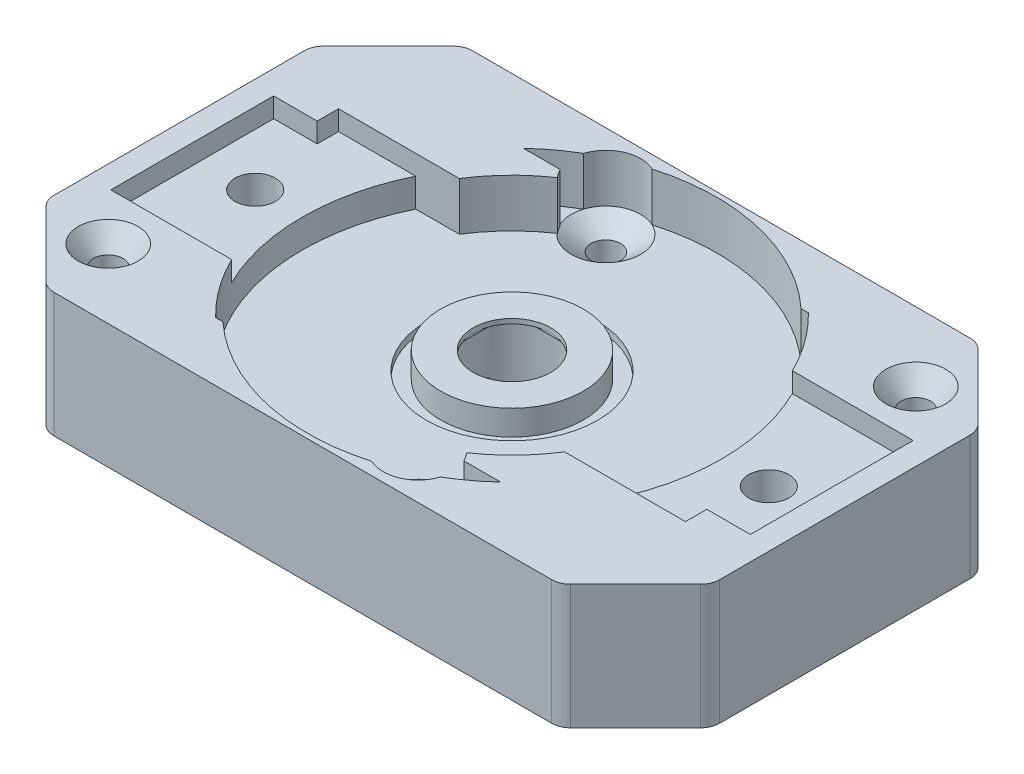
ISO-10303-21;
HEADER;
FILE_DESCRIPTION(('STEP AP214'),'2;1');
FILE_NAME('part.step','',(''),(''),'','','');
FILE_SCHEMA(('AUTOMOTIVE_DESIGN { 1 0 10303 214 1 1 1 1 }'));
ENDSEC;
DATA;
#1=APPLICATION_CONTEXT('core data for automotive mechanical design processes');
#2=APPLICATION_PROTOCOL_DEFINITION('international standard','automotive_design',2000,#1);
#3=PRODUCT_CONTEXT('',#1,'mechanical');
#4=PRODUCT('Part','Part','',(#3));
#5=PRODUCT_RELATED_PRODUCT_CATEGORY('part','',(#4));
#6=PRODUCT_DEFINITION_FORMATION('','',#4);
#7=PRODUCT_DEFINITION_CONTEXT('part definition',#1,'design');
#8=PRODUCT_DEFINITION('design','',#6,#7);
#9=PRODUCT_DEFINITION_SHAPE('','',#8);
#10=(LENGTH_UNIT() NAMED_UNIT(*) SI_UNIT(.MILLI.,.METRE.));
#11=(NAMED_UNIT(*) PLANE_ANGLE_UNIT() SI_UNIT($,.RADIAN.));
#12=(NAMED_UNIT(*) SI_UNIT($,.STERADIAN.) SOLID_ANGLE_UNIT());
#13=UNCERTAINTY_MEASURE_WITH_UNIT(LENGTH_MEASURE(1.E-05),#10,'distance_accuracy_value','');
#14=(GEOMETRIC_REPRESENTATION_CONTEXT(3) GLOBAL_UNCERTAINTY_ASSIGNED_CONTEXT((#13)) GLOBAL_UNIT_ASSIGNED_CONTEXT((#10,
#11,#12)) REPRESENTATION_CONTEXT('',''));
#15=CARTESIAN_POINT('',(0.,0.,0.));
#16=DIRECTION('',(0.,0.,1.));
#17=DIRECTION('',(1.,0.,0.));
#18=AXIS2_PLACEMENT_3D('',#15,#16,#17);
#19=CARTESIAN_POINT('',(0.,0.,0.));
#20=DIRECTION('',(0.,1.,0.));
#21=DIRECTION('',(0.,0.,1.));
#22=AXIS2_PLACEMENT_3D('',#19,#20,#21);
#23=PLANE('',#22);
#24=DIRECTION('',(0.707106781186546,0.,0.707106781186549));
#25=VECTOR('',#24,1.);
#26=CARTESIAN_POINT('',(-10.066331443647,0.,10.0663314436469));
#27=LINE('',#26,#25);
#28=CARTESIAN_POINT('',(-22.5881038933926,0.,-2.45544100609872));
#29=VERTEX_POINT('',#28);
#30=CARTESIAN_POINT('',(-22.3234557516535,0.,-2.19079286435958));
#31=VERTEX_POINT('',#30);
#32=EDGE_CURVE('E1015',#29,#31,#27,.T.);
#33=ORIENTED_EDGE('',*,*,#32,.T.);
#34=DIRECTION('',(1.,0.,0.));
#35=VECTOR('',#34,1.);
#36=CARTESIAN_POINT('',(-2.26903546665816,0.,-2.19079286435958));
#37=LINE('',#36,#35);
#38=CARTESIAN_POINT('',(-22.5881038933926,0.,-2.19079286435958));
#39=VERTEX_POINT('',#38);
#40=EDGE_CURVE('E748',#39,#31,#37,.T.);
#41=ORIENTED_EDGE('',*,*,#40,.F.);
#42=DIRECTION('',(0.,0.,1.));
#43=VECTOR('',#42,1.);
#44=CARTESIAN_POINT('',(-22.5881038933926,0.,-7.8242602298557));
#45=LINE('',#44,#43);
#46=EDGE_CURVE('E814',#29,#39,#45,.T.);
#47=ORIENTED_EDGE('',*,*,#46,.F.);
#48=EDGE_LOOP('',(#33,#41,#47));
#49=FACE_BOUND('',#48,.T.);
#50=ADVANCED_FACE('F43',(#49),#23,.F.);
#51=CARTESIAN_POINT('',(0.,0.,0.));
#52=DIRECTION('',(0.,1.,0.));
#53=DIRECTION('',(0.,0.,1.));
#54=AXIS2_PLACEMENT_3D('',#51,#52,#53);
#55=CIRCLE('',#54,5.075);
#56=CARTESIAN_POINT('',(-0.078686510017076,0.,-5.07438995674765));
#57=VERTEX_POINT('',#56);
#58=CARTESIAN_POINT('',(-4.57777802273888,0.,-2.19079286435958));
#59=VERTEX_POINT('',#58);
#60=EDGE_CURVE('E1505',#57,#59,#55,.T.);
#61=ORIENTED_EDGE('',*,*,#60,.T.);
#62=CARTESIAN_POINT('',(-15.8719174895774,0.,-2.19079286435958));
#63=VERTEX_POINT('',#62);
#64=EDGE_CURVE('E767',#63,#59,#37,.T.);
#65=ORIENTED_EDGE('',*,*,#64,.F.);
#66=DIRECTION('',(-0.677900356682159,0.,-0.735153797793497));
#67=VECTOR('',#66,1.);
#68=CARTESIAN_POINT('',(-7.48618959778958,0.,6.90316858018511));
#69=LINE('',#68,#67);
#70=CARTESIAN_POINT('',(-16.1159549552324,0.,-2.45544100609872));
#71=VERTEX_POINT('',#70);
#72=EDGE_CURVE('E1036',#63,#71,#69,.T.);
#73=ORIENTED_EDGE('',*,*,#72,.T.);
#74=DIRECTION('',(1.,0.,0.));
#75=VECTOR('',#74,1.);
#76=CARTESIAN_POINT('',(0.,0.,-2.45544100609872));
#77=LINE('',#76,#75);
#78=CARTESIAN_POINT('',(-13.4430920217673,0.,-2.45544100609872));
#79=VERTEX_POINT('',#78);
#80=EDGE_CURVE('E1033',#71,#79,#77,.T.);
#81=ORIENTED_EDGE('',*,*,#80,.T.);
#82=DIRECTION('',(0.,0.,-1.));
#83=VECTOR('',#82,1.);
#84=CARTESIAN_POINT('',(-13.4430920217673,0.,0.));
#85=LINE('',#84,#83);
#86=CARTESIAN_POINT('',(-13.4430920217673,0.,-6.60327116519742));
#87=VERTEX_POINT('',#86);
#88=EDGE_CURVE('E895',#79,#87,#85,.T.);
#89=ORIENTED_EDGE('',*,*,#88,.T.);
#90=DIRECTION('',(1.,0.,0.));
#91=VECTOR('',#90,1.);
#92=CARTESIAN_POINT('',(0.,0.,-6.60327116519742));
#93=LINE('',#92,#91);
#94=CARTESIAN_POINT('',(1.14751053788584,0.,-6.60327116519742));
#95=VERTEX_POINT('',#94);
#96=EDGE_CURVE('E1064',#87,#95,#93,.T.);
#97=ORIENTED_EDGE('',*,*,#96,.T.);
#98=DIRECTION('',(0.677900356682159,0.,0.735153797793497));
#99=VECTOR('',#98,1.);
#100=CARTESIAN_POINT('',(3.91098630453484,0.,-3.60640048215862));
#101=LINE('',#100,#99);
#102=CARTESIAN_POINT('',(1.33906062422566,0.,-6.39554333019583));
#103=VERTEX_POINT('',#102);
#104=EDGE_CURVE('E1061',#95,#103,#101,.T.);
#105=ORIENTED_EDGE('',*,*,#104,.T.);
#106=DIRECTION('',(0.731589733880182,0.,-0.681745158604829));
#107=VECTOR('',#106,1.);
#108=CARTESIAN_POINT('',(-11.0117660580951,0.,5.11379845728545));
#109=LINE('',#108,#107);
#110=EDGE_CURVE('E827',#57,#103,#109,.T.);
#111=ORIENTED_EDGE('',*,*,#110,.F.);
#112=EDGE_LOOP('',(#61,#65,#73,#81,#89,#97,#105,#111));
#113=FACE_BOUND('',#112,.T.);
#114=ADVANCED_FACE('F1763',(#113),#23,.F.);
#115=CARTESIAN_POINT('',(-10.066331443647,1.,10.0663314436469));
#116=DIRECTION('',(0.707106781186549,0.,-0.707106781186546));
#117=DIRECTION('',(-0.707106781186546,0.,-0.707106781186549));
#118=AXIS2_PLACEMENT_3D('',#115,#116,#117);
#119=PLANE('',#118);
#120=DIRECTION('',(0.,1.,0.));
#121=VECTOR('',#120,1.);
#122=CARTESIAN_POINT('',(-22.3234557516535,1.,-2.19079286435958));
#123=LINE('',#122,#121);
#124=CARTESIAN_POINT('',(-22.3234557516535,1.,-2.19079286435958));
#125=VERTEX_POINT('',#124);
#126=EDGE_CURVE('E786',#31,#125,#123,.T.);
#127=ORIENTED_EDGE('',*,*,#126,.F.);
#128=ORIENTED_EDGE('',*,*,#32,.F.);
#129=DIRECTION('',(0.,-1.,0.));
#130=VECTOR('',#129,1.);
#131=CARTESIAN_POINT('',(-22.5881038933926,1.,-2.45544100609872));
#132=LINE('',#131,#130);
#133=CARTESIAN_POINT('',(-22.5881038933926,1.,-2.45544100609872));
#134=VERTEX_POINT('',#133);
#135=EDGE_CURVE('E1106',#134,#29,#132,.T.);
#136=ORIENTED_EDGE('',*,*,#135,.F.);
#137=DIRECTION('',(0.707106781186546,0.,0.707106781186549));
#138=VECTOR('',#137,1.);
#139=CARTESIAN_POINT('',(-10.066331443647,1.,10.0663314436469));
#140=LINE('',#139,#138);
#141=EDGE_CURVE('E926',#134,#125,#140,.T.);
#142=ORIENTED_EDGE('',*,*,#141,.T.);
#143=EDGE_LOOP('',(#127,#128,#136,#142));
#144=FACE_BOUND('',#143,.T.);
#145=ADVANCED_FACE('F1769',(#144),#119,.T.);
#146=CARTESIAN_POINT('',(-7.48618959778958,1.,6.90316858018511));
#147=DIRECTION('',(-0.735153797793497,0.,0.677900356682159));
#148=DIRECTION('',(0.677900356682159,0.,0.735153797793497));
#149=AXIS2_PLACEMENT_3D('',#146,#147,#148);
#150=PLANE('',#149);
#151=DIRECTION('',(0.,-1.,0.));
#152=VECTOR('',#151,1.);
#153=CARTESIAN_POINT('',(-15.8719174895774,1.,-2.19079286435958));
#154=LINE('',#153,#152);
#155=CARTESIAN_POINT('',(-15.8719174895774,1.,-2.19079286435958));
#156=VERTEX_POINT('',#155);
#157=EDGE_CURVE('E784',#156,#63,#154,.T.);
#158=ORIENTED_EDGE('',*,*,#157,.F.);
#159=DIRECTION('',(-0.677900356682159,0.,-0.735153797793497));
#160=VECTOR('',#159,1.);
#161=CARTESIAN_POINT('',(-7.48618959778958,1.,6.90316858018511));
#162=LINE('',#161,#160);
#163=CARTESIAN_POINT('',(-16.1159549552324,1.,-2.45544100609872));
#164=VERTEX_POINT('',#163);
#165=EDGE_CURVE('E947',#156,#164,#162,.T.);
#166=ORIENTED_EDGE('',*,*,#165,.T.);
#167=DIRECTION('',(0.,-1.,0.));
#168=VECTOR('',#167,1.);
#169=CARTESIAN_POINT('',(-16.1159549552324,1.,-2.45544100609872));
#170=LINE('',#169,#168);
#171=EDGE_CURVE('E1093',#164,#71,#170,.T.);
#172=ORIENTED_EDGE('',*,*,#171,.T.);
#173=ORIENTED_EDGE('',*,*,#72,.F.);
#174=EDGE_LOOP('',(#158,#166,#172,#173));
#175=FACE_BOUND('',#174,.T.);
#176=ADVANCED_FACE('F1791',(#175),#150,.T.);
#177=CARTESIAN_POINT('',(-22.5881038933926,30.0219442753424,-7.8242602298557));
#178=DIRECTION('',(1.,0.,0.));
#179=DIRECTION('',(0.,0.,-1.));
#180=AXIS2_PLACEMENT_3D('',#177,#178,#179);
#181=PLANE('',#180);
#182=ORIENTED_EDGE('',*,*,#46,.T.);
#183=DIRECTION('',(0.,1.,0.));
#184=VECTOR('',#183,1.);
#185=CARTESIAN_POINT('',(-22.5881038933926,30.0219442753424,-2.19079286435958));
#186=LINE('',#185,#184);
#187=CARTESIAN_POINT('',(-22.5881038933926,1.,-2.19079286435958));
#188=VERTEX_POINT('',#187);
#189=EDGE_CURVE('E52',#39,#188,#186,.T.);
#190=ORIENTED_EDGE('',*,*,#189,.T.);
#191=DIRECTION('',(0.,0.,-1.));
#192=VECTOR('',#191,1.);
#193=CARTESIAN_POINT('',(-22.5881038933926,1.,-7.8242602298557));
#194=LINE('',#193,#192);
#195=EDGE_CURVE('E795',#188,#134,#194,.T.);
#196=ORIENTED_EDGE('',*,*,#195,.T.);
#197=ORIENTED_EDGE('',*,*,#135,.T.);
#198=EDGE_LOOP('',(#182,#190,#196,#197));
#199=FACE_BOUND('',#198,.T.);
#200=ADVANCED_FACE('F2671',(#199),#181,.F.);
#201=CARTESIAN_POINT('',(-27.729631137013,0.,14.7296311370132));
#202=DIRECTION('',(0.,-1.,0.));
#203=DIRECTION('',(0.,0.,-1.));
#204=AXIS2_PLACEMENT_3D('',#201,#202,#203);
#205=CIRCLE('',#204,1.55);
#206=CARTESIAN_POINT('',(-27.729631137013,0.,13.1796311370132));
#207=VERTEX_POINT('',#206);
#208=EDGE_CURVE('E1282',#207,#207,#205,.T.);
#209=ORIENTED_EDGE('',*,*,#208,.F.);
#210=EDGE_LOOP('',(#209));
#211=FACE_BOUND('',#210,.T.);
#212=CARTESIAN_POINT('',(7.50000000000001,0.,17.3750000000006));
#213=DIRECTION('',(0.,-1.,0.));
#214=DIRECTION('',(0.,0.,-1.));
#215=AXIS2_PLACEMENT_3D('',#212,#213,#214);
#216=CIRCLE('',#215,1.55);
#217=CARTESIAN_POINT('',(7.50000000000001,0.,15.8250000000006));
#218=VERTEX_POINT('',#217);
#219=EDGE_CURVE('E1286',#218,#218,#216,.T.);
#220=ORIENTED_EDGE('',*,*,#219,.F.);
#221=EDGE_LOOP('',(#220));
#222=FACE_BOUND('',#221,.T.);
#223=CARTESIAN_POINT('',(27.7296311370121,0.,-14.7296311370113));
#224=DIRECTION('',(0.,-1.,0.));
#225=DIRECTION('',(0.,0.,-1.));
#226=AXIS2_PLACEMENT_3D('',#223,#224,#225);
#227=CIRCLE('',#226,1.55);
#228=CARTESIAN_POINT('',(27.7296311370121,0.,-16.2796311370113));
#229=VERTEX_POINT('',#228);
#230=EDGE_CURVE('E1289',#229,#229,#227,.T.);
#231=ORIENTED_EDGE('',*,*,#230,.F.);
#232=EDGE_LOOP('',(#231));
#233=FACE_BOUND('',#232,.T.);
#234=CARTESIAN_POINT('',(-7.50000000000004,0.,-17.3749999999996));
#235=DIRECTION('',(0.,-1.,0.));
#236=DIRECTION('',(0.,0.,-1.));
#237=AXIS2_PLACEMENT_3D('',#234,#235,#236);
#238=CIRCLE('',#237,1.55);
#239=CARTESIAN_POINT('',(-7.50000000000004,0.,-18.9249999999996));
#240=VERTEX_POINT('',#239);
#241=EDGE_CURVE('E1281',#240,#240,#238,.T.);
#242=ORIENTED_EDGE('',*,*,#241,.F.);
#243=EDGE_LOOP('',(#242));
#244=FACE_BOUND('',#243,.T.);
#245=DIRECTION('',(1.,0.,0.));
#246=VECTOR('',#245,1.);
#247=CARTESIAN_POINT('',(0.,0.,22.));
#248=LINE('',#247,#246);
#249=CARTESIAN_POINT('',(-26.1715728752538,0.,22.));
#250=VERTEX_POINT('',#249);
#251=CARTESIAN_POINT('',(26.1715728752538,0.,22.));
#252=VERTEX_POINT('',#251);
#253=EDGE_CURVE('E1506',#250,#252,#248,.T.);
#254=ORIENTED_EDGE('',*,*,#253,.F.);
#255=CARTESIAN_POINT('',(-26.1715728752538,0.,20.));
#256=DIRECTION('',(0.,1.,0.));
#257=DIRECTION('',(0.,0.,1.));
#258=AXIS2_PLACEMENT_3D('',#255,#256,#257);
#259=CIRCLE('',#258,1.99999999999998);
#260=CARTESIAN_POINT('',(-27.5857864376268,0.,21.4142135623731));
#261=VERTEX_POINT('',#260);
#262=EDGE_CURVE('E1537',#261,#250,#259,.T.);
#263=ORIENTED_EDGE('',*,*,#262,.F.);
#264=DIRECTION('',(0.707106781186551,0.,0.707106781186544));
#265=VECTOR('',#264,1.);
#266=CARTESIAN_POINT('',(-24.4999999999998,0.,24.5000000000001));
#267=LINE('',#266,#265);
#268=CARTESIAN_POINT('',(-34.4142135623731,0.,14.5857864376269));
#269=VERTEX_POINT('',#268);
#270=EDGE_CURVE('E1535',#269,#261,#267,.T.);
#271=ORIENTED_EDGE('',*,*,#270,.F.);
#272=CARTESIAN_POINT('',(-33.,0.,13.1715728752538));
#273=DIRECTION('',(0.,1.,0.));
#274=DIRECTION('',(0.,0.,1.));
#275=AXIS2_PLACEMENT_3D('',#272,#273,#274);
#276=CIRCLE('',#275,2.);
#277=CARTESIAN_POINT('',(-35.,0.,13.1715728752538));
#278=VERTEX_POINT('',#277);
#279=EDGE_CURVE('E1533',#278,#269,#276,.T.);
#280=ORIENTED_EDGE('',*,*,#279,.F.);
#281=DIRECTION('',(0.,0.,1.));
#282=VECTOR('',#281,1.);
#283=CARTESIAN_POINT('',(-35.,0.,0.));
#284=LINE('',#283,#282);
#285=CARTESIAN_POINT('',(-35.,0.,-13.1715728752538));
#286=VERTEX_POINT('',#285);
#287=EDGE_CURVE('E1531',#286,#278,#284,.T.);
#288=ORIENTED_EDGE('',*,*,#287,.F.);
#289=CARTESIAN_POINT('',(-33.,0.,-13.1715728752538));
#290=DIRECTION('',(0.,1.,0.));
#291=DIRECTION('',(0.,0.,1.));
#292=AXIS2_PLACEMENT_3D('',#289,#290,#291);
#293=CIRCLE('',#292,2.00000000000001);
#294=CARTESIAN_POINT('',(-34.4142135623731,0.,-14.5857864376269));
#295=VERTEX_POINT('',#294);
#296=EDGE_CURVE('E1529',#295,#286,#293,.T.);
#297=ORIENTED_EDGE('',*,*,#296,.F.);
#298=DIRECTION('',(-0.707106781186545,0.,0.70710678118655));
#299=VECTOR('',#298,1.);
#300=CARTESIAN_POINT('',(-24.5000000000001,0.,-24.4999999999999));
#301=LINE('',#300,#299);
#302=CARTESIAN_POINT('',(-27.5857864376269,0.,-21.4142135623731));
#303=VERTEX_POINT('',#302);
#304=EDGE_CURVE('E1527',#303,#295,#301,.T.);
#305=ORIENTED_EDGE('',*,*,#304,.F.);
#306=CARTESIAN_POINT('',(-26.1715728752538,0.,-20.));
#307=DIRECTION('',(0.,1.,0.));
#308=DIRECTION('',(0.,0.,1.));
#309=AXIS2_PLACEMENT_3D('',#306,#307,#308);
#310=CIRCLE('',#309,2.);
#311=CARTESIAN_POINT('',(-26.1715728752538,0.,-22.));
#312=VERTEX_POINT('',#311);
#313=EDGE_CURVE('E1525',#312,#303,#310,.T.);
#314=ORIENTED_EDGE('',*,*,#313,.F.);
#315=DIRECTION('',(-1.,0.,0.));
#316=VECTOR('',#315,1.);
#317=CARTESIAN_POINT('',(0.,0.,-22.));
#318=LINE('',#317,#316);
#319=CARTESIAN_POINT('',(26.1715728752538,0.,-22.));
#320=VERTEX_POINT('',#319);
#321=EDGE_CURVE('E1523',#320,#312,#318,.T.);
#322=ORIENTED_EDGE('',*,*,#321,.F.);
#323=CARTESIAN_POINT('',(26.1715728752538,0.,-20.));
#324=DIRECTION('',(0.,1.,0.));
#325=DIRECTION('',(0.,0.,1.));
#326=AXIS2_PLACEMENT_3D('',#323,#324,#325);
#327=CIRCLE('',#326,2.);
#328=CARTESIAN_POINT('',(27.5857864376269,0.,-21.4142135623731));
#329=VERTEX_POINT('',#328);
#330=EDGE_CURVE('E1521',#329,#320,#327,.T.);
#331=ORIENTED_EDGE('',*,*,#330,.F.);
#332=DIRECTION('',(-0.707106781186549,0.,-0.707106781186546));
#333=VECTOR('',#332,1.);
#334=CARTESIAN_POINT('',(24.5,0.,-24.5));
#335=LINE('',#334,#333);
#336=CARTESIAN_POINT('',(34.4142135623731,0.,-14.5857864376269));
#337=VERTEX_POINT('',#336);
#338=EDGE_CURVE('E1519',#337,#329,#335,.T.);
#339=ORIENTED_EDGE('',*,*,#338,.F.);
#340=CARTESIAN_POINT('',(33.,0.,-13.1715728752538));
#341=DIRECTION('',(0.,1.,0.));
#342=DIRECTION('',(0.,0.,1.));
#343=AXIS2_PLACEMENT_3D('',#340,#341,#342);
#344=CIRCLE('',#343,2.);
#345=CARTESIAN_POINT('',(35.,0.,-13.1715728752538));
#346=VERTEX_POINT('',#345);
#347=EDGE_CURVE('E1517',#346,#337,#344,.T.);
#348=ORIENTED_EDGE('',*,*,#347,.F.);
#349=DIRECTION('',(0.,0.,-1.));
#350=VECTOR('',#349,1.);
#351=CARTESIAN_POINT('',(35.,0.,0.));
#352=LINE('',#351,#350);
#353=CARTESIAN_POINT('',(35.,0.,13.1715728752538));
#354=VERTEX_POINT('',#353);
#355=EDGE_CURVE('E1515',#354,#346,#352,.T.);
#356=ORIENTED_EDGE('',*,*,#355,.F.);
#357=CARTESIAN_POINT('',(33.,0.,13.1715728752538));
#358=DIRECTION('',(0.,1.,0.));
#359=DIRECTION('',(0.,0.,1.));
#360=AXIS2_PLACEMENT_3D('',#357,#358,#359);
#361=CIRCLE('',#360,2.);
#362=CARTESIAN_POINT('',(34.4142135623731,0.,14.5857864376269));
#363=VERTEX_POINT('',#362);
#364=EDGE_CURVE('E1513',#363,#354,#361,.T.);
#365=ORIENTED_EDGE('',*,*,#364,.F.);
#366=DIRECTION('',(0.707106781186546,0.,-0.707106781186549));
#367=VECTOR('',#366,1.);
#368=CARTESIAN_POINT('',(24.5000000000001,0.,24.5));
#369=LINE('',#368,#367);
#370=CARTESIAN_POINT('',(27.5857864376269,0.,21.4142135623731));
#371=VERTEX_POINT('',#370);
#372=EDGE_CURVE('E1511',#371,#363,#369,.T.);
#373=ORIENTED_EDGE('',*,*,#372,.F.);
#374=CARTESIAN_POINT('',(26.1715728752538,0.,20.));
#375=DIRECTION('',(0.,1.,0.));
#376=DIRECTION('',(0.,0.,1.));
#377=AXIS2_PLACEMENT_3D('',#374,#375,#376);
#378=CIRCLE('',#377,2.);
#379=EDGE_CURVE('E1509',#252,#371,#378,.T.);
#380=ORIENTED_EDGE('',*,*,#379,.F.);
#381=EDGE_LOOP('',(#254,#263,#271,#280,#288,#297,#305,#314,#322,#331,#339,#348,#356,#365,#373,#380));
#382=FACE_BOUND('',#381,.T.);
#383=DIRECTION('',(0.,0.,1.));
#384=VECTOR('',#383,1.);
#385=CARTESIAN_POINT('',(-26.6185525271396,0.,0.));
#386=LINE('',#385,#384);
#387=CARTESIAN_POINT('',(-26.6185525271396,0.,-15.1917194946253));
#388=VERTEX_POINT('',#387);
#389=CARTESIAN_POINT('',(-26.6185525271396,0.,-7.8242602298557));
#390=VERTEX_POINT('',#389);
#391=EDGE_CURVE('E1018',#388,#390,#386,.T.);
#392=ORIENTED_EDGE('',*,*,#391,.T.);
#393=DIRECTION('',(1.,0.,0.));
#394=VECTOR('',#393,1.);
#395=CARTESIAN_POINT('',(-28.8715202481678,0.,-7.8242602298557));
#396=LINE('',#395,#394);
#397=CARTESIAN_POINT('',(-28.8715202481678,0.,-7.8242602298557));
#398=VERTEX_POINT('',#397);
#399=EDGE_CURVE('E817',#398,#390,#396,.T.);
#400=ORIENTED_EDGE('',*,*,#399,.F.);
#401=DIRECTION('',(0.,0.,-1.));
#402=VECTOR('',#401,1.);
#403=CARTESIAN_POINT('',(-28.8715202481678,0.,12.5970589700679));
#404=LINE('',#403,#402);
#405=CARTESIAN_POINT('',(-28.8715202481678,0.,12.5970589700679));
#406=VERTEX_POINT('',#405);
#407=EDGE_CURVE('E799',#406,#398,#404,.T.);
#408=ORIENTED_EDGE('',*,*,#407,.F.);
#409=DIRECTION('',(-1.,0.,0.));
#410=VECTOR('',#409,1.);
#411=CARTESIAN_POINT('',(-11.9711181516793,0.,12.5970589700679));
#412=LINE('',#411,#410);
#413=CARTESIAN_POINT('',(-13.9178282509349,0.,12.5970589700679));
#414=VERTEX_POINT('',#413);
#415=EDGE_CURVE('E808',#414,#406,#412,.T.);
#416=ORIENTED_EDGE('',*,*,#415,.F.);
#417=DIRECTION('',(0.707106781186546,0.,0.707106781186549));
#418=VECTOR('',#417,1.);
#419=CARTESIAN_POINT('',(-13.2574436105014,0.,13.2574436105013));
#420=LINE('',#419,#418);
#421=CARTESIAN_POINT('',(-8.09783438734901,0.,18.4170528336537));
#422=VERTEX_POINT('',#421);
#423=EDGE_CURVE('E1012',#414,#422,#420,.T.);
#424=ORIENTED_EDGE('',*,*,#423,.T.);
#425=DIRECTION('',(0.707106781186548,0.,-0.707106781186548));
#426=VECTOR('',#425,1.);
#427=CARTESIAN_POINT('',(5.15960922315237,0.,5.15960922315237));
#428=LINE('',#427,#426);
#429=CARTESIAN_POINT('',(-0.604425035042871,0.,10.9236434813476));
#430=VERTEX_POINT('',#429);
#431=EDGE_CURVE('E1009',#422,#430,#428,.T.);
#432=ORIENTED_EDGE('',*,*,#431,.T.);
#433=DIRECTION('',(1.,0.,0.));
#434=VECTOR('',#433,1.);
#435=CARTESIAN_POINT('',(0.,0.,10.9236434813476));
#436=LINE('',#435,#434);
#437=CARTESIAN_POINT('',(13.4500716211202,0.,10.9236434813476));
#438=VERTEX_POINT('',#437);
#439=EDGE_CURVE('E1006',#430,#438,#436,.T.);
#440=ORIENTED_EDGE('',*,*,#439,.T.);
#441=DIRECTION('',(0.,0.,1.));
#442=VECTOR('',#441,1.);
#443=CARTESIAN_POINT('',(13.4500716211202,0.,0.));
#444=LINE('',#443,#442);
#445=CARTESIAN_POINT('',(13.4500716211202,0.,14.9285415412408));
#446=VERTEX_POINT('',#445);
#447=EDGE_CURVE('E1003',#438,#446,#444,.T.);
#448=ORIENTED_EDGE('',*,*,#447,.T.);
#449=DIRECTION('',(1.,0.,0.));
#450=VECTOR('',#449,1.);
#451=CARTESIAN_POINT('',(0.,0.,14.9285415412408));
#452=LINE('',#451,#450);
#453=CARTESIAN_POINT('',(25.9644660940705,0.,14.9285415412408));
#454=VERTEX_POINT('',#453);
#455=EDGE_CURVE('E1000',#446,#454,#452,.T.);
#456=ORIENTED_EDGE('',*,*,#455,.T.);
#457=DIRECTION('',(0.,0.,-1.));
#458=VECTOR('',#457,1.);
#459=CARTESIAN_POINT('',(25.9644660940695,0.,-1.75424181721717E-12));
#460=LINE('',#459,#458);
#461=CARTESIAN_POINT('',(25.9644660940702,0.,10.5123424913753));
#462=VERTEX_POINT('',#461);
#463=EDGE_CURVE('E997',#454,#462,#460,.T.);
#464=ORIENTED_EDGE('',*,*,#463,.T.);
#465=DIRECTION('',(1.,0.,0.));
#466=VECTOR('',#465,1.);
#467=CARTESIAN_POINT('',(0.,0.,10.5123424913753));
#468=LINE('',#467,#466);
#469=CARTESIAN_POINT('',(32.1999999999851,0.,10.5123424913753));
#470=VERTEX_POINT('',#469);
#471=EDGE_CURVE('E994',#462,#470,#468,.T.);
#472=ORIENTED_EDGE('',*,*,#471,.T.);
#473=DIRECTION('',(0.,0.,-1.));
#474=VECTOR('',#473,1.);
#475=CARTESIAN_POINT('',(32.1999999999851,0.,0.));
#476=LINE('',#475,#474);
#477=CARTESIAN_POINT('',(32.1999999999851,0.,6.48401288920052));
#478=VERTEX_POINT('',#477);
#479=EDGE_CURVE('E991',#470,#478,#476,.T.);
#480=ORIENTED_EDGE('',*,*,#479,.T.);
#481=DIRECTION('',(1.,0.,0.));
#482=VECTOR('',#481,1.);
#483=CARTESIAN_POINT('',(0.,0.,6.48401288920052));
#484=LINE('',#483,#482);
#485=CARTESIAN_POINT('',(28.6367924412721,0.,6.48401288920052));
#486=VERTEX_POINT('',#485);
#487=EDGE_CURVE('E989',#486,#478,#484,.T.);
#488=ORIENTED_EDGE('',*,*,#487,.F.);
#489=DIRECTION('',(0.,0.,1.));
#490=VECTOR('',#489,1.);
#491=CARTESIAN_POINT('',(28.6367924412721,0.,-12.910029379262));
#492=LINE('',#491,#490);
#493=CARTESIAN_POINT('',(28.6367924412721,0.,-12.910029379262));
#494=VERTEX_POINT('',#493);
#495=EDGE_CURVE('E844',#494,#486,#492,.T.);
#496=ORIENTED_EDGE('',*,*,#495,.F.);
#497=DIRECTION('',(1.,0.,0.));
#498=VECTOR('',#497,1.);
#499=CARTESIAN_POINT('',(8.3300821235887,0.,-12.910029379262));
#500=LINE('',#499,#498);
#501=CARTESIAN_POINT('',(13.5878744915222,0.,-12.910029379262));
#502=VERTEX_POINT('',#501);
#503=EDGE_CURVE('E819',#502,#494,#500,.T.);
#504=ORIENTED_EDGE('',*,*,#503,.F.);
#505=DIRECTION('',(0.707106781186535,0.,0.70710678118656));
#506=VECTOR('',#505,1.);
#507=CARTESIAN_POINT('',(13.2489519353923,0.,-13.2489519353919));
#508=LINE('',#507,#506);
#509=CARTESIAN_POINT('',(7.29790387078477,0.,-19.1999999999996));
#510=VERTEX_POINT('',#509);
#511=EDGE_CURVE('E978',#510,#502,#508,.T.);
#512=ORIENTED_EDGE('',*,*,#511,.F.);
#513=DIRECTION('',(-1.,0.,0.));
#514=VECTOR('',#513,1.);
#515=CARTESIAN_POINT('',(0.,0.,-19.1999999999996));
#516=LINE('',#515,#514);
#517=CARTESIAN_POINT('',(5.61082461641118,0.,-19.1999999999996));
#518=VERTEX_POINT('',#517);
#519=EDGE_CURVE('E975',#510,#518,#516,.T.);
#520=ORIENTED_EDGE('',*,*,#519,.T.);
#521=DIRECTION('',(0.707106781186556,0.,-0.707106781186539));
#522=VECTOR('',#521,1.);
#523=CARTESIAN_POINT('',(-6.79458769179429,0.,-6.79458769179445));
#524=LINE('',#523,#522);
#525=CARTESIAN_POINT('',(-2.8350425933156,0.,-10.754132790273));
#526=VERTEX_POINT('',#525);
#527=EDGE_CURVE('E1030',#526,#518,#524,.T.);
#528=ORIENTED_EDGE('',*,*,#527,.F.);
#529=DIRECTION('',(1.,0.,0.));
#530=VECTOR('',#529,1.);
#531=CARTESIAN_POINT('',(0.,0.,-10.754132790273));
#532=LINE('',#531,#530);
#533=CARTESIAN_POINT('',(-13.4430920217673,0.,-10.754132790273));
#534=VERTEX_POINT('',#533);
#535=EDGE_CURVE('E1027',#534,#526,#532,.T.);
#536=ORIENTED_EDGE('',*,*,#535,.F.);
#537=DIRECTION('',(0.,0.,1.));
#538=VECTOR('',#537,1.);
#539=CARTESIAN_POINT('',(-13.4430920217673,0.,0.));
#540=LINE('',#539,#538);
#541=CARTESIAN_POINT('',(-13.4430920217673,0.,-15.1917194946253));
#542=VERTEX_POINT('',#541);
#543=EDGE_CURVE('E1024',#542,#534,#540,.T.);
#544=ORIENTED_EDGE('',*,*,#543,.F.);
#545=DIRECTION('',(1.,0.,0.));
#546=VECTOR('',#545,1.);
#547=CARTESIAN_POINT('',(0.,0.,-15.1917194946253));
#548=LINE('',#547,#546);
#549=EDGE_CURVE('E1021',#388,#542,#548,.T.);
#550=ORIENTED_EDGE('',*,*,#549,.F.);
#551=EDGE_LOOP('',(#392,#400,#408,#416,#424,#432,#440,#448,#456,#464,#472,#480,#488,#496,#504,
#512,#520,#528,#536,#544,#550));
#552=FACE_BOUND('',#551,.T.);
#553=ADVANCED_FACE('F1771',(#211,#222,#233,#244,#382,#552),#23,.F.);
#554=DIRECTION('',(-0.707106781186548,0.,0.707106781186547));
#555=VECTOR('',#554,1.);
#556=CARTESIAN_POINT('',(2.49481914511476,0.,2.49481914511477));
#557=LINE('',#556,#555);
#558=CARTESIAN_POINT('',(12.3444429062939,0.,-7.35480461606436));
#559=VERTEX_POINT('',#558);
#560=CARTESIAN_POINT('',(12.2680009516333,0.,-7.27836266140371));
#561=VERTEX_POINT('',#560);
#562=EDGE_CURVE('E981',#559,#561,#557,.T.);
#563=ORIENTED_EDGE('',*,*,#562,.F.);
#564=DIRECTION('',(-1.,0.,0.));
#565=VECTOR('',#564,1.);
#566=CARTESIAN_POINT('',(22.6903546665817,0.,-7.35480461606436));
#567=LINE('',#566,#565);
#568=CARTESIAN_POINT('',(22.6903546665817,0.,-7.35480461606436));
#569=VERTEX_POINT('',#568);
#570=EDGE_CURVE('E848',#569,#559,#567,.T.);
#571=ORIENTED_EDGE('',*,*,#570,.F.);
#572=DIRECTION('',(0.,0.,-1.));
#573=VECTOR('',#572,1.);
#574=CARTESIAN_POINT('',(22.6903546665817,0.,7.82426022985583));
#575=LINE('',#574,#573);
#576=CARTESIAN_POINT('',(22.6903546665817,0.,2.34344302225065));
#577=VERTEX_POINT('',#576);
#578=EDGE_CURVE('E846',#577,#569,#575,.T.);
#579=ORIENTED_EDGE('',*,*,#578,.F.);
#580=DIRECTION('',(1.,0.,0.));
#581=VECTOR('',#580,1.);
#582=CARTESIAN_POINT('',(0.,0.,2.34344302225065));
#583=LINE('',#582,#581);
#584=CARTESIAN_POINT('',(21.8898066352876,0.,2.34344302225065));
#585=VERTEX_POINT('',#584);
#586=EDGE_CURVE('E986',#585,#577,#583,.T.);
#587=ORIENTED_EDGE('',*,*,#586,.F.);
#588=DIRECTION('',(0.707106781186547,0.,0.707106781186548));
#589=VECTOR('',#588,1.);
#590=CARTESIAN_POINT('',(9.77318180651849,0.,-9.77318180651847));
#591=LINE('',#590,#589);
#592=EDGE_CURVE('E983',#561,#585,#591,.T.);
#593=ORIENTED_EDGE('',*,*,#592,.F.);
#594=EDGE_LOOP('',(#563,#571,#579,#587,#593));
#595=FACE_BOUND('',#594,.T.);
#596=ADVANCED_FACE('F2650',(#595),#23,.F.);
#597=DIRECTION('',(-0.677900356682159,0.,-0.735153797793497));
#598=VECTOR('',#597,1.);
#599=CARTESIAN_POINT('',(-4.00384096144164,0.,3.69202366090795));
#600=LINE('',#599,#598);
#601=CARTESIAN_POINT('',(-1.42929057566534,0.,6.48401288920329));
#602=VERTEX_POINT('',#601);
#603=CARTESIAN_POINT('',(-2.27786448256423,0.,5.56377096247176));
#604=VERTEX_POINT('',#603);
#605=EDGE_CURVE('E1042',#602,#604,#600,.T.);
#606=ORIENTED_EDGE('',*,*,#605,.T.);
#607=DIRECTION('',(-0.731589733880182,0.,0.681745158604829));
#608=VECTOR('',#607,1.);
#609=CARTESIAN_POINT('',(9.34421770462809,0.,-5.26647705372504));
#610=LINE('',#609,#608);
#611=CARTESIAN_POINT('',(-1.50753247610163,0.,4.84592311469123));
#612=VERTEX_POINT('',#611);
#613=EDGE_CURVE('E829',#612,#604,#610,.T.);
#614=ORIENTED_EDGE('',*,*,#613,.F.);
#615=CARTESIAN_POINT('',(4.94008476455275,0.,-1.16240591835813));
#616=VERTEX_POINT('',#615);
#617=EDGE_CURVE('E1480',#612,#616,#55,.T.);
#618=ORIENTED_EDGE('',*,*,#617,.T.);
#619=CARTESIAN_POINT('',(5.59869953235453,0.,-1.77614803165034));
#620=VERTEX_POINT('',#619);
#621=EDGE_CURVE('E831',#620,#616,#610,.T.);
#622=ORIENTED_EDGE('',*,*,#621,.F.);
#623=CARTESIAN_POINT('',(6.16674921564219,0.,-1.160122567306));
#624=VERTEX_POINT('',#623);
#625=EDGE_CURVE('E1060',#620,#624,#101,.T.);
#626=ORIENTED_EDGE('',*,*,#625,.T.);
#627=DIRECTION('',(0.735153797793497,0.,-0.677900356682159));
#628=VECTOR('',#627,1.);
#629=CARTESIAN_POINT('',(2.25576291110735,0.,2.44627791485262));
#630=LINE('',#629,#628);
#631=CARTESIAN_POINT('',(9.49246510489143,0.,-4.22683322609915));
#632=VERTEX_POINT('',#631);
#633=EDGE_CURVE('E1057',#624,#632,#630,.T.);
#634=ORIENTED_EDGE('',*,*,#633,.T.);
#635=DIRECTION('',(0.677900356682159,0.,0.735153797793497));
#636=VECTOR('',#635,1.);
#637=CARTESIAN_POINT('',(7.23670219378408,0.,-6.67311114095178));
#638=LINE('',#637,#636);
#639=CARTESIAN_POINT('',(14.7059385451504,0.,1.42695462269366));
#640=VERTEX_POINT('',#639);
#641=EDGE_CURVE('E1054',#632,#640,#638,.T.);
#642=ORIENTED_EDGE('',*,*,#641,.T.);
#643=DIRECTION('',(-1.,0.,0.));
#644=VECTOR('',#643,1.);
#645=CARTESIAN_POINT('',(0.,0.,1.42695462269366));
#646=LINE('',#645,#644);
#647=CARTESIAN_POINT('',(13.4500716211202,0.,1.42695462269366));
#648=VERTEX_POINT('',#647);
#649=EDGE_CURVE('E1051',#640,#648,#646,.T.);
#650=ORIENTED_EDGE('',*,*,#649,.T.);
#651=DIRECTION('',(0.,0.,1.));
#652=VECTOR('',#651,1.);
#653=CARTESIAN_POINT('',(13.4500716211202,0.,0.));
#654=LINE('',#653,#652);
#655=CARTESIAN_POINT('',(13.4500716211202,0.,6.48401288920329));
#656=VERTEX_POINT('',#655);
#657=EDGE_CURVE('E1048',#648,#656,#654,.T.);
#658=ORIENTED_EDGE('',*,*,#657,.T.);
#659=DIRECTION('',(-1.,0.,0.));
#660=VECTOR('',#659,1.);
#661=CARTESIAN_POINT('',(0.,0.,6.48401288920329));
#662=LINE('',#661,#660);
#663=EDGE_CURVE('E1045',#656,#602,#662,.T.);
#664=ORIENTED_EDGE('',*,*,#663,.T.);
#665=EDGE_LOOP('',(#606,#614,#618,#622,#626,#634,#642,#650,#658,#664));
#666=FACE_BOUND('',#665,.T.);
#667=ADVANCED_FACE('F2296',(#666),#23,.F.);
#668=CARTESIAN_POINT('',(3.91098630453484,1.,-3.60640048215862));
#669=DIRECTION('',(0.735153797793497,0.,-0.677900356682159));
#670=DIRECTION('',(-0.677900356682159,0.,-0.735153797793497));
#671=AXIS2_PLACEMENT_3D('',#668,#669,#670);
#672=PLANE('',#671);
#673=DIRECTION('',(0.,-1.,0.));
#674=VECTOR('',#673,1.);
#675=CARTESIAN_POINT('',(5.59869953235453,1.,-1.77614803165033));
#676=LINE('',#675,#674);
#677=CARTESIAN_POINT('',(5.59869953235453,1.,-1.77614803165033));
#678=VERTEX_POINT('',#677);
#679=EDGE_CURVE('E882',#678,#620,#676,.T.);
#680=ORIENTED_EDGE('',*,*,#679,.F.);
#681=DIRECTION('',(0.677900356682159,0.,0.735153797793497));
#682=VECTOR('',#681,1.);
#683=CARTESIAN_POINT('',(3.91098630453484,1.,-3.60640048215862));
#684=LINE('',#683,#682);
#685=CARTESIAN_POINT('',(6.16674921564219,1.,-1.160122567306));
#686=VERTEX_POINT('',#685);
#687=EDGE_CURVE('E966',#678,#686,#684,.T.);
#688=ORIENTED_EDGE('',*,*,#687,.T.);
#689=DIRECTION('',(0.,-1.,0.));
#690=VECTOR('',#689,1.);
#691=CARTESIAN_POINT('',(6.16674921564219,1.,-1.160122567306));
#692=LINE('',#691,#690);
#693=EDGE_CURVE('E1077',#686,#624,#692,.T.);
#694=ORIENTED_EDGE('',*,*,#693,.T.);
#695=ORIENTED_EDGE('',*,*,#625,.F.);
#696=EDGE_LOOP('',(#680,#688,#694,#695));
#697=FACE_BOUND('',#696,.T.);
#698=ADVANCED_FACE('F2346',(#697),#672,.T.);
#699=CARTESIAN_POINT('',(-4.00384096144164,1.,3.69202366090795));
#700=DIRECTION('',(-0.735153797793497,0.,0.677900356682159));
#701=DIRECTION('',(0.677900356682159,0.,0.735153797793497));
#702=AXIS2_PLACEMENT_3D('',#699,#700,#701);
#703=PLANE('',#702);
#704=DIRECTION('',(0.,1.,0.));
#705=VECTOR('',#704,1.);
#706=CARTESIAN_POINT('',(-2.27786448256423,1.,5.56377096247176));
#707=LINE('',#706,#705);
#708=CARTESIAN_POINT('',(-2.27786448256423,1.,5.56377096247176));
#709=VERTEX_POINT('',#708);
#710=EDGE_CURVE('E879',#604,#709,#707,.T.);
#711=ORIENTED_EDGE('',*,*,#710,.F.);
#712=ORIENTED_EDGE('',*,*,#605,.F.);
#713=DIRECTION('',(0.,-1.,0.));
#714=VECTOR('',#713,1.);
#715=CARTESIAN_POINT('',(-1.42929057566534,1.,6.48401288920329));
#716=LINE('',#715,#714);
#717=CARTESIAN_POINT('',(-1.42929057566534,1.,6.48401288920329));
#718=VERTEX_POINT('',#717);
#719=EDGE_CURVE('E1088',#718,#602,#716,.T.);
#720=ORIENTED_EDGE('',*,*,#719,.F.);
#721=DIRECTION('',(-0.677900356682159,0.,-0.735153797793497));
#722=VECTOR('',#721,1.);
#723=CARTESIAN_POINT('',(-4.00384096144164,1.,3.69202366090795));
#724=LINE('',#723,#722);
#725=EDGE_CURVE('E953',#718,#709,#724,.T.);
#726=ORIENTED_EDGE('',*,*,#725,.T.);
#727=EDGE_LOOP('',(#711,#712,#720,#726));
#728=FACE_BOUND('',#727,.T.);
#729=ADVANCED_FACE('F1675',(#728),#703,.T.);
#730=CARTESIAN_POINT('',(-22.5881038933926,0.,2.42552067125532));
#731=VERTEX_POINT('',#730);
#732=CARTESIAN_POINT('',(-22.5881038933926,0.,5.78995257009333));
#733=VERTEX_POINT('',#732);
#734=EDGE_CURVE('E813',#731,#733,#45,.T.);
#735=ORIENTED_EDGE('',*,*,#734,.F.);
#736=DIRECTION('',(-1.,0.,0.));
#737=VECTOR('',#736,1.);
#738=CARTESIAN_POINT('',(-2.26903546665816,0.,2.42552067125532));
#739=LINE('',#738,#737);
#740=CARTESIAN_POINT('',(-17.7071422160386,0.,2.42552067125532));
#741=VERTEX_POINT('',#740);
#742=EDGE_CURVE('E59',#741,#731,#739,.T.);
#743=ORIENTED_EDGE('',*,*,#742,.F.);
#744=CARTESIAN_POINT('',(-14.3427103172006,0.,5.78995257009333));
#745=VERTEX_POINT('',#744);
#746=EDGE_CURVE('E1014',#741,#745,#27,.T.);
#747=ORIENTED_EDGE('',*,*,#746,.T.);
#748=DIRECTION('',(1.,0.,0.));
#749=VECTOR('',#748,1.);
#750=CARTESIAN_POINT('',(-22.5881038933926,0.,5.78995257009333));
#751=LINE('',#750,#749);
#752=EDGE_CURVE('E810',#733,#745,#751,.T.);
#753=ORIENTED_EDGE('',*,*,#752,.F.);
#754=EDGE_LOOP('',(#735,#743,#747,#753));
#755=FACE_BOUND('',#754,.T.);
#756=ADVANCED_FACE('F1671',(#755),#23,.F.);
#757=CARTESIAN_POINT('',(-10.982348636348,0.,3.11173438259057));
#758=VERTEX_POINT('',#757);
#759=CARTESIAN_POINT('',(-11.6151203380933,0.,2.42552067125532));
#760=VERTEX_POINT('',#759);
#761=EDGE_CURVE('E1037',#758,#760,#69,.T.);
#762=ORIENTED_EDGE('',*,*,#761,.T.);
#763=CARTESIAN_POINT('',(-10.2381793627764,0.,2.42552067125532));
#764=VERTEX_POINT('',#763);
#765=EDGE_CURVE('E766',#764,#760,#739,.T.);
#766=ORIENTED_EDGE('',*,*,#765,.F.);
#767=DIRECTION('',(-0.735153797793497,0.,0.677900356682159));
#768=VECTOR('',#767,1.);
#769=CARTESIAN_POINT('',(-3.4961590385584,0.,-3.79143419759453));
#770=LINE('',#769,#768);
#771=EDGE_CURVE('E1040',#764,#758,#770,.T.);
#772=ORIENTED_EDGE('',*,*,#771,.T.);
#773=EDGE_LOOP('',(#762,#766,#772));
#774=FACE_BOUND('',#773,.T.);
#775=ADVANCED_FACE('F1674',(#774),#23,.F.);
#776=CARTESIAN_POINT('',(0.,8.,0.));
#777=DIRECTION('',(0.,-1.,0.));
#778=DIRECTION('',(0.,0.,-1.));
#779=AXIS2_PLACEMENT_3D('',#776,#777,#778);
#780=CYLINDRICAL_SURFACE('',#779,5.075);
#781=DIRECTION('',(0.,-1.,0.));
#782=VECTOR('',#781,1.);
#783=CARTESIAN_POINT('',(-4.57777802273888,8.,-2.19079286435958));
#784=LINE('',#783,#782);
#785=CARTESIAN_POINT('',(-4.57777802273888,4.,-2.19079286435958));
#786=VERTEX_POINT('',#785);
#787=EDGE_CURVE('E788',#59,#786,#784,.F.);
#788=ORIENTED_EDGE('',*,*,#787,.F.);
#789=ORIENTED_EDGE('',*,*,#60,.F.);
#790=DIRECTION('',(0.,-1.,0.));
#791=VECTOR('',#790,1.);
#792=CARTESIAN_POINT('',(-0.0786865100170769,8.,-5.07438995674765));
#793=LINE('',#792,#791);
#794=CARTESIAN_POINT('',(-0.078686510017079,1.,-5.07438995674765));
#795=VERTEX_POINT('',#794);
#796=EDGE_CURVE('E877',#795,#57,#793,.T.);
#797=ORIENTED_EDGE('',*,*,#796,.F.);
#798=CARTESIAN_POINT('',(0.,1.,0.));
#799=DIRECTION('',(0.,-1.,0.));
#800=DIRECTION('',(0.,0.,-1.));
#801=AXIS2_PLACEMENT_3D('',#798,#799,#800);
#802=CIRCLE('',#801,5.075);
#803=CARTESIAN_POINT('',(4.94008476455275,1.,-1.16240591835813));
#804=VERTEX_POINT('',#803);
#805=EDGE_CURVE('E888',#795,#804,#802,.T.);
#806=ORIENTED_EDGE('',*,*,#805,.T.);
#807=DIRECTION('',(0.,-1.,0.));
#808=VECTOR('',#807,1.);
#809=CARTESIAN_POINT('',(4.94008476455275,8.,-1.16240591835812));
#810=LINE('',#809,#808);
#811=EDGE_CURVE('E884',#616,#804,#810,.F.);
#812=ORIENTED_EDGE('',*,*,#811,.F.);
#813=ORIENTED_EDGE('',*,*,#617,.F.);
#814=DIRECTION('',(0.,-1.,0.));
#815=VECTOR('',#814,1.);
#816=CARTESIAN_POINT('',(-1.50753247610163,8.,4.84592311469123));
#817=LINE('',#816,#815);
#818=CARTESIAN_POINT('',(-1.50753247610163,1.,4.84592311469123));
#819=VERTEX_POINT('',#818);
#820=EDGE_CURVE('E886',#819,#612,#817,.T.);
#821=ORIENTED_EDGE('',*,*,#820,.F.);
#822=CARTESIAN_POINT('',(-4.45785536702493,1.,2.42552067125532));
#823=VERTEX_POINT('',#822);
#824=EDGE_CURVE('E891',#819,#823,#802,.T.);
#825=ORIENTED_EDGE('',*,*,#824,.T.);
#826=DIRECTION('',(0.,-1.,0.));
#827=VECTOR('',#826,1.);
#828=CARTESIAN_POINT('',(-4.45785536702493,8.,2.42552067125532));
#829=LINE('',#828,#827);
#830=CARTESIAN_POINT('',(-4.45785536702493,4.,2.42552067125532));
#831=VERTEX_POINT('',#830);
#832=EDGE_CURVE('E779',#831,#823,#829,.T.);
#833=ORIENTED_EDGE('',*,*,#832,.F.);
#834=CARTESIAN_POINT('',(0.,4.,0.));
#835=DIRECTION('',(0.,1.,0.));
#836=DIRECTION('',(0.,0.,1.));
#837=AXIS2_PLACEMENT_3D('',#834,#835,#836);
#838=CIRCLE('',#837,5.075);
#839=EDGE_CURVE('E11',#786,#831,#838,.T.);
#840=ORIENTED_EDGE('',*,*,#839,.F.);
#841=EDGE_LOOP('',(#788,#789,#797,#806,#812,#813,#821,#825,#833,#840));
#842=FACE_BOUND('',#841,.T.);
#843=CARTESIAN_POINT('',(0.,9.4,0.));
#844=DIRECTION('',(0.,1.,0.));
#845=DIRECTION('',(0.,0.,1.));
#846=AXIS2_PLACEMENT_3D('',#843,#844,#845);
#847=CIRCLE('',#846,5.07500000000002);
#848=CARTESIAN_POINT('',(-3.02489669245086,9.4,-4.075));
#849=VERTEX_POINT('',#848);
#850=CARTESIAN_POINT('',(-4.075,9.4,-3.02489669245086));
#851=VERTEX_POINT('',#850);
#852=EDGE_CURVE('E2026',#849,#851,#847,.T.);
#853=ORIENTED_EDGE('',*,*,#852,.T.);
#854=DIRECTION('',(0.,1.,0.));
#855=VECTOR('',#854,1.);
#856=CARTESIAN_POINT('',(-4.075,9.18,-3.02489669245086));
#857=LINE('',#856,#855);
#858=CARTESIAN_POINT('',(-4.07499999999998,9.18,-3.02489669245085));
#859=VERTEX_POINT('',#858);
#860=EDGE_CURVE('E1146',#859,#851,#857,.T.);
#861=ORIENTED_EDGE('',*,*,#860,.F.);
#862=CARTESIAN_POINT('',(0.,9.18,0.));
#863=DIRECTION('',(0.,-1.,0.));
#864=DIRECTION('',(0.,0.,-1.));
#865=AXIS2_PLACEMENT_3D('',#862,#863,#864);
#866=CIRCLE('',#865,5.07500000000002);
#867=CARTESIAN_POINT('',(-4.07499999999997,9.18,3.02489669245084));
#868=VERTEX_POINT('',#867);
#869=EDGE_CURVE('E1133',#868,#859,#866,.T.);
#870=ORIENTED_EDGE('',*,*,#869,.F.);
#871=DIRECTION('',(0.,1.,0.));
#872=VECTOR('',#871,1.);
#873=CARTESIAN_POINT('',(-4.075,9.18,3.02489669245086));
#874=LINE('',#873,#872);
#875=CARTESIAN_POINT('',(-4.075,9.4,3.02489669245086));
#876=VERTEX_POINT('',#875);
#877=EDGE_CURVE('E1140',#868,#876,#874,.T.);
#878=ORIENTED_EDGE('',*,*,#877,.T.);
#879=CARTESIAN_POINT('',(-3.02489669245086,9.4,4.075));
#880=VERTEX_POINT('',#879);
#881=EDGE_CURVE('E1196',#876,#880,#847,.T.);
#882=ORIENTED_EDGE('',*,*,#881,.T.);
#883=DIRECTION('',(0.,1.,0.));
#884=VECTOR('',#883,1.);
#885=CARTESIAN_POINT('',(-3.02489669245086,9.18,4.075));
#886=LINE('',#885,#884);
#887=CARTESIAN_POINT('',(-3.02489669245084,9.18,4.07499999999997));
#888=VERTEX_POINT('',#887);
#889=EDGE_CURVE('E1163',#888,#880,#886,.T.);
#890=ORIENTED_EDGE('',*,*,#889,.F.);
#891=CARTESIAN_POINT('',(0.,9.18,0.));
#892=DIRECTION('',(0.,-1.,0.));
#893=DIRECTION('',(0.,0.,-1.));
#894=AXIS2_PLACEMENT_3D('',#891,#892,#893);
#895=CIRCLE('',#894,5.07500000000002);
#896=CARTESIAN_POINT('',(3.02489669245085,9.18,4.07499999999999));
#897=VERTEX_POINT('',#896);
#898=EDGE_CURVE('E1150',#897,#888,#895,.T.);
#899=ORIENTED_EDGE('',*,*,#898,.F.);
#900=DIRECTION('',(0.,1.,0.));
#901=VECTOR('',#900,1.);
#902=CARTESIAN_POINT('',(3.02489669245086,9.18,4.075));
#903=LINE('',#902,#901);
#904=CARTESIAN_POINT('',(3.02489669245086,9.4,4.075));
#905=VERTEX_POINT('',#904);
#906=EDGE_CURVE('E1157',#897,#905,#903,.T.);
#907=ORIENTED_EDGE('',*,*,#906,.T.);
#908=CARTESIAN_POINT('',(4.075,9.4,3.02489669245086));
#909=VERTEX_POINT('',#908);
#910=EDGE_CURVE('E1201',#905,#909,#847,.T.);
#911=ORIENTED_EDGE('',*,*,#910,.T.);
#912=DIRECTION('',(0.,1.,0.));
#913=VECTOR('',#912,1.);
#914=CARTESIAN_POINT('',(4.075,9.18,3.02489669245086));
#915=LINE('',#914,#913);
#916=CARTESIAN_POINT('',(4.075,9.18,3.02489669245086));
#917=VERTEX_POINT('',#916);
#918=EDGE_CURVE('E1172',#917,#909,#915,.T.);
#919=ORIENTED_EDGE('',*,*,#918,.F.);
#920=CARTESIAN_POINT('',(0.,9.18,0.));
#921=DIRECTION('',(0.,-1.,0.));
#922=DIRECTION('',(0.,0.,-1.));
#923=AXIS2_PLACEMENT_3D('',#920,#921,#922);
#924=CIRCLE('',#923,5.07500000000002);
#925=CARTESIAN_POINT('',(4.075,9.18,-3.02489669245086));
#926=VERTEX_POINT('',#925);
#927=EDGE_CURVE('E1169',#926,#917,#924,.T.);
#928=ORIENTED_EDGE('',*,*,#927,.F.);
#929=DIRECTION('',(0.,1.,0.));
#930=VECTOR('',#929,1.);
#931=CARTESIAN_POINT('',(4.075,9.18,-3.02489669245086));
#932=LINE('',#931,#930);
#933=CARTESIAN_POINT('',(4.075,9.4,-3.02489669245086));
#934=VERTEX_POINT('',#933);
#935=EDGE_CURVE('E1177',#926,#934,#932,.T.);
#936=ORIENTED_EDGE('',*,*,#935,.T.);
#937=CARTESIAN_POINT('',(3.02489669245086,9.4,-4.075));
#938=VERTEX_POINT('',#937);
#939=EDGE_CURVE('E1205',#934,#938,#847,.T.);
#940=ORIENTED_EDGE('',*,*,#939,.T.);
#941=DIRECTION('',(0.,1.,0.));
#942=VECTOR('',#941,1.);
#943=CARTESIAN_POINT('',(3.02489669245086,9.18,-4.075));
#944=LINE('',#943,#942);
#945=CARTESIAN_POINT('',(3.02489669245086,9.18,-4.075));
#946=VERTEX_POINT('',#945);
#947=EDGE_CURVE('E1186',#946,#938,#944,.T.);
#948=ORIENTED_EDGE('',*,*,#947,.F.);
#949=CARTESIAN_POINT('',(0.,9.18,0.));
#950=DIRECTION('',(0.,-1.,0.));
#951=DIRECTION('',(0.,0.,-1.));
#952=AXIS2_PLACEMENT_3D('',#949,#950,#951);
#953=CIRCLE('',#952,5.07500000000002);
#954=CARTESIAN_POINT('',(-3.02489669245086,9.18,-4.075));
#955=VERTEX_POINT('',#954);
#956=EDGE_CURVE('E1183',#955,#946,#953,.T.);
#957=ORIENTED_EDGE('',*,*,#956,.F.);
#958=DIRECTION('',(0.,1.,0.));
#959=VECTOR('',#958,1.);
#960=CARTESIAN_POINT('',(-3.02489669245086,9.18,-4.075));
#961=LINE('',#960,#959);
#962=EDGE_CURVE('E1190',#955,#849,#961,.T.);
#963=ORIENTED_EDGE('',*,*,#962,.T.);
#964=EDGE_LOOP('',(#853,#861,#870,#878,#882,#890,#899,#907,#911,#919,#928,#936,#940,#948,#957,#963));
#965=FACE_BOUND('',#964,.T.);
#966=ADVANCED_FACE('F1739',(#842,#965),#780,.F.);
#967=CARTESIAN_POINT('',(0.,9.4,0.));
#968=DIRECTION('',(0.,1.,0.));
#969=DIRECTION('',(0.,0.,1.));
#970=AXIS2_PLACEMENT_3D('',#967,#968,#969);
#971=PLANE('',#970);
#972=DIRECTION('',(0.,0.,1.));
#973=VECTOR('',#972,1.);
#974=CARTESIAN_POINT('',(-4.075,9.4,0.));
#975=LINE('',#974,#973);
#976=CARTESIAN_POINT('',(-4.075,9.4,0.));
#977=VERTEX_POINT('',#976);
#978=EDGE_CURVE('E1137',#851,#977,#975,.T.);
#979=ORIENTED_EDGE('',*,*,#978,.F.);
#980=ORIENTED_EDGE('',*,*,#852,.F.);
#981=DIRECTION('',(1.,0.,0.));
#982=VECTOR('',#981,1.);
#983=CARTESIAN_POINT('',(0.,9.4,-4.075));
#984=LINE('',#983,#982);
#985=CARTESIAN_POINT('',(0.,9.4,-4.075));
#986=VERTEX_POINT('',#985);
#987=EDGE_CURVE('E1184',#849,#986,#984,.T.);
#988=ORIENTED_EDGE('',*,*,#987,.T.);
#989=CARTESIAN_POINT('',(0.,9.4,0.));
#990=DIRECTION('',(0.,1.,0.));
#991=DIRECTION('',(0.,0.,1.));
#992=AXIS2_PLACEMENT_3D('',#989,#990,#991);
#993=CIRCLE('',#992,4.075);
#994=EDGE_CURVE('E2028',#986,#977,#993,.T.);
#995=ORIENTED_EDGE('',*,*,#994,.T.);
#996=EDGE_LOOP('',(#979,#980,#988,#995));
#997=FACE_BOUND('',#996,.T.);
#998=ADVANCED_FACE('F1741',(#997),#971,.F.);
#999=EDGE_CURVE('E1143',#977,#876,#975,.T.);
#1000=ORIENTED_EDGE('',*,*,#999,.F.);
#1001=CARTESIAN_POINT('',(0.,9.4,4.075));
#1002=VERTEX_POINT('',#1001);
#1003=EDGE_CURVE('E1198',#977,#1002,#993,.T.);
#1004=ORIENTED_EDGE('',*,*,#1003,.T.);
#1005=DIRECTION('',(1.,0.,0.));
#1006=VECTOR('',#1005,1.);
#1007=CARTESIAN_POINT('',(0.,9.4,4.075));
#1008=LINE('',#1007,#1006);
#1009=EDGE_CURVE('E1154',#880,#1002,#1008,.T.);
#1010=ORIENTED_EDGE('',*,*,#1009,.F.);
#1011=ORIENTED_EDGE('',*,*,#881,.F.);
#1012=EDGE_LOOP('',(#1000,#1004,#1010,#1011));
#1013=FACE_BOUND('',#1012,.T.);
#1014=ADVANCED_FACE('F2011',(#1013),#971,.F.);
#1015=EDGE_CURVE('E1160',#1002,#905,#1008,.T.);
#1016=ORIENTED_EDGE('',*,*,#1015,.F.);
#1017=CARTESIAN_POINT('',(4.075,9.4,0.));
#1018=VERTEX_POINT('',#1017);
#1019=EDGE_CURVE('E1193',#1002,#1018,#993,.T.);
#1020=ORIENTED_EDGE('',*,*,#1019,.T.);
#1021=DIRECTION('',(0.,0.,1.));
#1022=VECTOR('',#1021,1.);
#1023=CARTESIAN_POINT('',(4.075,9.4,0.));
#1024=LINE('',#1023,#1022);
#1025=EDGE_CURVE('E1175',#1018,#909,#1024,.T.);
#1026=ORIENTED_EDGE('',*,*,#1025,.T.);
#1027=ORIENTED_EDGE('',*,*,#910,.F.);
#1028=EDGE_LOOP('',(#1016,#1020,#1026,#1027));
#1029=FACE_BOUND('',#1028,.T.);
#1030=ADVANCED_FACE('F2004',(#1029),#971,.F.);
#1031=ORIENTED_EDGE('',*,*,#939,.F.);
#1032=EDGE_CURVE('E1170',#934,#1018,#1024,.T.);
#1033=ORIENTED_EDGE('',*,*,#1032,.T.);
#1034=EDGE_CURVE('E1197',#1018,#986,#993,.T.);
#1035=ORIENTED_EDGE('',*,*,#1034,.T.);
#1036=EDGE_CURVE('E1072',#986,#938,#984,.T.);
#1037=ORIENTED_EDGE('',*,*,#1036,.T.);
#1038=EDGE_LOOP('',(#1031,#1033,#1035,#1037));
#1039=FACE_BOUND('',#1038,.T.);
#1040=ADVANCED_FACE('F1999',(#1039),#971,.F.);
#1041=CARTESIAN_POINT('',(0.,8.,0.));
#1042=DIRECTION('',(0.,1.,0.));
#1043=DIRECTION('',(0.,0.,1.));
#1044=AXIS2_PLACEMENT_3D('',#1041,#1042,#1043);
#1045=PLANE('',#1044);
#1046=CARTESIAN_POINT('',(0.,8.,0.));
#1047=DIRECTION('',(0.,1.,0.));
#1048=DIRECTION('',(0.,0.,1.));
#1049=AXIS2_PLACEMENT_3D('',#1046,#1047,#1048);
#1050=CIRCLE('',#1049,21.5121050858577);
#1051=CARTESIAN_POINT('',(10.9708963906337,8.,18.5043264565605));
#1052=VERTEX_POINT('',#1051);
#1053=CARTESIAN_POINT('',(14.6000775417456,8.,15.799));
#1054=VERTEX_POINT('',#1053);
#1055=EDGE_CURVE('E1209',#1052,#1054,#1050,.T.);
#1056=ORIENTED_EDGE('',*,*,#1055,.T.);
#1057=DIRECTION('',(1.,0.,0.));
#1058=VECTOR('',#1057,1.);
#1059=CARTESIAN_POINT('',(0.,8.,15.799));
#1060=LINE('',#1059,#1058);
#1061=CARTESIAN_POINT('',(10.7922217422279,8.,15.799));
#1062=VERTEX_POINT('',#1061);
#1063=EDGE_CURVE('E1315',#1062,#1054,#1060,.T.);
#1064=ORIENTED_EDGE('',*,*,#1063,.F.);
#1065=CARTESIAN_POINT('',(7.50000000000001,8.,17.3750000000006));
#1066=DIRECTION('',(0.,1.,0.));
#1067=DIRECTION('',(0.,0.,1.));
#1068=AXIS2_PLACEMENT_3D('',#1065,#1066,#1067);
#1069=CIRCLE('',#1068,3.65000000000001);
#1070=EDGE_CURVE('E1597',#1062,#1052,#1069,.F.);
#1071=ORIENTED_EDGE('',*,*,#1070,.T.);
#1072=EDGE_LOOP('',(#1056,#1064,#1071));
#1073=FACE_BOUND('',#1072,.T.);
#1074=ADVANCED_FACE('F1670',(#1073),#1045,.T.);
#1075=CARTESIAN_POINT('',(-14.6000775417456,8.,15.799));
#1076=VERTEX_POINT('',#1075);
#1077=CARTESIAN_POINT('',(5.9412199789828,8.,20.6754097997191));
#1078=VERTEX_POINT('',#1077);
#1079=EDGE_CURVE('E1208',#1076,#1078,#1050,.T.);
#1080=ORIENTED_EDGE('',*,*,#1079,.T.);
#1081=CARTESIAN_POINT('',(10.1747421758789,8.,14.8914029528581));
#1082=VERTEX_POINT('',#1081);
#1083=EDGE_CURVE('E1596',#1078,#1082,#1069,.F.);
#1084=ORIENTED_EDGE('',*,*,#1083,.T.);
#1085=CARTESIAN_POINT('',(0.,8.,0.));
#1086=DIRECTION('',(0.,1.,0.));
#1087=DIRECTION('',(0.,0.,1.));
#1088=AXIS2_PLACEMENT_3D('',#1085,#1086,#1087);
#1089=CIRCLE('',#1088,18.0355);
#1090=CARTESIAN_POINT('',(15.2189216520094,8.,9.678));
#1091=VERTEX_POINT('',#1090);
#1092=EDGE_CURVE('E1363',#1082,#1091,#1089,.T.);
#1093=ORIENTED_EDGE('',*,*,#1092,.T.);
#1094=DIRECTION('',(1.,0.,0.));
#1095=VECTOR('',#1094,1.);
#1096=CARTESIAN_POINT('',(0.,8.,9.678));
#1097=LINE('',#1096,#1095);
#1098=CARTESIAN_POINT('',(19.8009059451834,8.,9.678));
#1099=VERTEX_POINT('',#1098);
#1100=EDGE_CURVE('E1360',#1091,#1099,#1097,.T.);
#1101=ORIENTED_EDGE('',*,*,#1100,.T.);
#1102=CARTESIAN_POINT('',(0.,8.,0.));
#1103=DIRECTION('',(0.,1.,0.));
#1104=DIRECTION('',(0.,0.,1.));
#1105=AXIS2_PLACEMENT_3D('',#1102,#1103,#1104);
#1106=CIRCLE('',#1105,22.0395);
#1107=CARTESIAN_POINT('',(15.3665597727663,8.,-15.799));
#1108=VERTEX_POINT('',#1107);
#1109=EDGE_CURVE('E1386',#1108,#1099,#1106,.F.);
#1110=ORIENTED_EDGE('',*,*,#1109,.F.);
#1111=DIRECTION('',(-1.,0.,0.));
#1112=VECTOR('',#1111,1.);
#1113=CARTESIAN_POINT('',(0.,8.,-15.799));
#1114=LINE('',#1113,#1112);
#1115=CARTESIAN_POINT('',(14.6000775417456,8.,-15.799));
#1116=VERTEX_POINT('',#1115);
#1117=EDGE_CURVE('E1243',#1108,#1116,#1114,.T.);
#1118=ORIENTED_EDGE('',*,*,#1117,.T.);
#1119=CARTESIAN_POINT('',(0.,8.,0.));
#1120=DIRECTION('',(0.,1.,0.));
#1121=DIRECTION('',(0.,0.,1.));
#1122=AXIS2_PLACEMENT_3D('',#1119,#1120,#1121);
#1123=CIRCLE('',#1122,21.5121050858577);
#1124=CARTESIAN_POINT('',(-5.94121997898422,8.,-20.6754097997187));
#1125=VERTEX_POINT('',#1124);
#1126=EDGE_CURVE('E1241',#1116,#1125,#1123,.T.);
#1127=ORIENTED_EDGE('',*,*,#1126,.T.);
#1128=CARTESIAN_POINT('',(-7.50000000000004,8.,-17.3749999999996));
#1129=DIRECTION('',(0.,1.,0.));
#1130=DIRECTION('',(0.,0.,1.));
#1131=AXIS2_PLACEMENT_3D('',#1128,#1129,#1130);
#1132=CIRCLE('',#1131,3.65000000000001);
#1133=CARTESIAN_POINT('',(-10.1747421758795,8.,-14.8914029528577));
#1134=VERTEX_POINT('',#1133);
#1135=EDGE_CURVE('E1600',#1125,#1134,#1132,.F.);
#1136=ORIENTED_EDGE('',*,*,#1135,.T.);
#1137=CARTESIAN_POINT('',(0.,8.,0.));
#1138=DIRECTION('',(0.,1.,0.));
#1139=DIRECTION('',(0.,0.,1.));
#1140=AXIS2_PLACEMENT_3D('',#1137,#1138,#1139);
#1141=CIRCLE('',#1140,18.0355);
#1142=CARTESIAN_POINT('',(-15.2189216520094,8.,-9.678));
#1143=VERTEX_POINT('',#1142);
#1144=EDGE_CURVE('E1311',#1134,#1143,#1141,.T.);
#1145=ORIENTED_EDGE('',*,*,#1144,.T.);
#1146=DIRECTION('',(1.,0.,0.));
#1147=VECTOR('',#1146,1.);
#1148=CARTESIAN_POINT('',(0.,8.,-9.67800000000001));
#1149=LINE('',#1148,#1147);
#1150=CARTESIAN_POINT('',(-19.8009059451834,8.,-9.678));
#1151=VERTEX_POINT('',#1150);
#1152=EDGE_CURVE('E1390',#1151,#1143,#1149,.T.);
#1153=ORIENTED_EDGE('',*,*,#1152,.F.);
#1154=CARTESIAN_POINT('',(0.,8.,0.));
#1155=DIRECTION('',(0.,1.,0.));
#1156=DIRECTION('',(0.,0.,1.));
#1157=AXIS2_PLACEMENT_3D('',#1154,#1155,#1156);
#1158=CIRCLE('',#1157,22.0395);
#1159=CARTESIAN_POINT('',(-15.3665597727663,8.,15.799));
#1160=VERTEX_POINT('',#1159);
#1161=EDGE_CURVE('E1456',#1160,#1151,#1158,.F.);
#1162=ORIENTED_EDGE('',*,*,#1161,.F.);
#1163=DIRECTION('',(1.,0.,0.));
#1164=VECTOR('',#1163,1.);
#1165=CARTESIAN_POINT('',(0.,8.,15.799));
#1166=LINE('',#1165,#1164);
#1167=EDGE_CURVE('E1206',#1160,#1076,#1166,.T.);
#1168=ORIENTED_EDGE('',*,*,#1167,.T.);
#1169=EDGE_LOOP('',(#1080,#1084,#1093,#1101,#1110,#1118,#1127,#1136,#1145,#1153,#1162,#1168));
#1170=FACE_BOUND('',#1169,.T.);
#1171=CARTESIAN_POINT('',(0.,8.,0.));
#1172=DIRECTION('',(0.,1.,0.));
#1173=DIRECTION('',(0.,0.,1.));
#1174=AXIS2_PLACEMENT_3D('',#1171,#1172,#1173);
#1175=CIRCLE('',#1174,9.);
#1176=CARTESIAN_POINT('',(0.,8.,8.99999999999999));
#1177=VERTEX_POINT('',#1176);
#1178=EDGE_CURVE('E1297',#1177,#1177,#1175,.T.);
#1179=ORIENTED_EDGE('',*,*,#1178,.F.);
#1180=EDGE_LOOP('',(#1179));
#1181=FACE_BOUND('',#1180,.T.);
#1182=ADVANCED_FACE('F1634',(#1170,#1181),#1045,.T.);
#1183=CARTESIAN_POINT('',(0.,13.08,0.));
#1184=DIRECTION('',(0.,-1.,0.));
#1185=DIRECTION('',(0.,0.,-1.));
#1186=AXIS2_PLACEMENT_3D('',#1183,#1184,#1185);
#1187=CYLINDRICAL_SURFACE('',#1186,18.0355);
#1188=ORIENTED_EDGE('',*,*,#1144,.F.);
#1189=CARTESIAN_POINT('',(-10.1747421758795,8.,-14.8914029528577));
#1190=CARTESIAN_POINT('',(-10.1677828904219,7.99364927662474,-14.8961579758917));
#1191=CARTESIAN_POINT('',(-10.1608198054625,7.98729931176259,-14.9009084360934));
#1192=CARTESIAN_POINT('',(-10.1468860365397,7.97460089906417,-14.9104002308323));
#1193=CARTESIAN_POINT('',(-10.1399153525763,7.96825245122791,-14.9151415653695));
#1194=CARTESIAN_POINT('',(-10.1329408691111,7.96190476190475,-14.9198783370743));
#1195=B_SPLINE_CURVE_WITH_KNOTS('',3,(#1189,#1190,#1191,#1192,#1193,#1194),.UNSPECIFIED.,.F.,
.F.,(4,2,4),(0.,0.0316600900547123,0.0633201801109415),.UNSPECIFIED.);
#1196=CARTESIAN_POINT('',(-10.1329408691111,7.96190476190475,-14.9198783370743));
#1197=VERTEX_POINT('',#1196);
#1198=EDGE_CURVE('E1613',#1134,#1197,#1195,.T.);
#1199=ORIENTED_EDGE('',*,*,#1198,.T.);
#1200=DIRECTION('',(0.,-1.,0.));
#1201=VECTOR('',#1200,1.);
#1202=CARTESIAN_POINT('',(-10.1329408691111,10.54,-14.9198783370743));
#1203=LINE('',#1202,#1201);
#1204=CARTESIAN_POINT('',(-10.1329408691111,13.08,-14.9198783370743));
#1205=VERTEX_POINT('',#1204);
#1206=EDGE_CURVE('E1278',#1197,#1205,#1203,.F.);
#1207=ORIENTED_EDGE('',*,*,#1206,.T.);
#1208=CARTESIAN_POINT('',(0.,13.08,0.));
#1209=DIRECTION('',(0.,1.,0.));
#1210=DIRECTION('',(0.,0.,1.));
#1211=AXIS2_PLACEMENT_3D('',#1208,#1209,#1210);
#1212=CIRCLE('',#1211,18.0355);
#1213=CARTESIAN_POINT('',(-15.2189216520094,13.08,-9.678));
#1214=VERTEX_POINT('',#1213);
#1215=EDGE_CURVE('E1387',#1205,#1214,#1212,.T.);
#1216=ORIENTED_EDGE('',*,*,#1215,.T.);
#1217=DIRECTION('',(0.,-1.,0.));
#1218=VECTOR('',#1217,1.);
#1219=CARTESIAN_POINT('',(-15.2189216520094,13.08,-9.678));
#1220=LINE('',#1219,#1218);
#1221=EDGE_CURVE('E1427',#1214,#1143,#1220,.T.);
#1222=ORIENTED_EDGE('',*,*,#1221,.T.);
#1223=EDGE_LOOP('',(#1188,#1199,#1207,#1216,#1222));
#1224=FACE_BOUND('',#1223,.T.);
#1225=ADVANCED_FACE('F1628',(#1224),#1187,.F.);
#1226=CARTESIAN_POINT('',(0.,13.08,-15.799));
#1227=DIRECTION('',(0.,0.,-1.));
#1228=DIRECTION('',(-1.,0.,0.));
#1229=AXIS2_PLACEMENT_3D('',#1226,#1227,#1228);
#1230=PLANE('',#1229);
#1231=DIRECTION('',(0.,-1.,0.));
#1232=VECTOR('',#1231,1.);
#1233=CARTESIAN_POINT('',(-14.6000775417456,59.4960791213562,-15.799));
#1234=LINE('',#1233,#1232);
#1235=CARTESIAN_POINT('',(-14.6000775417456,13.08,-15.799));
#1236=VERTEX_POINT('',#1235);
#1237=CARTESIAN_POINT('',(-14.6000775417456,8.,-15.799));
#1238=VERTEX_POINT('',#1237);
#1239=EDGE_CURVE('E1251',#1236,#1238,#1234,.T.);
#1240=ORIENTED_EDGE('',*,*,#1239,.F.);
#1241=DIRECTION('',(1.,0.,0.));
#1242=VECTOR('',#1241,1.);
#1243=CARTESIAN_POINT('',(0.,13.08,-15.799));
#1244=LINE('',#1243,#1242);
#1245=CARTESIAN_POINT('',(-10.7366995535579,13.08,-15.799));
#1246=VERTEX_POINT('',#1245);
#1247=EDGE_CURVE('E1389',#1236,#1246,#1244,.T.);
#1248=ORIENTED_EDGE('',*,*,#1247,.T.);
#1249=DIRECTION('',(0.,-1.,0.));
#1250=VECTOR('',#1249,1.);
#1251=CARTESIAN_POINT('',(-10.7366995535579,13.08,-15.799));
#1252=LINE('',#1251,#1250);
#1253=CARTESIAN_POINT('',(-10.7366995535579,7.96190476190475,-15.799));
#1254=VERTEX_POINT('',#1253);
#1255=EDGE_CURVE('E1276',#1246,#1254,#1252,.T.);
#1256=ORIENTED_EDGE('',*,*,#1255,.T.);
#1257=CARTESIAN_POINT('',(-10.7366995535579,7.96190476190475,-15.799));
#1258=CARTESIAN_POINT('',(-10.7459580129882,7.96824702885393,-15.799));
#1259=CARTESIAN_POINT('',(-10.7552140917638,7.9745927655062,-15.799));
#1260=CARTESIAN_POINT('',(-10.7737214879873,7.98729117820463,-15.799));
#1261=CARTESIAN_POINT('',(-10.7829728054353,7.99364385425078,-15.799));
#1262=CARTESIAN_POINT('',(-10.7922217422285,8.,-15.799));
#1263=B_SPLINE_CURVE_WITH_KNOTS('',3,(#1257,#1258,#1259,#1260,#1261,#1262),.UNSPECIFIED.,.F.,
.F.,(4,2,4),(0.,0.0336673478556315,0.0673346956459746),.UNSPECIFIED.);
#1264=CARTESIAN_POINT('',(-10.7922217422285,8.,-15.799));
#1265=VERTEX_POINT('',#1264);
#1266=EDGE_CURVE('E1857',#1254,#1265,#1263,.T.);
#1267=ORIENTED_EDGE('',*,*,#1266,.T.);
#1268=DIRECTION('',(1.,0.,0.));
#1269=VECTOR('',#1268,1.);
#1270=CARTESIAN_POINT('',(0.,8.,-15.799));
#1271=LINE('',#1270,#1269);
#1272=EDGE_CURVE('E1429',#1238,#1265,#1271,.T.);
#1273=ORIENTED_EDGE('',*,*,#1272,.F.);
#1274=EDGE_LOOP('',(#1240,#1248,#1256,#1267,#1273));
#1275=FACE_BOUND('',#1274,.T.);
#1276=ADVANCED_FACE('F1633',(#1275),#1230,.T.);
#1277=CARTESIAN_POINT('',(0.,13.08,0.));
#1278=DIRECTION('',(0.,-1.,0.));
#1279=DIRECTION('',(0.,0.,-1.));
#1280=AXIS2_PLACEMENT_3D('',#1277,#1278,#1279);
#1281=CYLINDRICAL_SURFACE('',#1280,18.0355);
#1282=ORIENTED_EDGE('',*,*,#1092,.F.);
#1283=CARTESIAN_POINT('',(10.1747421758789,8.,14.8914029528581));
#1284=CARTESIAN_POINT('',(10.1677828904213,7.99364927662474,14.8961579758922));
#1285=CARTESIAN_POINT('',(10.1608198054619,7.98729931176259,14.9009084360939));
#1286=CARTESIAN_POINT('',(10.1468860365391,7.97460089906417,14.9104002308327));
#1287=CARTESIAN_POINT('',(10.1399153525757,7.96825245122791,14.9151415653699));
#1288=CARTESIAN_POINT('',(10.1329408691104,7.96190476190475,14.9198783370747));
#1289=B_SPLINE_CURVE_WITH_KNOTS('',3,(#1283,#1284,#1285,#1286,#1287,#1288),.UNSPECIFIED.,.F.,
.F.,(4,2,4),(0.,0.0316600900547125,0.0633201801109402),.UNSPECIFIED.);
#1290=CARTESIAN_POINT('',(10.1329408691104,7.96190476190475,14.9198783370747));
#1291=VERTEX_POINT('',#1290);
#1292=EDGE_CURVE('E1851',#1082,#1291,#1289,.T.);
#1293=ORIENTED_EDGE('',*,*,#1292,.T.);
#1294=DIRECTION('',(0.,-1.,0.));
#1295=VECTOR('',#1294,1.);
#1296=CARTESIAN_POINT('',(10.1329408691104,10.54,14.9198783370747));
#1297=LINE('',#1296,#1295);
#1298=CARTESIAN_POINT('',(10.1329408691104,13.08,14.9198783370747));
#1299=VERTEX_POINT('',#1298);
#1300=EDGE_CURVE('E1273',#1291,#1299,#1297,.F.);
#1301=ORIENTED_EDGE('',*,*,#1300,.T.);
#1302=CARTESIAN_POINT('',(0.,13.08,0.));
#1303=DIRECTION('',(0.,1.,0.));
#1304=DIRECTION('',(0.,0.,1.));
#1305=AXIS2_PLACEMENT_3D('',#1302,#1303,#1304);
#1306=CIRCLE('',#1305,18.0355);
#1307=CARTESIAN_POINT('',(15.2189216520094,13.08,9.678));
#1308=VERTEX_POINT('',#1307);
#1309=EDGE_CURVE('E1328',#1299,#1308,#1306,.T.);
#1310=ORIENTED_EDGE('',*,*,#1309,.T.);
#1311=DIRECTION('',(0.,-1.,0.));
#1312=VECTOR('',#1311,1.);
#1313=CARTESIAN_POINT('',(15.2189216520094,13.08,9.678));
#1314=LINE('',#1313,#1312);
#1315=EDGE_CURVE('E1370',#1308,#1091,#1314,.T.);
#1316=ORIENTED_EDGE('',*,*,#1315,.T.);
#1317=EDGE_LOOP('',(#1282,#1293,#1301,#1310,#1316));
#1318=FACE_BOUND('',#1317,.T.);
#1319=ADVANCED_FACE('F1862',(#1318),#1281,.F.);
#1320=CARTESIAN_POINT('',(0.,13.08,15.799));
#1321=DIRECTION('',(0.,0.,-1.));
#1322=DIRECTION('',(-1.,0.,0.));
#1323=AXIS2_PLACEMENT_3D('',#1320,#1321,#1322);
#1324=PLANE('',#1323);
#1325=ORIENTED_EDGE('',*,*,#1063,.T.);
#1326=DIRECTION('',(0.,-1.,0.));
#1327=VECTOR('',#1326,1.);
#1328=CARTESIAN_POINT('',(14.6000775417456,59.4960791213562,15.799));
#1329=LINE('',#1328,#1327);
#1330=CARTESIAN_POINT('',(14.6000775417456,13.08,15.799));
#1331=VERTEX_POINT('',#1330);
#1332=EDGE_CURVE('E1228',#1331,#1054,#1329,.T.);
#1333=ORIENTED_EDGE('',*,*,#1332,.F.);
#1334=DIRECTION('',(1.,0.,0.));
#1335=VECTOR('',#1334,1.);
#1336=CARTESIAN_POINT('',(0.,13.08,15.799));
#1337=LINE('',#1336,#1335);
#1338=CARTESIAN_POINT('',(10.7366995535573,13.08,15.799));
#1339=VERTEX_POINT('',#1338);
#1340=EDGE_CURVE('E1330',#1339,#1331,#1337,.T.);
#1341=ORIENTED_EDGE('',*,*,#1340,.F.);
#1342=DIRECTION('',(0.,-1.,0.));
#1343=VECTOR('',#1342,1.);
#1344=CARTESIAN_POINT('',(10.7366995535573,13.08,15.799));
#1345=LINE('',#1344,#1343);
#1346=CARTESIAN_POINT('',(10.7366995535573,7.96190476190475,15.799));
#1347=VERTEX_POINT('',#1346);
#1348=EDGE_CURVE('E1270',#1347,#1339,#1345,.F.);
#1349=ORIENTED_EDGE('',*,*,#1348,.F.);
#1350=CARTESIAN_POINT('',(10.7366995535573,7.96190476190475,15.799));
#1351=CARTESIAN_POINT('',(10.7459580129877,7.96824702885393,15.799));
#1352=CARTESIAN_POINT('',(10.7552140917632,7.9745927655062,15.799));
#1353=CARTESIAN_POINT('',(10.7737214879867,7.98729117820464,15.799));
#1354=CARTESIAN_POINT('',(10.7829728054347,7.99364385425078,15.799));
#1355=CARTESIAN_POINT('',(10.7922217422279,8.,15.799));
#1356=B_SPLINE_CURVE_WITH_KNOTS('',3,(#1350,#1351,#1352,#1353,#1354,#1355),.UNSPECIFIED.,.F.,
.F.,(4,2,4),(0.,0.0336673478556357,0.0673346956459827),.UNSPECIFIED.);
#1357=EDGE_CURVE('E1829',#1347,#1062,#1356,.T.);
#1358=ORIENTED_EDGE('',*,*,#1357,.T.);
#1359=EDGE_LOOP('',(#1325,#1333,#1341,#1349,#1358));
#1360=FACE_BOUND('',#1359,.T.);
#1361=ADVANCED_FACE('F1668',(#1360),#1324,.F.);
#1362=CARTESIAN_POINT('',(-10.9708963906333,8.,-18.5043264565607));
#1363=VERTEX_POINT('',#1362);
#1364=EDGE_CURVE('E1245',#1363,#1238,#1123,.T.);
#1365=ORIENTED_EDGE('',*,*,#1364,.T.);
#1366=ORIENTED_EDGE('',*,*,#1272,.T.);
#1367=EDGE_CURVE('E1601',#1265,#1363,#1132,.F.);
#1368=ORIENTED_EDGE('',*,*,#1367,.T.);
#1369=EDGE_LOOP('',(#1365,#1366,#1368));
#1370=FACE_BOUND('',#1369,.T.);
#1371=ADVANCED_FACE('F1664',(#1370),#1045,.T.);
#1372=CARTESIAN_POINT('',(0.,8.,22.));
#1373=DIRECTION('',(0.,0.,-1.));
#1374=DIRECTION('',(-1.,0.,0.));
#1375=AXIS2_PLACEMENT_3D('',#1372,#1373,#1374);
#1376=PLANE('',#1375);
#1377=ORIENTED_EDGE('',*,*,#253,.T.);
#1378=DIRECTION('',(0.,-1.,0.));
#1379=VECTOR('',#1378,1.);
#1380=CARTESIAN_POINT('',(26.1715728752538,8.,22.));
#1381=LINE('',#1380,#1379);
#1382=CARTESIAN_POINT('',(26.1715728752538,13.08,22.));
#1383=VERTEX_POINT('',#1382);
#1384=EDGE_CURVE('E1584',#1383,#252,#1381,.T.);
#1385=ORIENTED_EDGE('',*,*,#1384,.F.);
#1386=DIRECTION('',(1.,0.,0.));
#1387=VECTOR('',#1386,1.);
#1388=CARTESIAN_POINT('',(0.,13.08,22.));
#1389=LINE('',#1388,#1387);
#1390=CARTESIAN_POINT('',(-26.1715728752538,13.08,22.));
#1391=VERTEX_POINT('',#1390);
#1392=EDGE_CURVE('E1333',#1391,#1383,#1389,.T.);
#1393=ORIENTED_EDGE('',*,*,#1392,.F.);
#1394=DIRECTION('',(0.,-1.,0.));
#1395=VECTOR('',#1394,1.);
#1396=CARTESIAN_POINT('',(-26.1715728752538,8.,22.));
#1397=LINE('',#1396,#1395);
#1398=EDGE_CURVE('E1539',#1391,#250,#1397,.T.);
#1399=ORIENTED_EDGE('',*,*,#1398,.T.);
#1400=EDGE_LOOP('',(#1377,#1385,#1393,#1399));
#1401=FACE_BOUND('',#1400,.T.);
#1402=ADVANCED_FACE('F1667',(#1401),#1376,.F.);
#1403=CARTESIAN_POINT('',(26.1715728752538,8.,20.));
#1404=DIRECTION('',(0.,-1.,0.));
#1405=DIRECTION('',(0.,0.,-1.));
#1406=AXIS2_PLACEMENT_3D('',#1403,#1404,#1405);
#1407=CYLINDRICAL_SURFACE('',#1406,2.);
#1408=ORIENTED_EDGE('',*,*,#379,.T.);
#1409=DIRECTION('',(0.,-1.,0.));
#1410=VECTOR('',#1409,1.);
#1411=CARTESIAN_POINT('',(27.5857864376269,8.,21.4142135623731));
#1412=LINE('',#1411,#1410);
#1413=CARTESIAN_POINT('',(27.585786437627,13.08,21.4142135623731));
#1414=VERTEX_POINT('',#1413);
#1415=EDGE_CURVE('E1581',#1414,#371,#1412,.T.);
#1416=ORIENTED_EDGE('',*,*,#1415,.F.);
#1417=CARTESIAN_POINT('',(26.1715728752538,13.08,20.));
#1418=DIRECTION('',(0.,1.,0.));
#1419=DIRECTION('',(0.,0.,1.));
#1420=AXIS2_PLACEMENT_3D('',#1417,#1418,#1419);
#1421=CIRCLE('',#1420,2.);
#1422=EDGE_CURVE('E1336',#1383,#1414,#1421,.T.);
#1423=ORIENTED_EDGE('',*,*,#1422,.F.);
#1424=ORIENTED_EDGE('',*,*,#1384,.T.);
#1425=EDGE_LOOP('',(#1408,#1416,#1423,#1424));
#1426=FACE_BOUND('',#1425,.T.);
#1427=ADVANCED_FACE('F1731',(#1426),#1407,.T.);
#1428=CARTESIAN_POINT('',(24.5000000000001,8.,24.5));
#1429=DIRECTION('',(-0.707106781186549,0.,-0.707106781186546));
#1430=DIRECTION('',(-0.707106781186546,0.,0.707106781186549));
#1431=AXIS2_PLACEMENT_3D('',#1428,#1429,#1430);
#1432=PLANE('',#1431);
#1433=ORIENTED_EDGE('',*,*,#372,.T.);
#1434=DIRECTION('',(0.,-1.,0.));
#1435=VECTOR('',#1434,1.);
#1436=CARTESIAN_POINT('',(34.4142135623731,8.,14.5857864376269));
#1437=LINE('',#1436,#1435);
#1438=CARTESIAN_POINT('',(34.4142135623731,13.08,14.5857864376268));
#1439=VERTEX_POINT('',#1438);
#1440=EDGE_CURVE('E1578',#1439,#363,#1437,.T.);
#1441=ORIENTED_EDGE('',*,*,#1440,.F.);
#1442=DIRECTION('',(0.707106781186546,0.,-0.707106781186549));
#1443=VECTOR('',#1442,1.);
#1444=CARTESIAN_POINT('',(24.5000000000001,13.08,24.5));
#1445=LINE('',#1444,#1443);
#1446=EDGE_CURVE('E1339',#1414,#1439,#1445,.T.);
#1447=ORIENTED_EDGE('',*,*,#1446,.F.);
#1448=ORIENTED_EDGE('',*,*,#1415,.T.);
#1449=EDGE_LOOP('',(#1433,#1441,#1447,#1448));
#1450=FACE_BOUND('',#1449,.T.);
#1451=ADVANCED_FACE('F1727',(#1450),#1432,.F.);
#1452=CARTESIAN_POINT('',(33.,8.,13.1715728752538));
#1453=DIRECTION('',(0.,-1.,0.));
#1454=DIRECTION('',(0.,0.,-1.));
#1455=AXIS2_PLACEMENT_3D('',#1452,#1453,#1454);
#1456=CYLINDRICAL_SURFACE('',#1455,2.);
#1457=ORIENTED_EDGE('',*,*,#364,.T.);
#1458=DIRECTION('',(0.,-1.,0.));
#1459=VECTOR('',#1458,1.);
#1460=CARTESIAN_POINT('',(35.,8.,13.1715728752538));
#1461=LINE('',#1460,#1459);
#1462=CARTESIAN_POINT('',(35.,13.08,13.1715728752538));
#1463=VERTEX_POINT('',#1462);
#1464=EDGE_CURVE('E1575',#1463,#354,#1461,.T.);
#1465=ORIENTED_EDGE('',*,*,#1464,.F.);
#1466=CARTESIAN_POINT('',(33.,13.08,13.1715728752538));
#1467=DIRECTION('',(0.,1.,0.));
#1468=DIRECTION('',(0.,0.,1.));
#1469=AXIS2_PLACEMENT_3D('',#1466,#1467,#1468);
#1470=CIRCLE('',#1469,2.);
#1471=EDGE_CURVE('E1342',#1439,#1463,#1470,.T.);
#1472=ORIENTED_EDGE('',*,*,#1471,.F.);
#1473=ORIENTED_EDGE('',*,*,#1440,.T.);
#1474=EDGE_LOOP('',(#1457,#1465,#1472,#1473));
#1475=FACE_BOUND('',#1474,.T.);
#1476=ADVANCED_FACE('F1723',(#1475),#1456,.T.);
#1477=CARTESIAN_POINT('',(35.,8.,0.));
#1478=DIRECTION('',(-1.,0.,0.));
#1479=DIRECTION('',(0.,0.,1.));
#1480=AXIS2_PLACEMENT_3D('',#1477,#1478,#1479);
#1481=PLANE('',#1480);
#1482=ORIENTED_EDGE('',*,*,#355,.T.);
#1483=DIRECTION('',(0.,-1.,0.));
#1484=VECTOR('',#1483,1.);
#1485=CARTESIAN_POINT('',(35.,8.,-13.1715728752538));
#1486=LINE('',#1485,#1484);
#1487=CARTESIAN_POINT('',(35.,13.08,-13.1715728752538));
#1488=VERTEX_POINT('',#1487);
#1489=EDGE_CURVE('E1572',#1488,#346,#1486,.T.);
#1490=ORIENTED_EDGE('',*,*,#1489,.F.);
#1491=DIRECTION('',(0.,0.,-1.));
#1492=VECTOR('',#1491,1.);
#1493=CARTESIAN_POINT('',(35.,13.08,0.));
#1494=LINE('',#1493,#1492);
#1495=EDGE_CURVE('E1345',#1463,#1488,#1494,.T.);
#1496=ORIENTED_EDGE('',*,*,#1495,.F.);
#1497=ORIENTED_EDGE('',*,*,#1464,.T.);
#1498=EDGE_LOOP('',(#1482,#1490,#1496,#1497));
#1499=FACE_BOUND('',#1498,.T.);
#1500=ADVANCED_FACE('F1719',(#1499),#1481,.F.);
#1501=CARTESIAN_POINT('',(33.,8.,-13.1715728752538));
#1502=DIRECTION('',(0.,-1.,0.));
#1503=DIRECTION('',(0.,0.,-1.));
#1504=AXIS2_PLACEMENT_3D('',#1501,#1502,#1503);
#1505=CYLINDRICAL_SURFACE('',#1504,2.);
#1506=ORIENTED_EDGE('',*,*,#347,.T.);
#1507=DIRECTION('',(0.,-1.,0.));
#1508=VECTOR('',#1507,1.);
#1509=CARTESIAN_POINT('',(34.4142135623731,8.,-14.5857864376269));
#1510=LINE('',#1509,#1508);
#1511=CARTESIAN_POINT('',(34.4142135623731,13.08,-14.5857864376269));
#1512=VERTEX_POINT('',#1511);
#1513=EDGE_CURVE('E1569',#1512,#337,#1510,.T.);
#1514=ORIENTED_EDGE('',*,*,#1513,.F.);
#1515=CARTESIAN_POINT('',(33.,13.08,-13.1715728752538));
#1516=DIRECTION('',(0.,1.,0.));
#1517=DIRECTION('',(0.,0.,1.));
#1518=AXIS2_PLACEMENT_3D('',#1515,#1516,#1517);
#1519=CIRCLE('',#1518,2.);
#1520=EDGE_CURVE('E1348',#1488,#1512,#1519,.T.);
#1521=ORIENTED_EDGE('',*,*,#1520,.F.);
#1522=ORIENTED_EDGE('',*,*,#1489,.T.);
#1523=EDGE_LOOP('',(#1506,#1514,#1521,#1522));
#1524=FACE_BOUND('',#1523,.T.);
#1525=ADVANCED_FACE('F1715',(#1524),#1505,.T.);
#1526=CARTESIAN_POINT('',(24.5,8.,-24.5));
#1527=DIRECTION('',(-0.707106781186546,0.,0.707106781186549));
#1528=DIRECTION('',(0.707106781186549,0.,0.707106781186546));
#1529=AXIS2_PLACEMENT_3D('',#1526,#1527,#1528);
#1530=PLANE('',#1529);
#1531=ORIENTED_EDGE('',*,*,#338,.T.);
#1532=DIRECTION('',(0.,-1.,0.));
#1533=VECTOR('',#1532,1.);
#1534=CARTESIAN_POINT('',(27.5857864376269,8.,-21.4142135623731));
#1535=LINE('',#1534,#1533);
#1536=CARTESIAN_POINT('',(27.5857864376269,13.08,-21.4142135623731));
#1537=VERTEX_POINT('',#1536);
#1538=EDGE_CURVE('E1566',#1537,#329,#1535,.T.);
#1539=ORIENTED_EDGE('',*,*,#1538,.F.);
#1540=DIRECTION('',(-0.707106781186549,0.,-0.707106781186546));
#1541=VECTOR('',#1540,1.);
#1542=CARTESIAN_POINT('',(24.5,13.08,-24.5));
#1543=LINE('',#1542,#1541);
#1544=EDGE_CURVE('E1351',#1512,#1537,#1543,.T.);
#1545=ORIENTED_EDGE('',*,*,#1544,.F.);
#1546=ORIENTED_EDGE('',*,*,#1513,.T.);
#1547=EDGE_LOOP('',(#1531,#1539,#1545,#1546));
#1548=FACE_BOUND('',#1547,.T.);
#1549=ADVANCED_FACE('F1711',(#1548),#1530,.F.);
#1550=CARTESIAN_POINT('',(26.1715728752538,8.,-20.));
#1551=DIRECTION('',(0.,-1.,0.));
#1552=DIRECTION('',(0.,0.,-1.));
#1553=AXIS2_PLACEMENT_3D('',#1550,#1551,#1552);
#1554=CYLINDRICAL_SURFACE('',#1553,2.);
#1555=ORIENTED_EDGE('',*,*,#330,.T.);
#1556=DIRECTION('',(0.,-1.,0.));
#1557=VECTOR('',#1556,1.);
#1558=CARTESIAN_POINT('',(26.1715728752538,8.,-22.));
#1559=LINE('',#1558,#1557);
#1560=CARTESIAN_POINT('',(26.1715728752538,13.08,-22.));
#1561=VERTEX_POINT('',#1560);
#1562=EDGE_CURVE('E1563',#1561,#320,#1559,.T.);
#1563=ORIENTED_EDGE('',*,*,#1562,.F.);
#1564=CARTESIAN_POINT('',(26.1715728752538,13.08,-20.));
#1565=DIRECTION('',(0.,1.,0.));
#1566=DIRECTION('',(0.,0.,1.));
#1567=AXIS2_PLACEMENT_3D('',#1564,#1565,#1566);
#1568=CIRCLE('',#1567,2.);
#1569=EDGE_CURVE('E1354',#1537,#1561,#1568,.T.);
#1570=ORIENTED_EDGE('',*,*,#1569,.F.);
#1571=ORIENTED_EDGE('',*,*,#1538,.T.);
#1572=EDGE_LOOP('',(#1555,#1563,#1570,#1571));
#1573=FACE_BOUND('',#1572,.T.);
#1574=ADVANCED_FACE('F1707',(#1573),#1554,.T.);
#1575=CARTESIAN_POINT('',(0.,8.,-22.));
#1576=DIRECTION('',(0.,0.,1.));
#1577=DIRECTION('',(1.,0.,0.));
#1578=AXIS2_PLACEMENT_3D('',#1575,#1576,#1577);
#1579=PLANE('',#1578);
#1580=ORIENTED_EDGE('',*,*,#321,.T.);
#1581=DIRECTION('',(0.,-1.,0.));
#1582=VECTOR('',#1581,1.);
#1583=CARTESIAN_POINT('',(-26.1715728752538,8.,-22.));
#1584=LINE('',#1583,#1582);
#1585=CARTESIAN_POINT('',(-26.1715728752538,13.08,-22.));
#1586=VERTEX_POINT('',#1585);
#1587=EDGE_CURVE('E1560',#1586,#312,#1584,.T.);
#1588=ORIENTED_EDGE('',*,*,#1587,.F.);
#1589=DIRECTION('',(-1.,0.,0.));
#1590=VECTOR('',#1589,1.);
#1591=CARTESIAN_POINT('',(0.,13.08,-22.));
#1592=LINE('',#1591,#1590);
#1593=EDGE_CURVE('E1357',#1561,#1586,#1592,.T.);
#1594=ORIENTED_EDGE('',*,*,#1593,.F.);
#1595=ORIENTED_EDGE('',*,*,#1562,.T.);
#1596=EDGE_LOOP('',(#1580,#1588,#1594,#1595));
#1597=FACE_BOUND('',#1596,.T.);
#1598=ADVANCED_FACE('F1703',(#1597),#1579,.F.);
#1599=CARTESIAN_POINT('',(-26.1715728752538,8.,-20.));
#1600=DIRECTION('',(0.,-1.,0.));
#1601=DIRECTION('',(0.,0.,-1.));
#1602=AXIS2_PLACEMENT_3D('',#1599,#1600,#1601);
#1603=CYLINDRICAL_SURFACE('',#1602,2.);
#1604=ORIENTED_EDGE('',*,*,#313,.T.);
#1605=DIRECTION('',(0.,-1.,0.));
#1606=VECTOR('',#1605,1.);
#1607=CARTESIAN_POINT('',(-27.5857864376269,8.,-21.4142135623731));
#1608=LINE('',#1607,#1606);
#1609=CARTESIAN_POINT('',(-27.5857864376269,13.08,-21.4142135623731));
#1610=VERTEX_POINT('',#1609);
#1611=EDGE_CURVE('E1557',#1610,#303,#1608,.T.);
#1612=ORIENTED_EDGE('',*,*,#1611,.F.);
#1613=CARTESIAN_POINT('',(-26.1715728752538,13.08,-20.));
#1614=DIRECTION('',(0.,1.,0.));
#1615=DIRECTION('',(0.,0.,1.));
#1616=AXIS2_PLACEMENT_3D('',#1613,#1614,#1615);
#1617=CIRCLE('',#1616,2.);
#1618=EDGE_CURVE('E1392',#1586,#1610,#1617,.T.);
#1619=ORIENTED_EDGE('',*,*,#1618,.F.);
#1620=ORIENTED_EDGE('',*,*,#1587,.T.);
#1621=EDGE_LOOP('',(#1604,#1612,#1619,#1620));
#1622=FACE_BOUND('',#1621,.T.);
#1623=ADVANCED_FACE('F1699',(#1622),#1603,.T.);
#1624=CARTESIAN_POINT('',(-24.5000000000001,8.,-24.4999999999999));
#1625=DIRECTION('',(0.70710678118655,0.,0.707106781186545));
#1626=DIRECTION('',(0.707106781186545,0.,-0.70710678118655));
#1627=AXIS2_PLACEMENT_3D('',#1624,#1625,#1626);
#1628=PLANE('',#1627);
#1629=ORIENTED_EDGE('',*,*,#304,.T.);
#1630=DIRECTION('',(0.,-1.,0.));
#1631=VECTOR('',#1630,1.);
#1632=CARTESIAN_POINT('',(-34.4142135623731,8.,-14.5857864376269));
#1633=LINE('',#1632,#1631);
#1634=CARTESIAN_POINT('',(-34.4142135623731,13.08,-14.5857864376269));
#1635=VERTEX_POINT('',#1634);
#1636=EDGE_CURVE('E1554',#1635,#295,#1633,.T.);
#1637=ORIENTED_EDGE('',*,*,#1636,.F.);
#1638=DIRECTION('',(-0.707106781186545,0.,0.70710678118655));
#1639=VECTOR('',#1638,1.);
#1640=CARTESIAN_POINT('',(-24.5000000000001,13.08,-24.4999999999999));
#1641=LINE('',#1640,#1639);
#1642=EDGE_CURVE('E1395',#1610,#1635,#1641,.T.);
#1643=ORIENTED_EDGE('',*,*,#1642,.F.);
#1644=ORIENTED_EDGE('',*,*,#1611,.T.);
#1645=EDGE_LOOP('',(#1629,#1637,#1643,#1644));
#1646=FACE_BOUND('',#1645,.T.);
#1647=ADVANCED_FACE('F1695',(#1646),#1628,.F.);
#1648=CARTESIAN_POINT('',(-33.,8.,-13.1715728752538));
#1649=DIRECTION('',(0.,-1.,0.));
#1650=DIRECTION('',(0.,0.,-1.));
#1651=AXIS2_PLACEMENT_3D('',#1648,#1649,#1650);
#1652=CYLINDRICAL_SURFACE('',#1651,2.00000000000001);
#1653=ORIENTED_EDGE('',*,*,#296,.T.);
#1654=DIRECTION('',(0.,-1.,0.));
#1655=VECTOR('',#1654,1.);
#1656=CARTESIAN_POINT('',(-35.,8.,-13.1715728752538));
#1657=LINE('',#1656,#1655);
#1658=CARTESIAN_POINT('',(-35.,13.08,-13.1715728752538));
#1659=VERTEX_POINT('',#1658);
#1660=EDGE_CURVE('E1551',#1659,#286,#1657,.T.);
#1661=ORIENTED_EDGE('',*,*,#1660,.F.);
#1662=CARTESIAN_POINT('',(-33.,13.08,-13.1715728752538));
#1663=DIRECTION('',(0.,1.,0.));
#1664=DIRECTION('',(0.,0.,1.));
#1665=AXIS2_PLACEMENT_3D('',#1662,#1663,#1664);
#1666=CIRCLE('',#1665,2.00000000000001);
#1667=EDGE_CURVE('E1398',#1635,#1659,#1666,.T.);
#1668=ORIENTED_EDGE('',*,*,#1667,.F.);
#1669=ORIENTED_EDGE('',*,*,#1636,.T.);
#1670=EDGE_LOOP('',(#1653,#1661,#1668,#1669));
#1671=FACE_BOUND('',#1670,.T.);
#1672=ADVANCED_FACE('F1691',(#1671),#1652,.T.);
#1673=CARTESIAN_POINT('',(-35.,8.,0.));
#1674=DIRECTION('',(1.,0.,0.));
#1675=DIRECTION('',(0.,0.,-1.));
#1676=AXIS2_PLACEMENT_3D('',#1673,#1674,#1675);
#1677=PLANE('',#1676);
#1678=ORIENTED_EDGE('',*,*,#287,.T.);
#1679=DIRECTION('',(0.,-1.,0.));
#1680=VECTOR('',#1679,1.);
#1681=CARTESIAN_POINT('',(-35.,8.,13.1715728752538));
#1682=LINE('',#1681,#1680);
#1683=CARTESIAN_POINT('',(-35.,13.08,13.1715728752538));
#1684=VERTEX_POINT('',#1683);
#1685=EDGE_CURVE('E1548',#1684,#278,#1682,.T.);
#1686=ORIENTED_EDGE('',*,*,#1685,.F.);
#1687=DIRECTION('',(0.,0.,1.));
#1688=VECTOR('',#1687,1.);
#1689=CARTESIAN_POINT('',(-35.,13.08,0.));
#1690=LINE('',#1689,#1688);
#1691=EDGE_CURVE('E1401',#1659,#1684,#1690,.T.);
#1692=ORIENTED_EDGE('',*,*,#1691,.F.);
#1693=ORIENTED_EDGE('',*,*,#1660,.T.);
#1694=EDGE_LOOP('',(#1678,#1686,#1692,#1693));
#1695=FACE_BOUND('',#1694,.T.);
#1696=ADVANCED_FACE('F1687',(#1695),#1677,.F.);
#1697=CARTESIAN_POINT('',(-33.,8.,13.1715728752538));
#1698=DIRECTION('',(0.,-1.,0.));
#1699=DIRECTION('',(0.,0.,-1.));
#1700=AXIS2_PLACEMENT_3D('',#1697,#1698,#1699);
#1701=CYLINDRICAL_SURFACE('',#1700,2.);
#1702=ORIENTED_EDGE('',*,*,#279,.T.);
#1703=DIRECTION('',(0.,-1.,0.));
#1704=VECTOR('',#1703,1.);
#1705=CARTESIAN_POINT('',(-34.4142135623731,8.,14.5857864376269));
#1706=LINE('',#1705,#1704);
#1707=CARTESIAN_POINT('',(-34.4142135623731,13.08,14.5857864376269));
#1708=VERTEX_POINT('',#1707);
#1709=EDGE_CURVE('E1545',#1708,#269,#1706,.T.);
#1710=ORIENTED_EDGE('',*,*,#1709,.F.);
#1711=CARTESIAN_POINT('',(-33.,13.08,13.1715728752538));
#1712=DIRECTION('',(0.,1.,0.));
#1713=DIRECTION('',(0.,0.,1.));
#1714=AXIS2_PLACEMENT_3D('',#1711,#1712,#1713);
#1715=CIRCLE('',#1714,2.);
#1716=EDGE_CURVE('E1404',#1684,#1708,#1715,.T.);
#1717=ORIENTED_EDGE('',*,*,#1716,.F.);
#1718=ORIENTED_EDGE('',*,*,#1685,.T.);
#1719=EDGE_LOOP('',(#1702,#1710,#1717,#1718));
#1720=FACE_BOUND('',#1719,.T.);
#1721=ADVANCED_FACE('F1683',(#1720),#1701,.T.);
#1722=CARTESIAN_POINT('',(-24.4999999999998,8.,24.5000000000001));
#1723=DIRECTION('',(0.707106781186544,0.,-0.707106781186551));
#1724=DIRECTION('',(-0.707106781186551,0.,-0.707106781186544));
#1725=AXIS2_PLACEMENT_3D('',#1722,#1723,#1724);
#1726=PLANE('',#1725);
#1727=ORIENTED_EDGE('',*,*,#270,.T.);
#1728=DIRECTION('',(0.,-1.,0.));
#1729=VECTOR('',#1728,1.);
#1730=CARTESIAN_POINT('',(-27.5857864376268,8.,21.4142135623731));
#1731=LINE('',#1730,#1729);
#1732=CARTESIAN_POINT('',(-27.5857864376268,13.08,21.4142135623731));
#1733=VERTEX_POINT('',#1732);
#1734=EDGE_CURVE('E1542',#1733,#261,#1731,.T.);
#1735=ORIENTED_EDGE('',*,*,#1734,.F.);
#1736=DIRECTION('',(0.707106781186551,0.,0.707106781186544));
#1737=VECTOR('',#1736,1.);
#1738=CARTESIAN_POINT('',(-24.4999999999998,13.08,24.5000000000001));
#1739=LINE('',#1738,#1737);
#1740=EDGE_CURVE('E1407',#1708,#1733,#1739,.T.);
#1741=ORIENTED_EDGE('',*,*,#1740,.F.);
#1742=ORIENTED_EDGE('',*,*,#1709,.T.);
#1743=EDGE_LOOP('',(#1727,#1735,#1741,#1742));
#1744=FACE_BOUND('',#1743,.T.);
#1745=ADVANCED_FACE('F1679',(#1744),#1726,.F.);
#1746=CARTESIAN_POINT('',(-26.1715728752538,8.,20.));
#1747=DIRECTION('',(0.,-1.,0.));
#1748=DIRECTION('',(0.,0.,-1.));
#1749=AXIS2_PLACEMENT_3D('',#1746,#1747,#1748);
#1750=CYLINDRICAL_SURFACE('',#1749,1.99999999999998);
#1751=ORIENTED_EDGE('',*,*,#262,.T.);
#1752=ORIENTED_EDGE('',*,*,#1398,.F.);
#1753=CARTESIAN_POINT('',(-26.1715728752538,13.08,20.));
#1754=DIRECTION('',(0.,1.,0.));
#1755=DIRECTION('',(0.,0.,1.));
#1756=AXIS2_PLACEMENT_3D('',#1753,#1754,#1755);
#1757=CIRCLE('',#1756,1.99999999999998);
#1758=EDGE_CURVE('E1410',#1733,#1391,#1757,.T.);
#1759=ORIENTED_EDGE('',*,*,#1758,.F.);
#1760=ORIENTED_EDGE('',*,*,#1734,.T.);
#1761=EDGE_LOOP('',(#1751,#1752,#1759,#1760));
#1762=FACE_BOUND('',#1761,.T.);
#1763=ADVANCED_FACE('F1659',(#1762),#1750,.T.);
#1764=CARTESIAN_POINT('',(0.,11.,0.));
#1765=DIRECTION('',(0.,-1.,0.));
#1766=DIRECTION('',(0.,0.,-1.));
#1767=AXIS2_PLACEMENT_3D('',#1764,#1765,#1766);
#1768=CYLINDRICAL_SURFACE('',#1767,22.0395);
#1769=ORIENTED_EDGE('',*,*,#1109,.T.);
#1770=DIRECTION('',(0.,-1.,0.));
#1771=VECTOR('',#1770,1.);
#1772=CARTESIAN_POINT('',(19.8009059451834,11.,9.678));
#1773=LINE('',#1772,#1771);
#1774=CARTESIAN_POINT('',(19.8009059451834,11.,9.678));
#1775=VERTEX_POINT('',#1774);
#1776=EDGE_CURVE('E1477',#1775,#1099,#1773,.T.);
#1777=ORIENTED_EDGE('',*,*,#1776,.F.);
#1778=CARTESIAN_POINT('',(0.,11.,0.));
#1779=DIRECTION('',(0.,1.,0.));
#1780=DIRECTION('',(0.,0.,1.));
#1781=AXIS2_PLACEMENT_3D('',#1778,#1779,#1780);
#1782=CIRCLE('',#1781,22.0395);
#1783=CARTESIAN_POINT('',(19.8009059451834,11.,-9.678));
#1784=VERTEX_POINT('',#1783);
#1785=EDGE_CURVE('E1487',#1784,#1775,#1782,.F.);
#1786=ORIENTED_EDGE('',*,*,#1785,.F.);
#1787=DIRECTION('',(0.,-1.,0.));
#1788=VECTOR('',#1787,1.);
#1789=CARTESIAN_POINT('',(19.8009059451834,13.08,-9.678));
#1790=LINE('',#1789,#1788);
#1791=CARTESIAN_POINT('',(19.8009059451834,13.08,-9.678));
#1792=VERTEX_POINT('',#1791);
#1793=EDGE_CURVE('E1384',#1792,#1784,#1790,.T.);
#1794=ORIENTED_EDGE('',*,*,#1793,.F.);
#1795=CARTESIAN_POINT('',(0.,13.08,0.));
#1796=DIRECTION('',(0.,1.,0.));
#1797=DIRECTION('',(0.,0.,1.));
#1798=AXIS2_PLACEMENT_3D('',#1795,#1796,#1797);
#1799=CIRCLE('',#1798,22.0395);
#1800=CARTESIAN_POINT('',(15.3665597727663,13.08,-15.799));
#1801=VERTEX_POINT('',#1800);
#1802=EDGE_CURVE('E1312',#1792,#1801,#1799,.T.);
#1803=ORIENTED_EDGE('',*,*,#1802,.T.);
#1804=DIRECTION('',(0.,-1.,0.));
#1805=VECTOR('',#1804,1.);
#1806=CARTESIAN_POINT('',(15.3665597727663,13.08,-15.799));
#1807=LINE('',#1806,#1805);
#1808=EDGE_CURVE('E1359',#1801,#1108,#1807,.T.);
#1809=ORIENTED_EDGE('',*,*,#1808,.T.);
#1810=EDGE_LOOP('',(#1769,#1777,#1786,#1794,#1803,#1809));
#1811=FACE_BOUND('',#1810,.T.);
#1812=ADVANCED_FACE('F1656',(#1811),#1768,.F.);
#1813=CARTESIAN_POINT('',(27.,11.,0.));
#1814=DIRECTION('',(0.,-1.,0.));
#1815=DIRECTION('',(0.,0.,-1.));
#1816=AXIS2_PLACEMENT_3D('',#1813,#1814,#1815);
#1817=CYLINDRICAL_SURFACE('',#1816,2.125);
#1818=CARTESIAN_POINT('',(27.,11.,0.));
#1819=DIRECTION('',(0.,1.,0.));
#1820=DIRECTION('',(0.,0.,1.));
#1821=AXIS2_PLACEMENT_3D('',#1818,#1819,#1820);
#1822=CIRCLE('',#1821,2.125);
#1823=CARTESIAN_POINT('',(27.,11.,2.12499999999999));
#1824=VERTEX_POINT('',#1823);
#1825=EDGE_CURVE('E1481',#1824,#1824,#1822,.T.);
#1826=ORIENTED_EDGE('',*,*,#1825,.T.);
#1827=EDGE_LOOP('',(#1826));
#1828=FACE_BOUND('',#1827,.T.);
#1829=CARTESIAN_POINT('',(27.,5.,0.));
#1830=DIRECTION('',(0.,1.,0.));
#1831=DIRECTION('',(0.,0.,1.));
#1832=AXIS2_PLACEMENT_3D('',#1829,#1830,#1831);
#1833=CIRCLE('',#1832,2.125);
#1834=CARTESIAN_POINT('',(27.,5.,2.12499999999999));
#1835=VERTEX_POINT('',#1834);
#1836=EDGE_CURVE('E1285',#1835,#1835,#1833,.T.);
#1837=ORIENTED_EDGE('',*,*,#1836,.F.);
#1838=EDGE_LOOP('',(#1837));
#1839=FACE_BOUND('',#1838,.T.);
#1840=ADVANCED_FACE('F1654',(#1828,#1839),#1817,.F.);
#1841=CARTESIAN_POINT('',(0.,11.,0.));
#1842=DIRECTION('',(0.,1.,0.));
#1843=DIRECTION('',(0.,0.,1.));
#1844=AXIS2_PLACEMENT_3D('',#1841,#1842,#1843);
#1845=PLANE('',#1844);
#1846=ORIENTED_EDGE('',*,*,#1825,.F.);
#1847=EDGE_LOOP('',(#1846));
#1848=FACE_BOUND('',#1847,.T.);
#1849=DIRECTION('',(-1.,0.,0.));
#1850=VECTOR('',#1849,1.);
#1851=CARTESIAN_POINT('',(0.,11.,-9.678));
#1852=LINE('',#1851,#1850);
#1853=CARTESIAN_POINT('',(32.5,11.,-9.678));
#1854=VERTEX_POINT('',#1853);
#1855=EDGE_CURVE('E1484',#1854,#1784,#1852,.T.);
#1856=ORIENTED_EDGE('',*,*,#1855,.T.);
#1857=ORIENTED_EDGE('',*,*,#1785,.T.);
#1858=DIRECTION('',(1.,0.,0.));
#1859=VECTOR('',#1858,1.);
#1860=CARTESIAN_POINT('',(0.,11.,9.678));
#1861=LINE('',#1860,#1859);
#1862=CARTESIAN_POINT('',(27.9195,11.,9.678));
#1863=VERTEX_POINT('',#1862);
#1864=EDGE_CURVE('E1490',#1775,#1863,#1861,.T.);
#1865=ORIENTED_EDGE('',*,*,#1864,.T.);
#1866=DIRECTION('',(0.,0.,-1.));
#1867=VECTOR('',#1866,1.);
#1868=CARTESIAN_POINT('',(27.9195,11.,0.));
#1869=LINE('',#1868,#1867);
#1870=CARTESIAN_POINT('',(27.9195,11.,7.436));
#1871=VERTEX_POINT('',#1870);
#1872=EDGE_CURVE('E1493',#1863,#1871,#1869,.T.);
#1873=ORIENTED_EDGE('',*,*,#1872,.T.);
#1874=DIRECTION('',(-1.,0.,0.));
#1875=VECTOR('',#1874,1.);
#1876=CARTESIAN_POINT('',(0.,11.,7.43600000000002));
#1877=LINE('',#1876,#1875);
#1878=CARTESIAN_POINT('',(32.5,11.,7.436));
#1879=VERTEX_POINT('',#1878);
#1880=EDGE_CURVE('E1496',#1879,#1871,#1877,.T.);
#1881=ORIENTED_EDGE('',*,*,#1880,.F.);
#1882=DIRECTION('',(0.,0.,1.));
#1883=VECTOR('',#1882,1.);
#1884=CARTESIAN_POINT('',(32.5,11.,0.));
#1885=LINE('',#1884,#1883);
#1886=EDGE_CURVE('E1498',#1854,#1879,#1885,.T.);
#1887=ORIENTED_EDGE('',*,*,#1886,.F.);
#1888=EDGE_LOOP('',(#1856,#1857,#1865,#1873,#1881,#1887));
#1889=FACE_BOUND('',#1888,.T.);
#1890=ADVANCED_FACE('F1647',(#1848,#1889),#1845,.T.);
#1891=CARTESIAN_POINT('',(0.,11.,0.));
#1892=DIRECTION('',(0.,-1.,0.));
#1893=DIRECTION('',(0.,0.,-1.));
#1894=AXIS2_PLACEMENT_3D('',#1891,#1892,#1893);
#1895=CYLINDRICAL_SURFACE('',#1894,22.0395);
#1896=ORIENTED_EDGE('',*,*,#1161,.T.);
#1897=DIRECTION('',(0.,-1.,0.));
#1898=VECTOR('',#1897,1.);
#1899=CARTESIAN_POINT('',(-19.8009059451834,11.,-9.678));
#1900=LINE('',#1899,#1898);
#1901=CARTESIAN_POINT('',(-19.8009059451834,11.,-9.678));
#1902=VERTEX_POINT('',#1901);
#1903=EDGE_CURVE('E1474',#1902,#1151,#1900,.T.);
#1904=ORIENTED_EDGE('',*,*,#1903,.F.);
#1905=CARTESIAN_POINT('',(0.,11.,0.));
#1906=DIRECTION('',(0.,1.,0.));
#1907=DIRECTION('',(0.,0.,1.));
#1908=AXIS2_PLACEMENT_3D('',#1905,#1906,#1907);
#1909=CIRCLE('',#1908,22.0395);
#1910=CARTESIAN_POINT('',(-19.8009059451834,11.,9.678));
#1911=VERTEX_POINT('',#1910);
#1912=EDGE_CURVE('E1462',#1911,#1902,#1909,.F.);
#1913=ORIENTED_EDGE('',*,*,#1912,.F.);
#1914=DIRECTION('',(0.,-1.,0.));
#1915=VECTOR('',#1914,1.);
#1916=CARTESIAN_POINT('',(-19.8009059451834,13.08,9.678));
#1917=LINE('',#1916,#1915);
#1918=CARTESIAN_POINT('',(-19.8009059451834,13.08,9.678));
#1919=VERTEX_POINT('',#1918);
#1920=EDGE_CURVE('E1447',#1919,#1911,#1917,.T.);
#1921=ORIENTED_EDGE('',*,*,#1920,.F.);
#1922=CARTESIAN_POINT('',(0.,13.08,0.));
#1923=DIRECTION('',(0.,1.,0.));
#1924=DIRECTION('',(0.,0.,1.));
#1925=AXIS2_PLACEMENT_3D('',#1922,#1923,#1924);
#1926=CIRCLE('',#1925,22.0395);
#1927=CARTESIAN_POINT('',(-15.3665597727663,13.08,15.799));
#1928=VERTEX_POINT('',#1927);
#1929=EDGE_CURVE('E1413',#1919,#1928,#1926,.T.);
#1930=ORIENTED_EDGE('',*,*,#1929,.T.);
#1931=DIRECTION('',(0.,-1.,0.));
#1932=VECTOR('',#1931,1.);
#1933=CARTESIAN_POINT('',(-15.3665597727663,13.08,15.799));
#1934=LINE('',#1933,#1932);
#1935=EDGE_CURVE('E1364',#1928,#1160,#1934,.T.);
#1936=ORIENTED_EDGE('',*,*,#1935,.T.);
#1937=EDGE_LOOP('',(#1896,#1904,#1913,#1921,#1930,#1936));
#1938=FACE_BOUND('',#1937,.T.);
#1939=ADVANCED_FACE('F1644',(#1938),#1895,.F.);
#1940=CARTESIAN_POINT('',(-27.,11.,0.));
#1941=DIRECTION('',(0.,-1.,0.));
#1942=DIRECTION('',(0.,0.,-1.));
#1943=AXIS2_PLACEMENT_3D('',#1940,#1941,#1942);
#1944=CYLINDRICAL_SURFACE('',#1943,2.125);
#1945=CARTESIAN_POINT('',(-27.,11.,0.));
#1946=DIRECTION('',(0.,1.,0.));
#1947=DIRECTION('',(0.,0.,1.));
#1948=AXIS2_PLACEMENT_3D('',#1945,#1946,#1947);
#1949=CIRCLE('',#1948,2.125);
#1950=CARTESIAN_POINT('',(-27.,11.,2.125));
#1951=VERTEX_POINT('',#1950);
#1952=EDGE_CURVE('E1452',#1951,#1951,#1949,.T.);
#1953=ORIENTED_EDGE('',*,*,#1952,.T.);
#1954=EDGE_LOOP('',(#1953));
#1955=FACE_BOUND('',#1954,.T.);
#1956=CARTESIAN_POINT('',(-27.,5.,0.));
#1957=DIRECTION('',(0.,1.,0.));
#1958=DIRECTION('',(0.,0.,1.));
#1959=AXIS2_PLACEMENT_3D('',#1956,#1957,#1958);
#1960=CIRCLE('',#1959,2.125);
#1961=CARTESIAN_POINT('',(-27.,5.,2.125));
#1962=VERTEX_POINT('',#1961);
#1963=EDGE_CURVE('E1294',#1962,#1962,#1960,.T.);
#1964=ORIENTED_EDGE('',*,*,#1963,.F.);
#1965=EDGE_LOOP('',(#1964));
#1966=FACE_BOUND('',#1965,.T.);
#1967=ADVANCED_FACE('F1642',(#1955,#1966),#1944,.F.);
#1968=CARTESIAN_POINT('',(0.,11.,0.));
#1969=DIRECTION('',(0.,1.,0.));
#1970=DIRECTION('',(0.,0.,1.));
#1971=AXIS2_PLACEMENT_3D('',#1968,#1969,#1970);
#1972=PLANE('',#1971);
#1973=ORIENTED_EDGE('',*,*,#1952,.F.);
#1974=EDGE_LOOP('',(#1973));
#1975=FACE_BOUND('',#1974,.T.);
#1976=DIRECTION('',(0.,0.,-1.));
#1977=VECTOR('',#1976,1.);
#1978=CARTESIAN_POINT('',(-32.5,11.,0.));
#1979=LINE('',#1978,#1977);
#1980=CARTESIAN_POINT('',(-32.5,11.,9.67799999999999));
#1981=VERTEX_POINT('',#1980);
#1982=CARTESIAN_POINT('',(-32.5,11.,-7.436));
#1983=VERTEX_POINT('',#1982);
#1984=EDGE_CURVE('E1455',#1981,#1983,#1979,.T.);
#1985=ORIENTED_EDGE('',*,*,#1984,.F.);
#1986=DIRECTION('',(1.,0.,0.));
#1987=VECTOR('',#1986,1.);
#1988=CARTESIAN_POINT('',(0.,11.,9.67800000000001));
#1989=LINE('',#1988,#1987);
#1990=EDGE_CURVE('E1459',#1981,#1911,#1989,.T.);
#1991=ORIENTED_EDGE('',*,*,#1990,.T.);
#1992=ORIENTED_EDGE('',*,*,#1912,.T.);
#1993=DIRECTION('',(1.,0.,0.));
#1994=VECTOR('',#1993,1.);
#1995=CARTESIAN_POINT('',(0.,11.,-9.67800000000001));
#1996=LINE('',#1995,#1994);
#1997=CARTESIAN_POINT('',(-27.9195,11.,-9.678));
#1998=VERTEX_POINT('',#1997);
#1999=EDGE_CURVE('E1465',#1998,#1902,#1996,.T.);
#2000=ORIENTED_EDGE('',*,*,#1999,.F.);
#2001=DIRECTION('',(0.,0.,-1.));
#2002=VECTOR('',#2001,1.);
#2003=CARTESIAN_POINT('',(-27.9195,11.,0.));
#2004=LINE('',#2003,#2002);
#2005=CARTESIAN_POINT('',(-27.9195,11.,-7.436));
#2006=VERTEX_POINT('',#2005);
#2007=EDGE_CURVE('E1468',#2006,#1998,#2004,.T.);
#2008=ORIENTED_EDGE('',*,*,#2007,.F.);
#2009=DIRECTION('',(1.,0.,0.));
#2010=VECTOR('',#2009,1.);
#2011=CARTESIAN_POINT('',(0.,11.,-7.43599999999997));
#2012=LINE('',#2011,#2010);
#2013=EDGE_CURVE('E1471',#1983,#2006,#2012,.T.);
#2014=ORIENTED_EDGE('',*,*,#2013,.F.);
#2015=EDGE_LOOP('',(#1985,#1991,#1992,#2000,#2008,#2014));
#2016=FACE_BOUND('',#2015,.T.);
#2017=ADVANCED_FACE('F1638',(#1975,#2016),#1972,.T.);
#2018=CARTESIAN_POINT('',(0.,13.08,-9.67800000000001));
#2019=DIRECTION('',(0.,0.,-1.));
#2020=DIRECTION('',(-1.,0.,0.));
#2021=AXIS2_PLACEMENT_3D('',#2018,#2019,#2020);
#2022=PLANE('',#2021);
#2023=ORIENTED_EDGE('',*,*,#1999,.T.);
#2024=ORIENTED_EDGE('',*,*,#1903,.T.);
#2025=ORIENTED_EDGE('',*,*,#1152,.T.);
#2026=ORIENTED_EDGE('',*,*,#1221,.F.);
#2027=DIRECTION('',(1.,0.,0.));
#2028=VECTOR('',#2027,1.);
#2029=CARTESIAN_POINT('',(0.,13.08,-9.67800000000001));
#2030=LINE('',#2029,#2028);
#2031=CARTESIAN_POINT('',(-27.9195,13.08,-9.678));
#2032=VERTEX_POINT('',#2031);
#2033=EDGE_CURVE('E1424',#2032,#1214,#2030,.T.);
#2034=ORIENTED_EDGE('',*,*,#2033,.F.);
#2035=DIRECTION('',(0.,-1.,0.));
#2036=VECTOR('',#2035,1.);
#2037=CARTESIAN_POINT('',(-27.9195,13.08,-9.678));
#2038=LINE('',#2037,#2036);
#2039=EDGE_CURVE('E1435',#2032,#1998,#2038,.T.);
#2040=ORIENTED_EDGE('',*,*,#2039,.T.);
#2041=EDGE_LOOP('',(#2023,#2024,#2025,#2026,#2034,#2040));
#2042=FACE_BOUND('',#2041,.T.);
#2043=ADVANCED_FACE('F1641',(#2042),#2022,.F.);
#2044=CARTESIAN_POINT('',(0.,13.08,9.67800000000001));
#2045=DIRECTION('',(0.,0.,-1.));
#2046=DIRECTION('',(-1.,0.,0.));
#2047=AXIS2_PLACEMENT_3D('',#2044,#2045,#2046);
#2048=PLANE('',#2047);
#2049=ORIENTED_EDGE('',*,*,#1920,.T.);
#2050=ORIENTED_EDGE('',*,*,#1990,.F.);
#2051=DIRECTION('',(0.,-1.,0.));
#2052=VECTOR('',#2051,1.);
#2053=CARTESIAN_POINT('',(-32.5,13.08,9.67799999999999));
#2054=LINE('',#2053,#2052);
#2055=CARTESIAN_POINT('',(-32.5,13.08,9.67799999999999));
#2056=VERTEX_POINT('',#2055);
#2057=EDGE_CURVE('E1444',#2056,#1981,#2054,.T.);
#2058=ORIENTED_EDGE('',*,*,#2057,.F.);
#2059=DIRECTION('',(1.,0.,0.));
#2060=VECTOR('',#2059,1.);
#2061=CARTESIAN_POINT('',(0.,13.08,9.67800000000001));
#2062=LINE('',#2061,#2060);
#2063=EDGE_CURVE('E1415',#2056,#1919,#2062,.T.);
#2064=ORIENTED_EDGE('',*,*,#2063,.T.);
#2065=EDGE_LOOP('',(#2049,#2050,#2058,#2064));
#2066=FACE_BOUND('',#2065,.T.);
#2067=ADVANCED_FACE('F1891',(#2066),#2048,.T.);
#2068=CARTESIAN_POINT('',(-32.5,13.08,0.));
#2069=DIRECTION('',(-1.,0.,0.));
#2070=DIRECTION('',(0.,0.,1.));
#2071=AXIS2_PLACEMENT_3D('',#2068,#2069,#2070);
#2072=PLANE('',#2071);
#2073=ORIENTED_EDGE('',*,*,#1984,.T.);
#2074=DIRECTION('',(0.,-1.,0.));
#2075=VECTOR('',#2074,1.);
#2076=CARTESIAN_POINT('',(-32.5,13.08,-7.436));
#2077=LINE('',#2076,#2075);
#2078=CARTESIAN_POINT('',(-32.5,13.08,-7.436));
#2079=VERTEX_POINT('',#2078);
#2080=EDGE_CURVE('E1441',#2079,#1983,#2077,.T.);
#2081=ORIENTED_EDGE('',*,*,#2080,.F.);
#2082=DIRECTION('',(0.,0.,-1.));
#2083=VECTOR('',#2082,1.);
#2084=CARTESIAN_POINT('',(-32.5,13.08,0.));
#2085=LINE('',#2084,#2083);
#2086=EDGE_CURVE('E1418',#2056,#2079,#2085,.T.);
#2087=ORIENTED_EDGE('',*,*,#2086,.F.);
#2088=ORIENTED_EDGE('',*,*,#2057,.T.);
#2089=EDGE_LOOP('',(#2073,#2081,#2087,#2088));
#2090=FACE_BOUND('',#2089,.T.);
#2091=ADVANCED_FACE('F1899',(#2090),#2072,.F.);
#2092=CARTESIAN_POINT('',(0.,13.08,-7.43599999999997));
#2093=DIRECTION('',(0.,0.,-1.));
#2094=DIRECTION('',(-1.,0.,0.));
#2095=AXIS2_PLACEMENT_3D('',#2092,#2093,#2094);
#2096=PLANE('',#2095);
#2097=ORIENTED_EDGE('',*,*,#2013,.T.);
#2098=DIRECTION('',(0.,-1.,0.));
#2099=VECTOR('',#2098,1.);
#2100=CARTESIAN_POINT('',(-27.9195,13.08,-7.436));
#2101=LINE('',#2100,#2099);
#2102=CARTESIAN_POINT('',(-27.9195,13.08,-7.436));
#2103=VERTEX_POINT('',#2102);
#2104=EDGE_CURVE('E1438',#2103,#2006,#2101,.T.);
#2105=ORIENTED_EDGE('',*,*,#2104,.F.);
#2106=DIRECTION('',(1.,0.,0.));
#2107=VECTOR('',#2106,1.);
#2108=CARTESIAN_POINT('',(0.,13.08,-7.43599999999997));
#2109=LINE('',#2108,#2107);
#2110=EDGE_CURVE('E1420',#2079,#2103,#2109,.T.);
#2111=ORIENTED_EDGE('',*,*,#2110,.F.);
#2112=ORIENTED_EDGE('',*,*,#2080,.T.);
#2113=EDGE_LOOP('',(#2097,#2105,#2111,#2112));
#2114=FACE_BOUND('',#2113,.T.);
#2115=ADVANCED_FACE('F1895',(#2114),#2096,.F.);
#2116=CARTESIAN_POINT('',(-27.9195,13.08,0.));
#2117=DIRECTION('',(-1.,0.,0.));
#2118=DIRECTION('',(0.,0.,1.));
#2119=AXIS2_PLACEMENT_3D('',#2116,#2117,#2118);
#2120=PLANE('',#2119);
#2121=ORIENTED_EDGE('',*,*,#2007,.T.);
#2122=ORIENTED_EDGE('',*,*,#2039,.F.);
#2123=DIRECTION('',(0.,0.,-1.));
#2124=VECTOR('',#2123,1.);
#2125=CARTESIAN_POINT('',(-27.9195,13.08,0.));
#2126=LINE('',#2125,#2124);
#2127=EDGE_CURVE('E1422',#2103,#2032,#2126,.T.);
#2128=ORIENTED_EDGE('',*,*,#2127,.F.);
#2129=ORIENTED_EDGE('',*,*,#2104,.T.);
#2130=EDGE_LOOP('',(#2121,#2122,#2128,#2129));
#2131=FACE_BOUND('',#2130,.T.);
#2132=ADVANCED_FACE('F1871',(#2131),#2120,.F.);
#2133=CARTESIAN_POINT('',(0.,13.08,9.678));
#2134=DIRECTION('',(0.,0.,-1.));
#2135=DIRECTION('',(-1.,0.,0.));
#2136=AXIS2_PLACEMENT_3D('',#2133,#2134,#2135);
#2137=PLANE('',#2136);
#2138=ORIENTED_EDGE('',*,*,#1776,.T.);
#2139=ORIENTED_EDGE('',*,*,#1100,.F.);
#2140=ORIENTED_EDGE('',*,*,#1315,.F.);
#2141=DIRECTION('',(1.,0.,0.));
#2142=VECTOR('',#2141,1.);
#2143=CARTESIAN_POINT('',(0.,13.08,9.678));
#2144=LINE('',#2143,#2142);
#2145=CARTESIAN_POINT('',(27.9195,13.08,9.678));
#2146=VERTEX_POINT('',#2145);
#2147=EDGE_CURVE('E1325',#1308,#2146,#2144,.T.);
#2148=ORIENTED_EDGE('',*,*,#2147,.T.);
#2149=DIRECTION('',(0.,-1.,0.));
#2150=VECTOR('',#2149,1.);
#2151=CARTESIAN_POINT('',(27.9195,13.08,9.678));
#2152=LINE('',#2151,#2150);
#2153=EDGE_CURVE('E1373',#2146,#1863,#2152,.T.);
#2154=ORIENTED_EDGE('',*,*,#2153,.T.);
#2155=ORIENTED_EDGE('',*,*,#1864,.F.);
#2156=EDGE_LOOP('',(#2138,#2139,#2140,#2148,#2154,#2155));
#2157=FACE_BOUND('',#2156,.T.);
#2158=ADVANCED_FACE('F1867',(#2157),#2137,.T.);
#2159=CARTESIAN_POINT('',(0.,13.08,-9.678));
#2160=DIRECTION('',(0.,0.,1.));
#2161=DIRECTION('',(1.,0.,0.));
#2162=AXIS2_PLACEMENT_3D('',#2159,#2160,#2161);
#2163=PLANE('',#2162);
#2164=ORIENTED_EDGE('',*,*,#1793,.T.);
#2165=ORIENTED_EDGE('',*,*,#1855,.F.);
#2166=DIRECTION('',(0.,-1.,0.));
#2167=VECTOR('',#2166,1.);
#2168=CARTESIAN_POINT('',(32.5,13.08,-9.678));
#2169=LINE('',#2168,#2167);
#2170=CARTESIAN_POINT('',(32.5,13.08,-9.678));
#2171=VERTEX_POINT('',#2170);
#2172=EDGE_CURVE('E1381',#2171,#1854,#2169,.T.);
#2173=ORIENTED_EDGE('',*,*,#2172,.F.);
#2174=DIRECTION('',(-1.,0.,0.));
#2175=VECTOR('',#2174,1.);
#2176=CARTESIAN_POINT('',(0.,13.08,-9.678));
#2177=LINE('',#2176,#2175);
#2178=EDGE_CURVE('E1314',#2171,#1792,#2177,.T.);
#2179=ORIENTED_EDGE('',*,*,#2178,.T.);
#2180=EDGE_LOOP('',(#2164,#2165,#2173,#2179));
#2181=FACE_BOUND('',#2180,.T.);
#2182=ADVANCED_FACE('F1870',(#2181),#2163,.T.);
#2183=CARTESIAN_POINT('',(32.5,13.08,0.));
#2184=DIRECTION('',(1.,0.,0.));
#2185=DIRECTION('',(0.,0.,-1.));
#2186=AXIS2_PLACEMENT_3D('',#2183,#2184,#2185);
#2187=PLANE('',#2186);
#2188=ORIENTED_EDGE('',*,*,#1886,.T.);
#2189=DIRECTION('',(0.,-1.,0.));
#2190=VECTOR('',#2189,1.);
#2191=CARTESIAN_POINT('',(32.5,13.08,7.436));
#2192=LINE('',#2191,#2190);
#2193=CARTESIAN_POINT('',(32.5,13.08,7.436));
#2194=VERTEX_POINT('',#2193);
#2195=EDGE_CURVE('E1378',#2194,#1879,#2192,.T.);
#2196=ORIENTED_EDGE('',*,*,#2195,.F.);
#2197=DIRECTION('',(0.,0.,1.));
#2198=VECTOR('',#2197,1.);
#2199=CARTESIAN_POINT('',(32.5,13.08,0.));
#2200=LINE('',#2199,#2198);
#2201=EDGE_CURVE('E1318',#2171,#2194,#2200,.T.);
#2202=ORIENTED_EDGE('',*,*,#2201,.F.);
#2203=ORIENTED_EDGE('',*,*,#2172,.T.);
#2204=EDGE_LOOP('',(#2188,#2196,#2202,#2203));
#2205=FACE_BOUND('',#2204,.T.);
#2206=ADVANCED_FACE('F1881',(#2205),#2187,.F.);
#2207=CARTESIAN_POINT('',(0.,13.08,7.43600000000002));
#2208=DIRECTION('',(0.,0.,1.));
#2209=DIRECTION('',(1.,0.,0.));
#2210=AXIS2_PLACEMENT_3D('',#2207,#2208,#2209);
#2211=PLANE('',#2210);
#2212=ORIENTED_EDGE('',*,*,#1880,.T.);
#2213=DIRECTION('',(0.,-1.,0.));
#2214=VECTOR('',#2213,1.);
#2215=CARTESIAN_POINT('',(27.9195,13.08,7.436));
#2216=LINE('',#2215,#2214);
#2217=CARTESIAN_POINT('',(27.9195,13.08,7.436));
#2218=VERTEX_POINT('',#2217);
#2219=EDGE_CURVE('E1375',#2218,#1871,#2216,.T.);
#2220=ORIENTED_EDGE('',*,*,#2219,.F.);
#2221=DIRECTION('',(-1.,0.,0.));
#2222=VECTOR('',#2221,1.);
#2223=CARTESIAN_POINT('',(0.,13.08,7.43600000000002));
#2224=LINE('',#2223,#2222);
#2225=EDGE_CURVE('E1320',#2194,#2218,#2224,.T.);
#2226=ORIENTED_EDGE('',*,*,#2225,.F.);
#2227=ORIENTED_EDGE('',*,*,#2195,.T.);
#2228=EDGE_LOOP('',(#2212,#2220,#2226,#2227));
#2229=FACE_BOUND('',#2228,.T.);
#2230=ADVANCED_FACE('F1877',(#2229),#2211,.F.);
#2231=CARTESIAN_POINT('',(27.9195,13.08,0.));
#2232=DIRECTION('',(-1.,0.,0.));
#2233=DIRECTION('',(0.,0.,1.));
#2234=AXIS2_PLACEMENT_3D('',#2231,#2232,#2233);
#2235=PLANE('',#2234);
#2236=ORIENTED_EDGE('',*,*,#2219,.T.);
#2237=ORIENTED_EDGE('',*,*,#1872,.F.);
#2238=ORIENTED_EDGE('',*,*,#2153,.F.);
#2239=DIRECTION('',(0.,0.,-1.));
#2240=VECTOR('',#2239,1.);
#2241=CARTESIAN_POINT('',(27.9195,13.08,0.));
#2242=LINE('',#2241,#2240);
#2243=EDGE_CURVE('E1322',#2146,#2218,#2242,.T.);
#2244=ORIENTED_EDGE('',*,*,#2243,.T.);
#2245=EDGE_LOOP('',(#2236,#2237,#2238,#2244));
#2246=FACE_BOUND('',#2245,.T.);
#2247=ADVANCED_FACE('F1873',(#2246),#2235,.T.);
#2248=CARTESIAN_POINT('',(0.,13.08,0.));
#2249=DIRECTION('',(0.,1.,0.));
#2250=DIRECTION('',(0.,0.,1.));
#2251=AXIS2_PLACEMENT_3D('',#2248,#2249,#2250);
#2252=PLANE('',#2251);
#2253=DIRECTION('',(1.,0.,0.));
#2254=VECTOR('',#2253,1.);
#2255=CARTESIAN_POINT('',(0.,13.08,15.799));
#2256=LINE('',#2255,#2254);
#2257=CARTESIAN_POINT('',(-14.6000775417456,13.08,15.799));
#2258=VERTEX_POINT('',#2257);
#2259=EDGE_CURVE('E1217',#1928,#2258,#2256,.T.);
#2260=ORIENTED_EDGE('',*,*,#2259,.F.);
#2261=ORIENTED_EDGE('',*,*,#1929,.F.);
#2262=ORIENTED_EDGE('',*,*,#2063,.F.);
#2263=ORIENTED_EDGE('',*,*,#2086,.T.);
#2264=ORIENTED_EDGE('',*,*,#2110,.T.);
#2265=ORIENTED_EDGE('',*,*,#2127,.T.);
#2266=ORIENTED_EDGE('',*,*,#2033,.T.);
#2267=ORIENTED_EDGE('',*,*,#1215,.F.);
#2268=CARTESIAN_POINT('',(-7.50000000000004,13.08,-17.3749999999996));
#2269=DIRECTION('',(0.,1.,0.));
#2270=DIRECTION('',(0.,0.,1.));
#2271=AXIS2_PLACEMENT_3D('',#2268,#2269,#2270);
#2272=CIRCLE('',#2271,3.6);
#2273=EDGE_CURVE('E1224',#1246,#1205,#2272,.T.);
#2274=ORIENTED_EDGE('',*,*,#2273,.F.);
#2275=ORIENTED_EDGE('',*,*,#1247,.F.);
#2276=CARTESIAN_POINT('',(0.,13.08,0.));
#2277=DIRECTION('',(0.,1.,0.));
#2278=DIRECTION('',(0.,0.,1.));
#2279=AXIS2_PLACEMENT_3D('',#2276,#2277,#2278);
#2280=CIRCLE('',#2279,21.5121050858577);
#2281=CARTESIAN_POINT('',(-10.9708963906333,13.08,-18.5043264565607));
#2282=VERTEX_POINT('',#2281);
#2283=EDGE_CURVE('E1248',#2282,#1236,#2280,.T.);
#2284=ORIENTED_EDGE('',*,*,#2283,.F.);
#2285=CARTESIAN_POINT('',(-7.50000000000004,13.08,-17.3749999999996));
#2286=DIRECTION('',(0.,1.,0.));
#2287=DIRECTION('',(0.,0.,1.));
#2288=AXIS2_PLACEMENT_3D('',#2285,#2286,#2287);
#2289=CIRCLE('',#2288,3.65000000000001);
#2290=CARTESIAN_POINT('',(-5.94121997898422,13.08,-20.6754097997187));
#2291=VERTEX_POINT('',#2290);
#2292=EDGE_CURVE('E1229',#2282,#2291,#2289,.F.);
#2293=ORIENTED_EDGE('',*,*,#2292,.T.);
#2294=CARTESIAN_POINT('',(0.,13.08,0.));
#2295=DIRECTION('',(0.,1.,0.));
#2296=DIRECTION('',(0.,0.,1.));
#2297=AXIS2_PLACEMENT_3D('',#2294,#2295,#2296);
#2298=CIRCLE('',#2297,21.5121050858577);
#2299=CARTESIAN_POINT('',(14.6000775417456,13.08,-15.799));
#2300=VERTEX_POINT('',#2299);
#2301=EDGE_CURVE('E1204',#2300,#2291,#2298,.T.);
#2302=ORIENTED_EDGE('',*,*,#2301,.F.);
#2303=DIRECTION('',(-1.,0.,0.));
#2304=VECTOR('',#2303,1.);
#2305=CARTESIAN_POINT('',(0.,13.08,-15.799));
#2306=LINE('',#2305,#2304);
#2307=EDGE_CURVE('E1253',#1801,#2300,#2306,.T.);
#2308=ORIENTED_EDGE('',*,*,#2307,.F.);
#2309=ORIENTED_EDGE('',*,*,#1802,.F.);
#2310=ORIENTED_EDGE('',*,*,#2178,.F.);
#2311=ORIENTED_EDGE('',*,*,#2201,.T.);
#2312=ORIENTED_EDGE('',*,*,#2225,.T.);
#2313=ORIENTED_EDGE('',*,*,#2243,.F.);
#2314=ORIENTED_EDGE('',*,*,#2147,.F.);
#2315=ORIENTED_EDGE('',*,*,#1309,.F.);
#2316=CARTESIAN_POINT('',(7.50000000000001,13.08,17.3750000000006));
#2317=DIRECTION('',(0.,1.,0.));
#2318=DIRECTION('',(0.,0.,1.));
#2319=AXIS2_PLACEMENT_3D('',#2316,#2317,#2318);
#2320=CIRCLE('',#2319,3.6);
#2321=EDGE_CURVE('E1268',#1339,#1299,#2320,.T.);
#2322=ORIENTED_EDGE('',*,*,#2321,.F.);
#2323=ORIENTED_EDGE('',*,*,#1340,.T.);
#2324=CARTESIAN_POINT('',(0.,13.08,0.));
#2325=DIRECTION('',(0.,1.,0.));
#2326=DIRECTION('',(0.,0.,1.));
#2327=AXIS2_PLACEMENT_3D('',#2324,#2325,#2326);
#2328=CIRCLE('',#2327,21.5121050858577);
#2329=CARTESIAN_POINT('',(10.9708963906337,13.08,18.5043264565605));
#2330=VERTEX_POINT('',#2329);
#2331=EDGE_CURVE('E1225',#2330,#1331,#2328,.T.);
#2332=ORIENTED_EDGE('',*,*,#2331,.F.);
#2333=CARTESIAN_POINT('',(7.50000000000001,13.08,17.3750000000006));
#2334=DIRECTION('',(0.,1.,0.));
#2335=DIRECTION('',(0.,0.,1.));
#2336=AXIS2_PLACEMENT_3D('',#2333,#2334,#2335);
#2337=CIRCLE('',#2336,3.65000000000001);
#2338=CARTESIAN_POINT('',(5.9412199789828,13.08,20.6754097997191));
#2339=VERTEX_POINT('',#2338);
#2340=EDGE_CURVE('E1221',#2330,#2339,#2337,.F.);
#2341=ORIENTED_EDGE('',*,*,#2340,.T.);
#2342=CARTESIAN_POINT('',(0.,13.08,0.));
#2343=DIRECTION('',(0.,1.,0.));
#2344=DIRECTION('',(0.,0.,1.));
#2345=AXIS2_PLACEMENT_3D('',#2342,#2343,#2344);
#2346=CIRCLE('',#2345,21.5121050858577);
#2347=EDGE_CURVE('E1213',#2258,#2339,#2346,.T.);
#2348=ORIENTED_EDGE('',*,*,#2347,.F.);
#2349=EDGE_LOOP('',(#2260,#2261,#2262,#2263,#2264,#2265,#2266,#2267,#2274,#2275,#2284,#2293,
#2302,#2308,#2309,#2310,#2311,#2312,#2313,#2314,#2315,#2322,#2323,#2332,#2341,#2348));
#2350=FACE_BOUND('',#2349,.T.);
#2351=ORIENTED_EDGE('',*,*,#1758,.T.);
#2352=ORIENTED_EDGE('',*,*,#1392,.T.);
#2353=ORIENTED_EDGE('',*,*,#1422,.T.);
#2354=ORIENTED_EDGE('',*,*,#1446,.T.);
#2355=ORIENTED_EDGE('',*,*,#1471,.T.);
#2356=ORIENTED_EDGE('',*,*,#1495,.T.);
#2357=ORIENTED_EDGE('',*,*,#1520,.T.);
#2358=ORIENTED_EDGE('',*,*,#1544,.T.);
#2359=ORIENTED_EDGE('',*,*,#1569,.T.);
#2360=ORIENTED_EDGE('',*,*,#1593,.T.);
#2361=ORIENTED_EDGE('',*,*,#1618,.T.);
#2362=ORIENTED_EDGE('',*,*,#1642,.T.);
#2363=ORIENTED_EDGE('',*,*,#1667,.T.);
#2364=ORIENTED_EDGE('',*,*,#1691,.T.);
#2365=ORIENTED_EDGE('',*,*,#1716,.T.);
#2366=ORIENTED_EDGE('',*,*,#1740,.T.);
#2367=EDGE_LOOP('',(#2351,#2352,#2353,#2354,#2355,#2356,#2357,#2358,#2359,#2360,#2361,#2362,
#2363,#2364,#2365,#2366));
#2368=FACE_BOUND('',#2367,.T.);
#2369=CARTESIAN_POINT('',(27.7296311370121,13.08,-14.7296311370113));
#2370=DIRECTION('',(0.,1.,0.));
#2371=DIRECTION('',(0.,0.,1.));
#2372=AXIS2_PLACEMENT_3D('',#2369,#2370,#2371);
#2373=CIRCLE('',#2372,3.15000000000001);
#2374=CARTESIAN_POINT('',(27.7296311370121,13.08,-11.5796311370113));
#2375=VERTEX_POINT('',#2374);
#2376=EDGE_CURVE('E1607',#2375,#2375,#2373,.F.);
#2377=ORIENTED_EDGE('',*,*,#2376,.T.);
#2378=EDGE_LOOP('',(#2377));
#2379=FACE_BOUND('',#2378,.T.);
#2380=CARTESIAN_POINT('',(-27.729631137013,13.08,14.7296311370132));
#2381=DIRECTION('',(0.,1.,0.));
#2382=DIRECTION('',(0.,0.,1.));
#2383=AXIS2_PLACEMENT_3D('',#2380,#2381,#2382);
#2384=CIRCLE('',#2383,3.14999999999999);
#2385=CARTESIAN_POINT('',(-27.729631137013,13.08,17.8796311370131));
#2386=VERTEX_POINT('',#2385);
#2387=EDGE_CURVE('E1587',#2386,#2386,#2384,.F.);
#2388=ORIENTED_EDGE('',*,*,#2387,.T.);
#2389=EDGE_LOOP('',(#2388));
#2390=FACE_BOUND('',#2389,.T.);
#2391=ADVANCED_FACE('F1876',(#2350,#2368,#2379,#2390),#2252,.T.);
#2392=CARTESIAN_POINT('',(0.,9.9,0.));
#2393=DIRECTION('',(0.,-1.,0.));
#2394=DIRECTION('',(0.,0.,-1.));
#2395=AXIS2_PLACEMENT_3D('',#2392,#2393,#2394);
#2396=CYLINDRICAL_SURFACE('',#2395,7.493);
#2397=CARTESIAN_POINT('',(0.,9.9,0.));
#2398=DIRECTION('',(0.,1.,0.));
#2399=DIRECTION('',(0.,0.,1.));
#2400=AXIS2_PLACEMENT_3D('',#2397,#2398,#2399);
#2401=CIRCLE('',#2400,7.493);
#2402=CARTESIAN_POINT('',(0.,9.9,-7.49300000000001));
#2403=VERTEX_POINT('',#2402);
#2404=EDGE_CURVE('E1306',#2403,#2403,#2401,.T.);
#2405=CARTESIAN_POINT('',(0.,7.272,0.));
#2406=DIRECTION('',(0.,1.,0.));
#2407=DIRECTION('',(0.,0.,1.));
#2408=AXIS2_PLACEMENT_3D('',#2405,#2406,#2407);
#2409=CIRCLE('',#2408,7.493);
#2410=CARTESIAN_POINT('',(0.,7.272,-7.49300000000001));
#2411=VERTEX_POINT('',#2410);
#2412=EDGE_CURVE('E1300',#2411,#2411,#2409,.T.);
#2413=CARTESIAN_POINT('',(0.,9.9,-7.49300000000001));
#2414=CARTESIAN_POINT('',(0.,9.872625,-7.49300000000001));
#2415=CARTESIAN_POINT('',(0.,9.84525,-7.49300000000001));
#2416=CARTESIAN_POINT('',(0.,9.7905,-7.49300000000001));
#2417=CARTESIAN_POINT('',(0.,9.763125,-7.49300000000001));
#2418=CARTESIAN_POINT('',(0.,9.708375,-7.49300000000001));
#2419=CARTESIAN_POINT('',(0.,9.681,-7.49300000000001));
#2420=CARTESIAN_POINT('',(0.,9.62625,-7.49300000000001));
#2421=CARTESIAN_POINT('',(0.,9.598875,-7.49300000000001));
#2422=CARTESIAN_POINT('',(0.,9.544125,-7.49300000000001));
#2423=CARTESIAN_POINT('',(0.,9.51675,-7.49300000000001));
#2424=CARTESIAN_POINT('',(0.,9.462,-7.49300000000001));
#2425=CARTESIAN_POINT('',(0.,9.434625,-7.49300000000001));
#2426=CARTESIAN_POINT('',(0.,9.379875,-7.49300000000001));
#2427=CARTESIAN_POINT('',(0.,9.3525,-7.49300000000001));
#2428=CARTESIAN_POINT('',(0.,9.29775,-7.49300000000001));
#2429=CARTESIAN_POINT('',(0.,9.270375,-7.49300000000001));
#2430=CARTESIAN_POINT('',(0.,9.215625,-7.49300000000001));
#2431=CARTESIAN_POINT('',(0.,9.18825,-7.49300000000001));
#2432=CARTESIAN_POINT('',(0.,9.1335,-7.49300000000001));
#2433=CARTESIAN_POINT('',(0.,9.106125,-7.49300000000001));
#2434=CARTESIAN_POINT('',(0.,9.051375,-7.49300000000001));
#2435=CARTESIAN_POINT('',(0.,9.024,-7.49300000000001));
#2436=CARTESIAN_POINT('',(0.,8.96925,-7.49300000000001));
#2437=CARTESIAN_POINT('',(0.,8.941875,-7.49300000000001));
#2438=CARTESIAN_POINT('',(0.,8.887125,-7.49300000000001));
#2439=CARTESIAN_POINT('',(0.,8.85975,-7.49300000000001));
#2440=CARTESIAN_POINT('',(0.,8.805,-7.49300000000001));
#2441=CARTESIAN_POINT('',(0.,8.777625,-7.49300000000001));
#2442=CARTESIAN_POINT('',(0.,8.722875,-7.49300000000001));
#2443=CARTESIAN_POINT('',(0.,8.6955,-7.49300000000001));
#2444=CARTESIAN_POINT('',(0.,8.64075,-7.49300000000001));
#2445=CARTESIAN_POINT('',(0.,8.613375,-7.49300000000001));
#2446=CARTESIAN_POINT('',(0.,8.558625,-7.49300000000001));
#2447=CARTESIAN_POINT('',(0.,8.53125,-7.49300000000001));
#2448=CARTESIAN_POINT('',(0.,8.4765,-7.49300000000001));
#2449=CARTESIAN_POINT('',(0.,8.449125,-7.49300000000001));
#2450=CARTESIAN_POINT('',(0.,8.394375,-7.49300000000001));
#2451=CARTESIAN_POINT('',(0.,8.367,-7.49300000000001));
#2452=CARTESIAN_POINT('',(0.,8.31225,-7.49300000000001));
#2453=CARTESIAN_POINT('',(0.,8.284875,-7.49300000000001));
#2454=CARTESIAN_POINT('',(0.,8.230125,-7.49300000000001));
#2455=CARTESIAN_POINT('',(0.,8.20275,-7.49300000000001));
#2456=CARTESIAN_POINT('',(0.,8.148,-7.49300000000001));
#2457=CARTESIAN_POINT('',(0.,8.120625,-7.49300000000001));
#2458=CARTESIAN_POINT('',(0.,8.065875,-7.49300000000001));
#2459=CARTESIAN_POINT('',(0.,8.0385,-7.49300000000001));
#2460=CARTESIAN_POINT('',(0.,7.98375,-7.49300000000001));
#2461=CARTESIAN_POINT('',(0.,7.956375,-7.49300000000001));
#2462=CARTESIAN_POINT('',(0.,7.901625,-7.49300000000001));
#2463=CARTESIAN_POINT('',(0.,7.87425,-7.49300000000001));
#2464=CARTESIAN_POINT('',(0.,7.8195,-7.49300000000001));
#2465=CARTESIAN_POINT('',(0.,7.792125,-7.49300000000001));
#2466=CARTESIAN_POINT('',(0.,7.737375,-7.49300000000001));
#2467=CARTESIAN_POINT('',(0.,7.71,-7.49300000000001));
#2468=CARTESIAN_POINT('',(0.,7.65525,-7.49300000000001));
#2469=CARTESIAN_POINT('',(0.,7.627875,-7.49300000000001));
#2470=CARTESIAN_POINT('',(0.,7.573125,-7.49300000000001));
#2471=CARTESIAN_POINT('',(0.,7.54575,-7.49300000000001));
#2472=CARTESIAN_POINT('',(0.,7.491,-7.49300000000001));
#2473=CARTESIAN_POINT('',(0.,7.463625,-7.49300000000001));
#2474=CARTESIAN_POINT('',(0.,7.408875,-7.49300000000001));
#2475=CARTESIAN_POINT('',(0.,7.3815,-7.49300000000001));
#2476=CARTESIAN_POINT('',(0.,7.32675,-7.49300000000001));
#2477=CARTESIAN_POINT('',(0.,7.299375,-7.49300000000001));
#2478=CARTESIAN_POINT('',(0.,7.272,-7.49300000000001));
#2479=B_SPLINE_CURVE_WITH_KNOTS('',3,(#2413,#2414,#2415,#2416,#2417,#2418,#2419,#2420,#2421,
#2422,#2423,#2424,#2425,#2426,#2427,#2428,#2429,#2430,#2431,#2432,#2433,#2434,#2435,#2436,#2437,
#2438,#2439,#2440,#2441,#2442,#2443,#2444,#2445,#2446,#2447,#2448,#2449,#2450,#2451,#2452,#2453,
#2454,#2455,#2456,#2457,#2458,#2459,#2460,#2461,#2462,#2463,#2464,#2465,#2466,#2467,#2468,#2469,
#2470,#2471,#2472,#2473,#2474,#2475,#2476,#2477,#2478),.UNSPECIFIED.,.F.,.F.,(4,2,2,2,2,2,2,2,2,
2,2,2,2,2,2,2,2,2,2,2,2,2,2,2,2,2,2,2,2,2,2,2,4),(0.,0.0821250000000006,0.164250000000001,
0.246375,0.328500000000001,0.410625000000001,0.49275,0.574875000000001,0.657000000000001,
0.739125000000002,0.821250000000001,0.903375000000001,0.9855,1.067625,1.14975,1.231875,1.314,
1.396125,1.47825,1.560375,1.6425,1.724625,1.80675,1.888875,1.971,2.053125,2.13525,2.217375,
2.2995,2.381625,2.46375,2.545875,2.628),.UNSPECIFIED.);
#2480=EDGE_CURVE('BSEAM2131',#2403,#2411,#2479,.T.);
#2481=ORIENTED_EDGE('',*,*,#2404,.F.);
#2482=ORIENTED_EDGE('',*,*,#2412,.T.);
#2483=ORIENTED_EDGE('',*,*,#2480,.T.);
#2484=ORIENTED_EDGE('',*,*,#2480,.F.);
#2485=EDGE_LOOP('',(#2481,#2483,#2482,#2484));
#2486=FACE_BOUND('',#2485,.T.);
#2487=ADVANCED_FACE('F2131',(#2486),#2396,.T.);
#2488=CARTESIAN_POINT('',(0.,9.9,0.));
#2489=DIRECTION('',(0.,1.,0.));
#2490=DIRECTION('',(0.,0.,1.));
#2491=AXIS2_PLACEMENT_3D('',#2488,#2489,#2490);
#2492=PLANE('',#2491);
#2493=ORIENTED_EDGE('',*,*,#2404,.T.);
#2494=EDGE_LOOP('',(#2493));
#2495=FACE_BOUND('',#2494,.T.);
#2496=CARTESIAN_POINT('',(0.,9.9,0.));
#2497=DIRECTION('',(0.,1.,0.));
#2498=DIRECTION('',(0.,0.,1.));
#2499=AXIS2_PLACEMENT_3D('',#2496,#2497,#2498);
#2500=CIRCLE('',#2499,4.075);
#2501=CARTESIAN_POINT('',(0.,9.9,4.075));
#2502=VERTEX_POINT('',#2501);
#2503=EDGE_CURVE('E1149',#2502,#2502,#2500,.T.);
#2504=ORIENTED_EDGE('',*,*,#2503,.F.);
#2505=EDGE_LOOP('',(#2504));
#2506=FACE_BOUND('',#2505,.T.);
#2507=ADVANCED_FACE('F2128',(#2495,#2506),#2492,.T.);
#2508=CARTESIAN_POINT('',(0.,7.272,0.));
#2509=DIRECTION('',(0.,1.,0.));
#2510=DIRECTION('',(0.,0.,1.));
#2511=AXIS2_PLACEMENT_3D('',#2508,#2509,#2510);
#2512=CYLINDRICAL_SURFACE('',#2511,9.);
#2513=CARTESIAN_POINT('',(0.,7.272,0.));
#2514=DIRECTION('',(0.,1.,0.));
#2515=DIRECTION('',(0.,0.,1.));
#2516=AXIS2_PLACEMENT_3D('',#2513,#2514,#2515);
#2517=CIRCLE('',#2516,9.);
#2518=CARTESIAN_POINT('',(0.,7.272,8.99999999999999));
#2519=VERTEX_POINT('',#2518);
#2520=EDGE_CURVE('E1303',#2519,#2519,#2517,.T.);
#2521=ORIENTED_EDGE('',*,*,#2520,.F.);
#2522=EDGE_LOOP('',(#2521));
#2523=FACE_BOUND('',#2522,.T.);
#2524=ORIENTED_EDGE('',*,*,#1178,.T.);
#2525=EDGE_LOOP('',(#2524));
#2526=FACE_BOUND('',#2525,.T.);
#2527=ADVANCED_FACE('F2124',(#2523,#2526),#2512,.F.);
#2528=CARTESIAN_POINT('',(0.,7.272,0.));
#2529=DIRECTION('',(0.,1.,0.));
#2530=DIRECTION('',(0.,0.,1.));
#2531=AXIS2_PLACEMENT_3D('',#2528,#2529,#2530);
#2532=PLANE('',#2531);
#2533=ORIENTED_EDGE('',*,*,#2412,.F.);
#2534=EDGE_LOOP('',(#2533));
#2535=FACE_BOUND('',#2534,.T.);
#2536=ORIENTED_EDGE('',*,*,#2520,.T.);
#2537=EDGE_LOOP('',(#2536));
#2538=FACE_BOUND('',#2537,.T.);
#2539=ADVANCED_FACE('F2117',(#2535,#2538),#2532,.T.);
#2540=CARTESIAN_POINT('',(-27.,5.,0.));
#2541=DIRECTION('',(0.,1.,0.));
#2542=DIRECTION('',(0.,0.,1.));
#2543=AXIS2_PLACEMENT_3D('',#2540,#2541,#2542);
#2544=PLANE('',#2543);
#2545=ORIENTED_EDGE('',*,*,#1963,.T.);
#2546=EDGE_LOOP('',(#2545));
#2547=FACE_BOUND('',#2546,.T.);
#2548=ADVANCED_FACE('F2114',(#2547),#2544,.T.);
#2549=CARTESIAN_POINT('',(27.,5.,0.));
#2550=DIRECTION('',(0.,1.,0.));
#2551=DIRECTION('',(0.,0.,1.));
#2552=AXIS2_PLACEMENT_3D('',#2549,#2550,#2551);
#2553=PLANE('',#2552);
#2554=ORIENTED_EDGE('',*,*,#1836,.T.);
#2555=EDGE_LOOP('',(#2554));
#2556=FACE_BOUND('',#2555,.T.);
#2557=ADVANCED_FACE('F2109',(#2556),#2553,.T.);
#2558=CARTESIAN_POINT('',(27.7296311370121,13.08,-14.7296311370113));
#2559=DIRECTION('',(0.,-1.,0.));
#2560=DIRECTION('',(0.,0.,-1.));
#2561=AXIS2_PLACEMENT_3D('',#2558,#2559,#2560);
#2562=CYLINDRICAL_SURFACE('',#2561,1.55);
#2563=CARTESIAN_POINT('',(27.7296311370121,10.98,-14.7296311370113));
#2564=DIRECTION('',(0.,1.,0.));
#2565=DIRECTION('',(0.,0.,1.));
#2566=AXIS2_PLACEMENT_3D('',#2563,#2564,#2565);
#2567=CIRCLE('',#2566,1.55);
#2568=CARTESIAN_POINT('',(27.7296311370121,10.98,-13.1796311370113));
#2569=VERTEX_POINT('',#2568);
#2570=EDGE_CURVE('E1610',#2569,#2569,#2567,.T.);
#2571=ORIENTED_EDGE('',*,*,#2570,.T.);
#2572=EDGE_LOOP('',(#2571));
#2573=FACE_BOUND('',#2572,.T.);
#2574=ORIENTED_EDGE('',*,*,#230,.T.);
#2575=EDGE_LOOP('',(#2574));
#2576=FACE_BOUND('',#2575,.T.);
#2577=ADVANCED_FACE('F2102',(#2573,#2576),#2562,.F.);
#2578=CARTESIAN_POINT('',(-27.729631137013,13.08,14.7296311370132));
#2579=DIRECTION('',(0.,-1.,0.));
#2580=DIRECTION('',(0.,0.,-1.));
#2581=AXIS2_PLACEMENT_3D('',#2578,#2579,#2580);
#2582=CYLINDRICAL_SURFACE('',#2581,1.55);
#2583=CARTESIAN_POINT('',(-27.729631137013,10.98,14.7296311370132));
#2584=DIRECTION('',(0.,1.,0.));
#2585=DIRECTION('',(0.,0.,1.));
#2586=AXIS2_PLACEMENT_3D('',#2583,#2584,#2585);
#2587=CIRCLE('',#2586,1.55);
#2588=CARTESIAN_POINT('',(-27.729631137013,10.98,16.2796311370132));
#2589=VERTEX_POINT('',#2588);
#2590=EDGE_CURVE('E1590',#2589,#2589,#2587,.T.);
#2591=ORIENTED_EDGE('',*,*,#2590,.T.);
#2592=EDGE_LOOP('',(#2591));
#2593=FACE_BOUND('',#2592,.T.);
#2594=ORIENTED_EDGE('',*,*,#208,.T.);
#2595=EDGE_LOOP('',(#2594));
#2596=FACE_BOUND('',#2595,.T.);
#2597=ADVANCED_FACE('F2098',(#2593,#2596),#2582,.F.);
#2598=CARTESIAN_POINT('',(-7.50000000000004,13.08,-17.3749999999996));
#2599=DIRECTION('',(0.,-1.,0.));
#2600=DIRECTION('',(0.,0.,-1.));
#2601=AXIS2_PLACEMENT_3D('',#2598,#2599,#2600);
#2602=CYLINDRICAL_SURFACE('',#2601,1.55);
#2603=CARTESIAN_POINT('',(-7.50000000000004,6.39999999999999,-17.3749999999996));
#2604=DIRECTION('',(0.,1.,0.));
#2605=DIRECTION('',(0.,0.,1.));
#2606=AXIS2_PLACEMENT_3D('',#2603,#2604,#2605);
#2607=CIRCLE('',#2606,1.55);
#2608=CARTESIAN_POINT('',(-7.50000000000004,6.39999999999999,-15.8249999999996));
#2609=VERTEX_POINT('',#2608);
#2610=EDGE_CURVE('E1593',#2609,#2609,#2607,.T.);
#2611=ORIENTED_EDGE('',*,*,#2610,.T.);
#2612=EDGE_LOOP('',(#2611));
#2613=FACE_BOUND('',#2612,.T.);
#2614=ORIENTED_EDGE('',*,*,#241,.T.);
#2615=EDGE_LOOP('',(#2614));
#2616=FACE_BOUND('',#2615,.T.);
#2617=ADVANCED_FACE('F2101',(#2613,#2616),#2602,.F.);
#2618=CARTESIAN_POINT('',(7.50000000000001,13.08,17.3750000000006));
#2619=DIRECTION('',(0.,-1.,0.));
#2620=DIRECTION('',(0.,0.,-1.));
#2621=AXIS2_PLACEMENT_3D('',#2618,#2619,#2620);
#2622=CYLINDRICAL_SURFACE('',#2621,1.55);
#2623=CARTESIAN_POINT('',(7.50000000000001,6.39999999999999,17.3750000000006));
#2624=DIRECTION('',(0.,1.,0.));
#2625=DIRECTION('',(0.,0.,1.));
#2626=AXIS2_PLACEMENT_3D('',#2623,#2624,#2625);
#2627=CIRCLE('',#2626,1.55);
#2628=CARTESIAN_POINT('',(7.50000000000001,6.39999999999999,18.9250000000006));
#2629=VERTEX_POINT('',#2628);
#2630=EDGE_CURVE('E1604',#2629,#2629,#2627,.T.);
#2631=ORIENTED_EDGE('',*,*,#2630,.T.);
#2632=EDGE_LOOP('',(#2631));
#2633=FACE_BOUND('',#2632,.T.);
#2634=ORIENTED_EDGE('',*,*,#219,.T.);
#2635=EDGE_LOOP('',(#2634));
#2636=FACE_BOUND('',#2635,.T.);
#2637=ADVANCED_FACE('F2096',(#2633,#2636),#2622,.F.);
#2638=CARTESIAN_POINT('',(7.50000000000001,13.08,17.3750000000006));
#2639=DIRECTION('',(0.,-1.,0.));
#2640=DIRECTION('',(0.,0.,-1.));
#2641=AXIS2_PLACEMENT_3D('',#2638,#2639,#2640);
#2642=CYLINDRICAL_SURFACE('',#2641,3.6);
#2643=ORIENTED_EDGE('',*,*,#1300,.F.);
#2644=CARTESIAN_POINT('',(7.50000000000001,7.96190476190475,17.3750000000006));
#2645=DIRECTION('',(0.,1.,0.));
#2646=DIRECTION('',(0.,0.,1.));
#2647=AXIS2_PLACEMENT_3D('',#2644,#2645,#2646);
#2648=CIRCLE('',#2647,3.6);
#2649=EDGE_CURVE('E1832',#1291,#1347,#2648,.F.);
#2650=ORIENTED_EDGE('',*,*,#2649,.T.);
#2651=ORIENTED_EDGE('',*,*,#1348,.T.);
#2652=ORIENTED_EDGE('',*,*,#2321,.T.);
#2653=EDGE_LOOP('',(#2643,#2650,#2651,#2652));
#2654=FACE_BOUND('',#2653,.T.);
#2655=ADVANCED_FACE('F1757',(#2654),#2642,.F.);
#2656=CARTESIAN_POINT('',(-7.50000000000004,13.08,-17.3749999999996));
#2657=DIRECTION('',(0.,-1.,0.));
#2658=DIRECTION('',(0.,0.,-1.));
#2659=AXIS2_PLACEMENT_3D('',#2656,#2657,#2658);
#2660=CYLINDRICAL_SURFACE('',#2659,3.6);
#2661=ORIENTED_EDGE('',*,*,#1206,.F.);
#2662=CARTESIAN_POINT('',(-7.50000000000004,7.96190476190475,-17.3749999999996));
#2663=DIRECTION('',(0.,1.,0.));
#2664=DIRECTION('',(0.,0.,1.));
#2665=AXIS2_PLACEMENT_3D('',#2662,#2663,#2664);
#2666=CIRCLE('',#2665,3.6);
#2667=EDGE_CURVE('E1622',#1197,#1254,#2666,.F.);
#2668=ORIENTED_EDGE('',*,*,#2667,.T.);
#2669=ORIENTED_EDGE('',*,*,#1255,.F.);
#2670=ORIENTED_EDGE('',*,*,#2273,.T.);
#2671=EDGE_LOOP('',(#2661,#2668,#2669,#2670));
#2672=FACE_BOUND('',#2671,.T.);
#2673=ADVANCED_FACE('F1748',(#2672),#2660,.F.);
#2674=CARTESIAN_POINT('',(-27.729631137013,13.08,14.7296311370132));
#2675=DIRECTION('',(0.,1.,0.));
#2676=DIRECTION('',(0.,0.,1.));
#2677=AXIS2_PLACEMENT_3D('',#2674,#2675,#2676);
#2678=CONICAL_SURFACE('',#2677,3.14999999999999,0.651076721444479);
#2679=ORIENTED_EDGE('',*,*,#2590,.F.);
#2680=EDGE_LOOP('',(#2679));
#2681=FACE_BOUND('',#2680,.T.);
#2682=ORIENTED_EDGE('',*,*,#2387,.F.);
#2683=EDGE_LOOP('',(#2682));
#2684=FACE_BOUND('',#2683,.T.);
#2685=ADVANCED_FACE('F1744',(#2681,#2684),#2678,.F.);
#2686=CARTESIAN_POINT('',(-7.50000000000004,6.39999999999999,-17.3749999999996));
#2687=DIRECTION('',(0.,1.,0.));
#2688=DIRECTION('',(0.,0.,1.));
#2689=AXIS2_PLACEMENT_3D('',#2686,#2687,#2688);
#2690=CONICAL_SURFACE('',#2689,1.55,0.919719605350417);
#2691=ORIENTED_EDGE('',*,*,#1198,.F.);
#2692=ORIENTED_EDGE('',*,*,#1135,.F.);
#2693=CARTESIAN_POINT('',(-7.50000000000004,8.,-17.3749999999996));
#2694=DIRECTION('',(0.,1.,0.));
#2695=DIRECTION('',(0.,0.,1.));
#2696=AXIS2_PLACEMENT_3D('',#2693,#2694,#2695);
#2697=CIRCLE('',#2696,3.65000000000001);
#2698=EDGE_CURVE('E1238',#1363,#1125,#2697,.F.);
#2699=ORIENTED_EDGE('',*,*,#2698,.F.);
#2700=ORIENTED_EDGE('',*,*,#1367,.F.);
#2701=ORIENTED_EDGE('',*,*,#1266,.F.);
#2702=ORIENTED_EDGE('',*,*,#2667,.F.);
#2703=EDGE_LOOP('',(#2691,#2692,#2699,#2700,#2701,#2702));
#2704=FACE_BOUND('',#2703,.T.);
#2705=ORIENTED_EDGE('',*,*,#2610,.F.);
#2706=EDGE_LOOP('',(#2705));
#2707=FACE_BOUND('',#2706,.T.);
#2708=ADVANCED_FACE('F1625',(#2704,#2707),#2690,.F.);
#2709=CARTESIAN_POINT('',(7.50000000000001,6.39999999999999,17.3750000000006));
#2710=DIRECTION('',(0.,1.,0.));
#2711=DIRECTION('',(0.,0.,1.));
#2712=AXIS2_PLACEMENT_3D('',#2709,#2710,#2711);
#2713=CONICAL_SURFACE('',#2712,1.55,0.919719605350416);
#2714=ORIENTED_EDGE('',*,*,#1292,.F.);
#2715=ORIENTED_EDGE('',*,*,#1083,.F.);
#2716=CARTESIAN_POINT('',(7.50000000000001,8.,17.3750000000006));
#2717=DIRECTION('',(0.,1.,0.));
#2718=DIRECTION('',(0.,0.,1.));
#2719=AXIS2_PLACEMENT_3D('',#2716,#2717,#2718);
#2720=CIRCLE('',#2719,3.65000000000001);
#2721=EDGE_CURVE('E1210',#1052,#1078,#2720,.F.);
#2722=ORIENTED_EDGE('',*,*,#2721,.F.);
#2723=ORIENTED_EDGE('',*,*,#1070,.F.);
#2724=ORIENTED_EDGE('',*,*,#1357,.F.);
#2725=ORIENTED_EDGE('',*,*,#2649,.F.);
#2726=EDGE_LOOP('',(#2714,#2715,#2722,#2723,#2724,#2725));
#2727=FACE_BOUND('',#2726,.T.);
#2728=ORIENTED_EDGE('',*,*,#2630,.F.);
#2729=EDGE_LOOP('',(#2728));
#2730=FACE_BOUND('',#2729,.T.);
#2731=ADVANCED_FACE('F1755',(#2727,#2730),#2713,.F.);
#2732=CARTESIAN_POINT('',(27.7296311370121,13.08,-14.7296311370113));
#2733=DIRECTION('',(0.,1.,0.));
#2734=DIRECTION('',(0.,0.,1.));
#2735=AXIS2_PLACEMENT_3D('',#2732,#2733,#2734);
#2736=CONICAL_SURFACE('',#2735,3.15000000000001,0.651076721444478);
#2737=ORIENTED_EDGE('',*,*,#2570,.F.);
#2738=EDGE_LOOP('',(#2737));
#2739=FACE_BOUND('',#2738,.T.);
#2740=ORIENTED_EDGE('',*,*,#2376,.F.);
#2741=EDGE_LOOP('',(#2740));
#2742=FACE_BOUND('',#2741,.T.);
#2743=ADVANCED_FACE('F46',(#2739,#2742),#2736,.F.);
#2744=CARTESIAN_POINT('',(0.,59.4960791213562,15.799));
#2745=DIRECTION('',(0.,0.,-1.));
#2746=DIRECTION('',(-1.,0.,0.));
#2747=AXIS2_PLACEMENT_3D('',#2744,#2745,#2746);
#2748=PLANE('',#2747);
#2749=ORIENTED_EDGE('',*,*,#1935,.F.);
#2750=ORIENTED_EDGE('',*,*,#2259,.T.);
#2751=DIRECTION('',(0.,-1.,0.));
#2752=VECTOR('',#2751,1.);
#2753=CARTESIAN_POINT('',(-14.6000775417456,59.4960791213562,15.799));
#2754=LINE('',#2753,#2752);
#2755=EDGE_CURVE('E1216',#2258,#1076,#2754,.T.);
#2756=ORIENTED_EDGE('',*,*,#2755,.T.);
#2757=ORIENTED_EDGE('',*,*,#1167,.F.);
#2758=EDGE_LOOP('',(#2749,#2750,#2756,#2757));
#2759=FACE_BOUND('',#2758,.T.);
#2760=ADVANCED_FACE('F1917',(#2759),#2748,.T.);
#2761=CARTESIAN_POINT('',(0.,59.4960791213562,0.));
#2762=DIRECTION('',(0.,-1.,0.));
#2763=DIRECTION('',(0.,0.,-1.));
#2764=AXIS2_PLACEMENT_3D('',#2761,#2762,#2763);
#2765=CYLINDRICAL_SURFACE('',#2764,21.5121050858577);
#2766=DIRECTION('',(0.,-1.,0.));
#2767=VECTOR('',#2766,1.);
#2768=CARTESIAN_POINT('',(10.9708963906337,59.4960791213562,18.5043264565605));
#2769=LINE('',#2768,#2767);
#2770=EDGE_CURVE('E1214',#2330,#1052,#2769,.T.);
#2771=ORIENTED_EDGE('',*,*,#2770,.F.);
#2772=ORIENTED_EDGE('',*,*,#2331,.T.);
#2773=ORIENTED_EDGE('',*,*,#1332,.T.);
#2774=ORIENTED_EDGE('',*,*,#1055,.F.);
#2775=EDGE_LOOP('',(#2771,#2772,#2773,#2774));
#2776=FACE_BOUND('',#2775,.T.);
#2777=ADVANCED_FACE('F1991',(#2776),#2765,.F.);
#2778=CARTESIAN_POINT('',(7.50000000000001,59.4960791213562,17.3750000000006));
#2779=DIRECTION('',(0.,-1.,0.));
#2780=DIRECTION('',(0.,0.,-1.));
#2781=AXIS2_PLACEMENT_3D('',#2778,#2779,#2780);
#2782=CYLINDRICAL_SURFACE('',#2781,3.65000000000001);
#2783=ORIENTED_EDGE('',*,*,#2340,.F.);
#2784=ORIENTED_EDGE('',*,*,#2770,.T.);
#2785=ORIENTED_EDGE('',*,*,#2721,.T.);
#2786=DIRECTION('',(0.,-1.,0.));
#2787=VECTOR('',#2786,1.);
#2788=CARTESIAN_POINT('',(5.9412199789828,59.4960791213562,20.6754097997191));
#2789=LINE('',#2788,#2787);
#2790=EDGE_CURVE('E1219',#2339,#1078,#2789,.T.);
#2791=ORIENTED_EDGE('',*,*,#2790,.F.);
#2792=EDGE_LOOP('',(#2783,#2784,#2785,#2791));
#2793=FACE_BOUND('',#2792,.T.);
#2794=ADVANCED_FACE('F1994',(#2793),#2782,.F.);
#2795=ORIENTED_EDGE('',*,*,#2755,.F.);
#2796=ORIENTED_EDGE('',*,*,#2347,.T.);
#2797=ORIENTED_EDGE('',*,*,#2790,.T.);
#2798=ORIENTED_EDGE('',*,*,#1079,.F.);
#2799=EDGE_LOOP('',(#2795,#2796,#2797,#2798));
#2800=FACE_BOUND('',#2799,.T.);
#2801=ADVANCED_FACE('F1921',(#2800),#2765,.F.);
#2802=CARTESIAN_POINT('',(0.,59.4960791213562,-15.799));
#2803=DIRECTION('',(0.,0.,1.));
#2804=DIRECTION('',(1.,0.,0.));
#2805=AXIS2_PLACEMENT_3D('',#2802,#2803,#2804);
#2806=PLANE('',#2805);
#2807=ORIENTED_EDGE('',*,*,#1808,.F.);
#2808=ORIENTED_EDGE('',*,*,#2307,.T.);
#2809=DIRECTION('',(0.,-1.,0.));
#2810=VECTOR('',#2809,1.);
#2811=CARTESIAN_POINT('',(14.6000775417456,59.4960791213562,-15.799));
#2812=LINE('',#2811,#2810);
#2813=EDGE_CURVE('E1252',#2300,#1116,#2812,.T.);
#2814=ORIENTED_EDGE('',*,*,#2813,.T.);
#2815=ORIENTED_EDGE('',*,*,#1117,.F.);
#2816=EDGE_LOOP('',(#2807,#2808,#2814,#2815));
#2817=FACE_BOUND('',#2816,.T.);
#2818=ADVANCED_FACE('F1963',(#2817),#2806,.T.);
#2819=CARTESIAN_POINT('',(0.,59.4960791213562,0.));
#2820=DIRECTION('',(0.,-1.,0.));
#2821=DIRECTION('',(0.,0.,-1.));
#2822=AXIS2_PLACEMENT_3D('',#2819,#2820,#2821);
#2823=CYLINDRICAL_SURFACE('',#2822,21.5121050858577);
#2824=ORIENTED_EDGE('',*,*,#2813,.F.);
#2825=ORIENTED_EDGE('',*,*,#2301,.T.);
#2826=DIRECTION('',(0.,-1.,0.));
#2827=VECTOR('',#2826,1.);
#2828=CARTESIAN_POINT('',(-5.94121997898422,59.4960791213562,-20.6754097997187));
#2829=LINE('',#2828,#2827);
#2830=EDGE_CURVE('E1255',#2291,#1125,#2829,.T.);
#2831=ORIENTED_EDGE('',*,*,#2830,.T.);
#2832=ORIENTED_EDGE('',*,*,#1126,.F.);
#2833=EDGE_LOOP('',(#2824,#2825,#2831,#2832));
#2834=FACE_BOUND('',#2833,.T.);
#2835=ADVANCED_FACE('F1958',(#2834),#2823,.F.);
#2836=DIRECTION('',(0.,-1.,0.));
#2837=VECTOR('',#2836,1.);
#2838=CARTESIAN_POINT('',(-10.9708963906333,59.4960791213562,-18.5043264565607));
#2839=LINE('',#2838,#2837);
#2840=EDGE_CURVE('E1242',#2282,#1363,#2839,.T.);
#2841=ORIENTED_EDGE('',*,*,#2840,.F.);
#2842=ORIENTED_EDGE('',*,*,#2283,.T.);
#2843=ORIENTED_EDGE('',*,*,#1239,.T.);
#2844=ORIENTED_EDGE('',*,*,#1364,.F.);
#2845=EDGE_LOOP('',(#2841,#2842,#2843,#2844));
#2846=FACE_BOUND('',#2845,.T.);
#2847=ADVANCED_FACE('F1948',(#2846),#2823,.F.);
#2848=CARTESIAN_POINT('',(-7.50000000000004,59.4960791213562,-17.3749999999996));
#2849=DIRECTION('',(0.,-1.,0.));
#2850=DIRECTION('',(0.,0.,-1.));
#2851=AXIS2_PLACEMENT_3D('',#2848,#2849,#2850);
#2852=CYLINDRICAL_SURFACE('',#2851,3.65000000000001);
#2853=ORIENTED_EDGE('',*,*,#2292,.F.);
#2854=ORIENTED_EDGE('',*,*,#2840,.T.);
#2855=ORIENTED_EDGE('',*,*,#2698,.T.);
#2856=ORIENTED_EDGE('',*,*,#2830,.F.);
#2857=EDGE_LOOP('',(#2853,#2854,#2855,#2856));
#2858=FACE_BOUND('',#2857,.T.);
#2859=ADVANCED_FACE('F1952',(#2858),#2852,.F.);
#2860=CARTESIAN_POINT('',(0.,9.4,0.));
#2861=DIRECTION('',(0.,1.,0.));
#2862=DIRECTION('',(0.,0.,1.));
#2863=AXIS2_PLACEMENT_3D('',#2860,#2861,#2862);
#2864=CYLINDRICAL_SURFACE('',#2863,4.075);
#2865=ORIENTED_EDGE('',*,*,#1019,.F.);
#2866=ORIENTED_EDGE('',*,*,#1003,.F.);
#2867=ORIENTED_EDGE('',*,*,#994,.F.);
#2868=ORIENTED_EDGE('',*,*,#1034,.F.);
#2869=EDGE_LOOP('',(#2865,#2866,#2867,#2868));
#2870=FACE_BOUND('',#2869,.T.);
#2871=ORIENTED_EDGE('',*,*,#2503,.T.);
#2872=EDGE_LOOP('',(#2871));
#2873=FACE_BOUND('',#2872,.T.);
#2874=ADVANCED_FACE('F2042',(#2870,#2873),#2864,.F.);
#2875=CARTESIAN_POINT('',(0.,9.18,-4.075));
#2876=DIRECTION('',(0.,0.,1.));
#2877=DIRECTION('',(1.,0.,0.));
#2878=AXIS2_PLACEMENT_3D('',#2875,#2876,#2877);
#2879=PLANE('',#2878);
#2880=ORIENTED_EDGE('',*,*,#987,.F.);
#2881=ORIENTED_EDGE('',*,*,#962,.F.);
#2882=DIRECTION('',(1.,0.,0.));
#2883=VECTOR('',#2882,1.);
#2884=CARTESIAN_POINT('',(0.,9.18,-4.075));
#2885=LINE('',#2884,#2883);
#2886=EDGE_CURVE('E1180',#955,#946,#2885,.T.);
#2887=ORIENTED_EDGE('',*,*,#2886,.T.);
#2888=ORIENTED_EDGE('',*,*,#947,.T.);
#2889=ORIENTED_EDGE('',*,*,#1036,.F.);
#2890=EDGE_LOOP('',(#2880,#2881,#2887,#2888,#2889));
#2891=FACE_BOUND('',#2890,.T.);
#2892=ADVANCED_FACE('F2077',(#2891),#2879,.T.);
#2893=CARTESIAN_POINT('',(0.,9.18,0.));
#2894=DIRECTION('',(0.,-1.,0.));
#2895=DIRECTION('',(0.,0.,-1.));
#2896=AXIS2_PLACEMENT_3D('',#2893,#2894,#2895);
#2897=PLANE('',#2896);
#2898=ORIENTED_EDGE('',*,*,#2886,.F.);
#2899=ORIENTED_EDGE('',*,*,#956,.T.);
#2900=EDGE_LOOP('',(#2898,#2899));
#2901=FACE_BOUND('',#2900,.T.);
#2902=ADVANCED_FACE('F2073',(#2901),#2897,.T.);
#2903=CARTESIAN_POINT('',(4.075,9.18,0.));
#2904=DIRECTION('',(-1.,0.,0.));
#2905=DIRECTION('',(0.,0.,1.));
#2906=AXIS2_PLACEMENT_3D('',#2903,#2904,#2905);
#2907=PLANE('',#2906);
#2908=ORIENTED_EDGE('',*,*,#1032,.F.);
#2909=ORIENTED_EDGE('',*,*,#935,.F.);
#2910=DIRECTION('',(0.,0.,1.));
#2911=VECTOR('',#2910,1.);
#2912=CARTESIAN_POINT('',(4.075,9.18,0.));
#2913=LINE('',#2912,#2911);
#2914=EDGE_CURVE('E1166',#926,#917,#2913,.T.);
#2915=ORIENTED_EDGE('',*,*,#2914,.T.);
#2916=ORIENTED_EDGE('',*,*,#918,.T.);
#2917=ORIENTED_EDGE('',*,*,#1025,.F.);
#2918=EDGE_LOOP('',(#2908,#2909,#2915,#2916,#2917));
#2919=FACE_BOUND('',#2918,.T.);
#2920=ADVANCED_FACE('F2069',(#2919),#2907,.T.);
#2921=CARTESIAN_POINT('',(0.,9.18,0.));
#2922=DIRECTION('',(0.,-1.,0.));
#2923=DIRECTION('',(0.,0.,-1.));
#2924=AXIS2_PLACEMENT_3D('',#2921,#2922,#2923);
#2925=PLANE('',#2924);
#2926=ORIENTED_EDGE('',*,*,#2914,.F.);
#2927=ORIENTED_EDGE('',*,*,#927,.T.);
#2928=EDGE_LOOP('',(#2926,#2927));
#2929=FACE_BOUND('',#2928,.T.);
#2930=ADVANCED_FACE('F2063',(#2929),#2925,.T.);
#2931=CARTESIAN_POINT('',(0.,9.18,4.075));
#2932=DIRECTION('',(0.,0.,1.));
#2933=DIRECTION('',(1.,0.,0.));
#2934=AXIS2_PLACEMENT_3D('',#2931,#2932,#2933);
#2935=PLANE('',#2934);
#2936=ORIENTED_EDGE('',*,*,#1009,.T.);
#2937=ORIENTED_EDGE('',*,*,#1015,.T.);
#2938=ORIENTED_EDGE('',*,*,#906,.F.);
#2939=DIRECTION('',(1.,0.,0.));
#2940=VECTOR('',#2939,1.);
#2941=CARTESIAN_POINT('',(0.,9.18,4.075));
#2942=LINE('',#2941,#2940);
#2943=EDGE_CURVE('E1153',#888,#897,#2942,.T.);
#2944=ORIENTED_EDGE('',*,*,#2943,.F.);
#2945=ORIENTED_EDGE('',*,*,#889,.T.);
#2946=EDGE_LOOP('',(#2936,#2937,#2938,#2944,#2945));
#2947=FACE_BOUND('',#2946,.T.);
#2948=ADVANCED_FACE('F2052',(#2947),#2935,.F.);
#2949=CARTESIAN_POINT('',(0.,9.18,0.));
#2950=DIRECTION('',(0.,-1.,0.));
#2951=DIRECTION('',(0.,0.,-1.));
#2952=AXIS2_PLACEMENT_3D('',#2949,#2950,#2951);
#2953=PLANE('',#2952);
#2954=ORIENTED_EDGE('',*,*,#898,.T.);
#2955=ORIENTED_EDGE('',*,*,#2943,.T.);
#2956=EDGE_LOOP('',(#2954,#2955));
#2957=FACE_BOUND('',#2956,.T.);
#2958=ADVANCED_FACE('F2055',(#2957),#2953,.T.);
#2959=CARTESIAN_POINT('',(-4.075,9.18,0.));
#2960=DIRECTION('',(-1.,0.,0.));
#2961=DIRECTION('',(0.,0.,1.));
#2962=AXIS2_PLACEMENT_3D('',#2959,#2960,#2961);
#2963=PLANE('',#2962);
#2964=ORIENTED_EDGE('',*,*,#978,.T.);
#2965=ORIENTED_EDGE('',*,*,#999,.T.);
#2966=ORIENTED_EDGE('',*,*,#877,.F.);
#2967=DIRECTION('',(0.,0.,1.));
#2968=VECTOR('',#2967,1.);
#2969=CARTESIAN_POINT('',(-4.075,9.18,0.));
#2970=LINE('',#2969,#2968);
#2971=EDGE_CURVE('E1136',#859,#868,#2970,.T.);
#2972=ORIENTED_EDGE('',*,*,#2971,.F.);
#2973=ORIENTED_EDGE('',*,*,#860,.T.);
#2974=EDGE_LOOP('',(#2964,#2965,#2966,#2972,#2973));
#2975=FACE_BOUND('',#2974,.T.);
#2976=ADVANCED_FACE('F2033',(#2975),#2963,.F.);
#2977=CARTESIAN_POINT('',(0.,9.18,0.));
#2978=DIRECTION('',(0.,-1.,0.));
#2979=DIRECTION('',(0.,0.,-1.));
#2980=AXIS2_PLACEMENT_3D('',#2977,#2978,#2979);
#2981=PLANE('',#2980);
#2982=ORIENTED_EDGE('',*,*,#869,.T.);
#2983=ORIENTED_EDGE('',*,*,#2971,.T.);
#2984=EDGE_LOOP('',(#2982,#2983));
#2985=FACE_BOUND('',#2984,.T.);
#2986=ADVANCED_FACE('F2036',(#2985),#2981,.T.);
#2987=CARTESIAN_POINT('',(0.,1.,-2.45544100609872));
#2988=DIRECTION('',(0.,0.,-1.));
#2989=DIRECTION('',(-1.,0.,0.));
#2990=AXIS2_PLACEMENT_3D('',#2987,#2988,#2989);
#2991=PLANE('',#2990);
#2992=ORIENTED_EDGE('',*,*,#80,.F.);
#2993=ORIENTED_EDGE('',*,*,#171,.F.);
#2994=DIRECTION('',(1.,0.,0.));
#2995=VECTOR('',#2994,1.);
#2996=CARTESIAN_POINT('',(0.,1.,-2.45544100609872));
#2997=LINE('',#2996,#2995);
#2998=CARTESIAN_POINT('',(-13.4430920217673,1.,-2.45544100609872));
#2999=VERTEX_POINT('',#2998);
#3000=EDGE_CURVE('E944',#164,#2999,#2997,.T.);
#3001=ORIENTED_EDGE('',*,*,#3000,.T.);
#3002=DIRECTION('',(0.,-1.,0.));
#3003=VECTOR('',#3002,1.);
#3004=CARTESIAN_POINT('',(-13.4430920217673,1.,-2.45544100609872));
#3005=LINE('',#3004,#3003);
#3006=EDGE_CURVE('E1069',#2999,#79,#3005,.T.);
#3007=ORIENTED_EDGE('',*,*,#3006,.T.);
#3008=EDGE_LOOP('',(#2992,#2993,#3001,#3007));
#3009=FACE_BOUND('',#3008,.T.);
#3010=ADVANCED_FACE('F1795',(#3009),#2991,.T.);
#3011=CARTESIAN_POINT('',(-13.4430920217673,1.,0.));
#3012=DIRECTION('',(-1.,0.,0.));
#3013=DIRECTION('',(0.,0.,1.));
#3014=AXIS2_PLACEMENT_3D('',#3011,#3012,#3013);
#3015=PLANE('',#3014);
#3016=ORIENTED_EDGE('',*,*,#88,.F.);
#3017=ORIENTED_EDGE('',*,*,#3006,.F.);
#3018=DIRECTION('',(0.,0.,-1.));
#3019=VECTOR('',#3018,1.);
#3020=CARTESIAN_POINT('',(-13.4430920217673,1.,0.));
#3021=LINE('',#3020,#3019);
#3022=CARTESIAN_POINT('',(-13.4430920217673,1.,-6.60327116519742));
#3023=VERTEX_POINT('',#3022);
#3024=EDGE_CURVE('E972',#2999,#3023,#3021,.T.);
#3025=ORIENTED_EDGE('',*,*,#3024,.T.);
#3026=DIRECTION('',(0.,-1.,0.));
#3027=VECTOR('',#3026,1.);
#3028=CARTESIAN_POINT('',(-13.4430920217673,1.,-6.60327116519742));
#3029=LINE('',#3028,#3027);
#3030=EDGE_CURVE('E1073',#3023,#87,#3029,.T.);
#3031=ORIENTED_EDGE('',*,*,#3030,.T.);
#3032=EDGE_LOOP('',(#3016,#3017,#3025,#3031));
#3033=FACE_BOUND('',#3032,.T.);
#3034=ADVANCED_FACE('F2313',(#3033),#3015,.T.);
#3035=CARTESIAN_POINT('',(0.,1.,-6.60327116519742));
#3036=DIRECTION('',(0.,0.,-1.));
#3037=DIRECTION('',(-1.,0.,0.));
#3038=AXIS2_PLACEMENT_3D('',#3035,#3036,#3037);
#3039=PLANE('',#3038);
#3040=ORIENTED_EDGE('',*,*,#96,.F.);
#3041=ORIENTED_EDGE('',*,*,#3030,.F.);
#3042=DIRECTION('',(1.,0.,0.));
#3043=VECTOR('',#3042,1.);
#3044=CARTESIAN_POINT('',(0.,1.,-6.60327116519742));
#3045=LINE('',#3044,#3043);
#3046=CARTESIAN_POINT('',(1.14751053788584,1.,-6.60327116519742));
#3047=VERTEX_POINT('',#3046);
#3048=EDGE_CURVE('E970',#3023,#3047,#3045,.T.);
#3049=ORIENTED_EDGE('',*,*,#3048,.T.);
#3050=DIRECTION('',(0.,-1.,0.));
#3051=VECTOR('',#3050,1.);
#3052=CARTESIAN_POINT('',(1.14751053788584,1.,-6.60327116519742));
#3053=LINE('',#3052,#3051);
#3054=EDGE_CURVE('E1075',#3047,#95,#3053,.T.);
#3055=ORIENTED_EDGE('',*,*,#3054,.T.);
#3056=EDGE_LOOP('',(#3040,#3041,#3049,#3055));
#3057=FACE_BOUND('',#3056,.T.);
#3058=ADVANCED_FACE('F2322',(#3057),#3039,.T.);
#3059=DIRECTION('',(0.,1.,0.));
#3060=VECTOR('',#3059,1.);
#3061=CARTESIAN_POINT('',(1.33906062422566,1.,-6.39554333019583));
#3062=LINE('',#3061,#3060);
#3063=CARTESIAN_POINT('',(1.33906062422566,1.,-6.39554333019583));
#3064=VERTEX_POINT('',#3063);
#3065=EDGE_CURVE('E875',#103,#3064,#3062,.T.);
#3066=ORIENTED_EDGE('',*,*,#3065,.F.);
#3067=ORIENTED_EDGE('',*,*,#104,.F.);
#3068=ORIENTED_EDGE('',*,*,#3054,.F.);
#3069=EDGE_CURVE('E967',#3047,#3064,#684,.T.);
#3070=ORIENTED_EDGE('',*,*,#3069,.T.);
#3071=EDGE_LOOP('',(#3066,#3067,#3068,#3070));
#3072=FACE_BOUND('',#3071,.T.);
#3073=ADVANCED_FACE('F2332',(#3072),#672,.T.);
#3074=CARTESIAN_POINT('',(2.25576291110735,1.,2.44627791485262));
#3075=DIRECTION('',(-0.677900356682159,0.,-0.735153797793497));
#3076=DIRECTION('',(-0.735153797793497,0.,0.677900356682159));
#3077=AXIS2_PLACEMENT_3D('',#3074,#3075,#3076);
#3078=PLANE('',#3077);
#3079=ORIENTED_EDGE('',*,*,#633,.F.);
#3080=ORIENTED_EDGE('',*,*,#693,.F.);
#3081=DIRECTION('',(0.735153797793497,0.,-0.677900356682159));
#3082=VECTOR('',#3081,1.);
#3083=CARTESIAN_POINT('',(2.25576291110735,1.,2.44627791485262));
#3084=LINE('',#3083,#3082);
#3085=CARTESIAN_POINT('',(9.49246510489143,1.,-4.22683322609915));
#3086=VERTEX_POINT('',#3085);
#3087=EDGE_CURVE('E964',#686,#3086,#3084,.T.);
#3088=ORIENTED_EDGE('',*,*,#3087,.T.);
#3089=DIRECTION('',(0.,-1.,0.));
#3090=VECTOR('',#3089,1.);
#3091=CARTESIAN_POINT('',(9.49246510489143,1.,-4.22683322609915));
#3092=LINE('',#3091,#3090);
#3093=EDGE_CURVE('E1080',#3086,#632,#3092,.T.);
#3094=ORIENTED_EDGE('',*,*,#3093,.T.);
#3095=EDGE_LOOP('',(#3079,#3080,#3088,#3094));
#3096=FACE_BOUND('',#3095,.T.);
#3097=ADVANCED_FACE('F2343',(#3096),#3078,.T.);
#3098=CARTESIAN_POINT('',(7.23670219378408,1.,-6.67311114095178));
#3099=DIRECTION('',(0.735153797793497,0.,-0.677900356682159));
#3100=DIRECTION('',(-0.677900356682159,0.,-0.735153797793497));
#3101=AXIS2_PLACEMENT_3D('',#3098,#3099,#3100);
#3102=PLANE('',#3101);
#3103=ORIENTED_EDGE('',*,*,#641,.F.);
#3104=ORIENTED_EDGE('',*,*,#3093,.F.);
#3105=DIRECTION('',(0.677900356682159,0.,0.735153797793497));
#3106=VECTOR('',#3105,1.);
#3107=CARTESIAN_POINT('',(7.23670219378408,1.,-6.67311114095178));
#3108=LINE('',#3107,#3106);
#3109=CARTESIAN_POINT('',(14.7059385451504,1.,1.42695462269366));
#3110=VERTEX_POINT('',#3109);
#3111=EDGE_CURVE('E962',#3086,#3110,#3108,.T.);
#3112=ORIENTED_EDGE('',*,*,#3111,.T.);
#3113=DIRECTION('',(0.,-1.,0.));
#3114=VECTOR('',#3113,1.);
#3115=CARTESIAN_POINT('',(14.7059385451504,1.,1.42695462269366));
#3116=LINE('',#3115,#3114);
#3117=EDGE_CURVE('E1082',#3110,#640,#3116,.T.);
#3118=ORIENTED_EDGE('',*,*,#3117,.T.);
#3119=EDGE_LOOP('',(#3103,#3104,#3112,#3118));
#3120=FACE_BOUND('',#3119,.T.);
#3121=ADVANCED_FACE('F2355',(#3120),#3102,.T.);
#3122=CARTESIAN_POINT('',(0.,1.,1.42695462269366));
#3123=DIRECTION('',(0.,0.,1.));
#3124=DIRECTION('',(1.,0.,0.));
#3125=AXIS2_PLACEMENT_3D('',#3122,#3123,#3124);
#3126=PLANE('',#3125);
#3127=ORIENTED_EDGE('',*,*,#649,.F.);
#3128=ORIENTED_EDGE('',*,*,#3117,.F.);
#3129=DIRECTION('',(-1.,0.,0.));
#3130=VECTOR('',#3129,1.);
#3131=CARTESIAN_POINT('',(0.,1.,1.42695462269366));
#3132=LINE('',#3131,#3130);
#3133=CARTESIAN_POINT('',(13.4500716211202,1.,1.42695462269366));
#3134=VERTEX_POINT('',#3133);
#3135=EDGE_CURVE('E960',#3110,#3134,#3132,.T.);
#3136=ORIENTED_EDGE('',*,*,#3135,.T.);
#3137=DIRECTION('',(0.,-1.,0.));
#3138=VECTOR('',#3137,1.);
#3139=CARTESIAN_POINT('',(13.4500716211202,1.,1.42695462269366));
#3140=LINE('',#3139,#3138);
#3141=EDGE_CURVE('E1084',#3134,#648,#3140,.T.);
#3142=ORIENTED_EDGE('',*,*,#3141,.T.);
#3143=EDGE_LOOP('',(#3127,#3128,#3136,#3142));
#3144=FACE_BOUND('',#3143,.T.);
#3145=ADVANCED_FACE('F2365',(#3144),#3126,.T.);
#3146=CARTESIAN_POINT('',(13.4500716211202,1.,0.));
#3147=DIRECTION('',(1.,0.,0.));
#3148=DIRECTION('',(0.,0.,-1.));
#3149=AXIS2_PLACEMENT_3D('',#3146,#3147,#3148);
#3150=PLANE('',#3149);
#3151=ORIENTED_EDGE('',*,*,#657,.F.);
#3152=ORIENTED_EDGE('',*,*,#3141,.F.);
#3153=DIRECTION('',(0.,0.,1.));
#3154=VECTOR('',#3153,1.);
#3155=CARTESIAN_POINT('',(13.4500716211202,1.,0.));
#3156=LINE('',#3155,#3154);
#3157=CARTESIAN_POINT('',(13.4500716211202,1.,6.48401288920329));
#3158=VERTEX_POINT('',#3157);
#3159=EDGE_CURVE('E958',#3134,#3158,#3156,.T.);
#3160=ORIENTED_EDGE('',*,*,#3159,.T.);
#3161=DIRECTION('',(0.,-1.,0.));
#3162=VECTOR('',#3161,1.);
#3163=CARTESIAN_POINT('',(13.4500716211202,1.,6.48401288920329));
#3164=LINE('',#3163,#3162);
#3165=EDGE_CURVE('E1086',#3158,#656,#3164,.T.);
#3166=ORIENTED_EDGE('',*,*,#3165,.T.);
#3167=EDGE_LOOP('',(#3151,#3152,#3160,#3166));
#3168=FACE_BOUND('',#3167,.T.);
#3169=ADVANCED_FACE('F2375',(#3168),#3150,.T.);
#3170=CARTESIAN_POINT('',(0.,1.,6.48401288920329));
#3171=DIRECTION('',(0.,0.,1.));
#3172=DIRECTION('',(1.,0.,0.));
#3173=AXIS2_PLACEMENT_3D('',#3170,#3171,#3172);
#3174=PLANE('',#3173);
#3175=ORIENTED_EDGE('',*,*,#663,.F.);
#3176=ORIENTED_EDGE('',*,*,#3165,.F.);
#3177=DIRECTION('',(-1.,0.,0.));
#3178=VECTOR('',#3177,1.);
#3179=CARTESIAN_POINT('',(0.,1.,6.48401288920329));
#3180=LINE('',#3179,#3178);
#3181=EDGE_CURVE('E956',#3158,#718,#3180,.T.);
#3182=ORIENTED_EDGE('',*,*,#3181,.T.);
#3183=ORIENTED_EDGE('',*,*,#719,.T.);
#3184=EDGE_LOOP('',(#3175,#3176,#3182,#3183));
#3185=FACE_BOUND('',#3184,.T.);
#3186=ADVANCED_FACE('F2385',(#3185),#3174,.T.);
#3187=CARTESIAN_POINT('',(-3.4961590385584,1.,-3.79143419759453));
#3188=DIRECTION('',(0.677900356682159,0.,0.735153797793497));
#3189=DIRECTION('',(0.735153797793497,0.,-0.677900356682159));
#3190=AXIS2_PLACEMENT_3D('',#3187,#3188,#3189);
#3191=PLANE('',#3190);
#3192=DIRECTION('',(0.,-1.,0.));
#3193=VECTOR('',#3192,1.);
#3194=CARTESIAN_POINT('',(-10.2381793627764,1.,2.42552067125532));
#3195=LINE('',#3194,#3193);
#3196=CARTESIAN_POINT('',(-10.2381793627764,1.,2.42552067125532));
#3197=VERTEX_POINT('',#3196);
#3198=EDGE_CURVE('E777',#3197,#764,#3195,.T.);
#3199=ORIENTED_EDGE('',*,*,#3198,.F.);
#3200=DIRECTION('',(-0.735153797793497,0.,0.677900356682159));
#3201=VECTOR('',#3200,1.);
#3202=CARTESIAN_POINT('',(-3.4961590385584,1.,-3.79143419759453));
#3203=LINE('',#3202,#3201);
#3204=CARTESIAN_POINT('',(-10.982348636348,1.,3.11173438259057));
#3205=VERTEX_POINT('',#3204);
#3206=EDGE_CURVE('E951',#3197,#3205,#3203,.T.);
#3207=ORIENTED_EDGE('',*,*,#3206,.T.);
#3208=DIRECTION('',(0.,-1.,0.));
#3209=VECTOR('',#3208,1.);
#3210=CARTESIAN_POINT('',(-10.982348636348,1.,3.11173438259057));
#3211=LINE('',#3210,#3209);
#3212=EDGE_CURVE('E1090',#3205,#758,#3211,.T.);
#3213=ORIENTED_EDGE('',*,*,#3212,.T.);
#3214=ORIENTED_EDGE('',*,*,#771,.F.);
#3215=EDGE_LOOP('',(#3199,#3207,#3213,#3214));
#3216=FACE_BOUND('',#3215,.T.);
#3217=ADVANCED_FACE('F2395',(#3216),#3191,.T.);
#3218=CARTESIAN_POINT('',(0.,1.,-19.1999999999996));
#3219=DIRECTION('',(0.,0.,1.));
#3220=DIRECTION('',(1.,0.,0.));
#3221=AXIS2_PLACEMENT_3D('',#3218,#3219,#3220);
#3222=PLANE('',#3221);
#3223=ORIENTED_EDGE('',*,*,#519,.F.);
#3224=DIRECTION('',(0.,-1.,0.));
#3225=VECTOR('',#3224,1.);
#3226=CARTESIAN_POINT('',(7.29790387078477,1.,-19.1999999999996));
#3227=LINE('',#3226,#3225);
#3228=CARTESIAN_POINT('',(7.29790387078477,1.,-19.1999999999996));
#3229=VERTEX_POINT('',#3228);
#3230=EDGE_CURVE('E974',#3229,#510,#3227,.T.);
#3231=ORIENTED_EDGE('',*,*,#3230,.F.);
#3232=DIRECTION('',(-1.,0.,0.));
#3233=VECTOR('',#3232,1.);
#3234=CARTESIAN_POINT('',(0.,1.,-19.1999999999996));
#3235=LINE('',#3234,#3233);
#3236=CARTESIAN_POINT('',(5.61082461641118,1.,-19.1999999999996));
#3237=VERTEX_POINT('',#3236);
#3238=EDGE_CURVE('E892',#3229,#3237,#3235,.T.);
#3239=ORIENTED_EDGE('',*,*,#3238,.T.);
#3240=DIRECTION('',(0.,-1.,0.));
#3241=VECTOR('',#3240,1.);
#3242=CARTESIAN_POINT('',(5.61082461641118,1.,-19.1999999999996));
#3243=LINE('',#3242,#3241);
#3244=EDGE_CURVE('E1096',#3237,#518,#3243,.T.);
#3245=ORIENTED_EDGE('',*,*,#3244,.T.);
#3246=EDGE_LOOP('',(#3223,#3231,#3239,#3245));
#3247=FACE_BOUND('',#3246,.T.);
#3248=ADVANCED_FACE('F2406',(#3247),#3222,.T.);
#3249=CARTESIAN_POINT('',(-6.79458769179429,1.,-6.79458769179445));
#3250=DIRECTION('',(-0.707106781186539,0.,-0.707106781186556));
#3251=DIRECTION('',(-0.707106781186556,0.,0.707106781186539));
#3252=AXIS2_PLACEMENT_3D('',#3249,#3250,#3251);
#3253=PLANE('',#3252);
#3254=ORIENTED_EDGE('',*,*,#527,.T.);
#3255=ORIENTED_EDGE('',*,*,#3244,.F.);
#3256=DIRECTION('',(0.707106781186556,0.,-0.707106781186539));
#3257=VECTOR('',#3256,1.);
#3258=CARTESIAN_POINT('',(-6.79458769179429,1.,-6.79458769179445));
#3259=LINE('',#3258,#3257);
#3260=CARTESIAN_POINT('',(-2.8350425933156,1.,-10.754132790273));
#3261=VERTEX_POINT('',#3260);
#3262=EDGE_CURVE('E941',#3261,#3237,#3259,.T.);
#3263=ORIENTED_EDGE('',*,*,#3262,.F.);
#3264=DIRECTION('',(0.,-1.,0.));
#3265=VECTOR('',#3264,1.);
#3266=CARTESIAN_POINT('',(-2.8350425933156,1.,-10.754132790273));
#3267=LINE('',#3266,#3265);
#3268=EDGE_CURVE('E1098',#3261,#526,#3267,.T.);
#3269=ORIENTED_EDGE('',*,*,#3268,.T.);
#3270=EDGE_LOOP('',(#3254,#3255,#3263,#3269));
#3271=FACE_BOUND('',#3270,.T.);
#3272=ADVANCED_FACE('F2416',(#3271),#3253,.F.);
#3273=CARTESIAN_POINT('',(0.,1.,-10.754132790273));
#3274=DIRECTION('',(0.,0.,-1.));
#3275=DIRECTION('',(-1.,0.,0.));
#3276=AXIS2_PLACEMENT_3D('',#3273,#3274,#3275);
#3277=PLANE('',#3276);
#3278=ORIENTED_EDGE('',*,*,#535,.T.);
#3279=ORIENTED_EDGE('',*,*,#3268,.F.);
#3280=DIRECTION('',(1.,0.,0.));
#3281=VECTOR('',#3280,1.);
#3282=CARTESIAN_POINT('',(0.,1.,-10.754132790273));
#3283=LINE('',#3282,#3281);
#3284=CARTESIAN_POINT('',(-13.4430920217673,1.,-10.754132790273));
#3285=VERTEX_POINT('',#3284);
#3286=EDGE_CURVE('E938',#3285,#3261,#3283,.T.);
#3287=ORIENTED_EDGE('',*,*,#3286,.F.);
#3288=DIRECTION('',(0.,-1.,0.));
#3289=VECTOR('',#3288,1.);
#3290=CARTESIAN_POINT('',(-13.4430920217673,1.,-10.754132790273));
#3291=LINE('',#3290,#3289);
#3292=EDGE_CURVE('E1100',#3285,#534,#3291,.T.);
#3293=ORIENTED_EDGE('',*,*,#3292,.T.);
#3294=EDGE_LOOP('',(#3278,#3279,#3287,#3293));
#3295=FACE_BOUND('',#3294,.T.);
#3296=ADVANCED_FACE('F2426',(#3295),#3277,.F.);
#3297=CARTESIAN_POINT('',(-13.4430920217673,1.,0.));
#3298=DIRECTION('',(1.,0.,0.));
#3299=DIRECTION('',(0.,0.,-1.));
#3300=AXIS2_PLACEMENT_3D('',#3297,#3298,#3299);
#3301=PLANE('',#3300);
#3302=ORIENTED_EDGE('',*,*,#543,.T.);
#3303=ORIENTED_EDGE('',*,*,#3292,.F.);
#3304=DIRECTION('',(0.,0.,1.));
#3305=VECTOR('',#3304,1.);
#3306=CARTESIAN_POINT('',(-13.4430920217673,1.,0.));
#3307=LINE('',#3306,#3305);
#3308=CARTESIAN_POINT('',(-13.4430920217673,1.,-15.1917194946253));
#3309=VERTEX_POINT('',#3308);
#3310=EDGE_CURVE('E935',#3309,#3285,#3307,.T.);
#3311=ORIENTED_EDGE('',*,*,#3310,.F.);
#3312=DIRECTION('',(0.,-1.,0.));
#3313=VECTOR('',#3312,1.);
#3314=CARTESIAN_POINT('',(-13.4430920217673,1.,-15.1917194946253));
#3315=LINE('',#3314,#3313);
#3316=EDGE_CURVE('E1102',#3309,#542,#3315,.T.);
#3317=ORIENTED_EDGE('',*,*,#3316,.T.);
#3318=EDGE_LOOP('',(#3302,#3303,#3311,#3317));
#3319=FACE_BOUND('',#3318,.T.);
#3320=ADVANCED_FACE('F2436',(#3319),#3301,.F.);
#3321=CARTESIAN_POINT('',(0.,1.,-15.1917194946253));
#3322=DIRECTION('',(0.,0.,-1.));
#3323=DIRECTION('',(-1.,0.,0.));
#3324=AXIS2_PLACEMENT_3D('',#3321,#3322,#3323);
#3325=PLANE('',#3324);
#3326=ORIENTED_EDGE('',*,*,#549,.T.);
#3327=ORIENTED_EDGE('',*,*,#3316,.F.);
#3328=DIRECTION('',(1.,0.,0.));
#3329=VECTOR('',#3328,1.);
#3330=CARTESIAN_POINT('',(0.,1.,-15.1917194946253));
#3331=LINE('',#3330,#3329);
#3332=CARTESIAN_POINT('',(-26.6185525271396,1.,-15.1917194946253));
#3333=VERTEX_POINT('',#3332);
#3334=EDGE_CURVE('E932',#3333,#3309,#3331,.T.);
#3335=ORIENTED_EDGE('',*,*,#3334,.F.);
#3336=DIRECTION('',(0.,-1.,0.));
#3337=VECTOR('',#3336,1.);
#3338=CARTESIAN_POINT('',(-26.6185525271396,1.,-15.1917194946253));
#3339=LINE('',#3338,#3337);
#3340=EDGE_CURVE('E1104',#3333,#388,#3339,.T.);
#3341=ORIENTED_EDGE('',*,*,#3340,.T.);
#3342=EDGE_LOOP('',(#3326,#3327,#3335,#3341));
#3343=FACE_BOUND('',#3342,.T.);
#3344=ADVANCED_FACE('F2446',(#3343),#3325,.F.);
#3345=CARTESIAN_POINT('',(-26.6185525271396,1.,0.));
#3346=DIRECTION('',(1.,0.,0.));
#3347=DIRECTION('',(0.,0.,-1.));
#3348=AXIS2_PLACEMENT_3D('',#3345,#3346,#3347);
#3349=PLANE('',#3348);
#3350=DIRECTION('',(0.,1.,0.));
#3351=VECTOR('',#3350,1.);
#3352=CARTESIAN_POINT('',(-26.6185525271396,1.,-7.8242602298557));
#3353=LINE('',#3352,#3351);
#3354=CARTESIAN_POINT('',(-26.6185525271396,1.,-7.8242602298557));
#3355=VERTEX_POINT('',#3354);
#3356=EDGE_CURVE('E873',#390,#3355,#3353,.T.);
#3357=ORIENTED_EDGE('',*,*,#3356,.F.);
#3358=ORIENTED_EDGE('',*,*,#391,.F.);
#3359=ORIENTED_EDGE('',*,*,#3340,.F.);
#3360=DIRECTION('',(0.,0.,1.));
#3361=VECTOR('',#3360,1.);
#3362=CARTESIAN_POINT('',(-26.6185525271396,1.,0.));
#3363=LINE('',#3362,#3361);
#3364=EDGE_CURVE('E929',#3333,#3355,#3363,.T.);
#3365=ORIENTED_EDGE('',*,*,#3364,.T.);
#3366=EDGE_LOOP('',(#3357,#3358,#3359,#3365));
#3367=FACE_BOUND('',#3366,.T.);
#3368=ADVANCED_FACE('F2456',(#3367),#3349,.T.);
#3369=DIRECTION('',(0.,-1.,0.));
#3370=VECTOR('',#3369,1.);
#3371=CARTESIAN_POINT('',(-17.7071422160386,1.,2.42552067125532));
#3372=LINE('',#3371,#3370);
#3373=CARTESIAN_POINT('',(-17.7071422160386,1.,2.42552067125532));
#3374=VERTEX_POINT('',#3373);
#3375=EDGE_CURVE('E775',#3374,#741,#3372,.T.);
#3376=ORIENTED_EDGE('',*,*,#3375,.F.);
#3377=CARTESIAN_POINT('',(-14.3427103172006,1.,5.78995257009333));
#3378=VERTEX_POINT('',#3377);
#3379=EDGE_CURVE('E925',#3374,#3378,#140,.T.);
#3380=ORIENTED_EDGE('',*,*,#3379,.T.);
#3381=DIRECTION('',(0.,1.,0.));
#3382=VECTOR('',#3381,1.);
#3383=CARTESIAN_POINT('',(-14.3427103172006,1.,5.78995257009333));
#3384=LINE('',#3383,#3382);
#3385=EDGE_CURVE('E868',#745,#3378,#3384,.T.);
#3386=ORIENTED_EDGE('',*,*,#3385,.F.);
#3387=ORIENTED_EDGE('',*,*,#746,.F.);
#3388=EDGE_LOOP('',(#3376,#3380,#3386,#3387));
#3389=FACE_BOUND('',#3388,.T.);
#3390=ADVANCED_FACE('F1817',(#3389),#119,.T.);
#3391=CARTESIAN_POINT('',(-13.2574436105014,1.,13.2574436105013));
#3392=DIRECTION('',(0.707106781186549,0.,-0.707106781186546));
#3393=DIRECTION('',(-0.707106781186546,0.,-0.707106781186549));
#3394=AXIS2_PLACEMENT_3D('',#3391,#3392,#3393);
#3395=PLANE('',#3394);
#3396=DIRECTION('',(0.,-1.,0.));
#3397=VECTOR('',#3396,1.);
#3398=CARTESIAN_POINT('',(-13.9178282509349,1.,12.5970589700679));
#3399=LINE('',#3398,#3397);
#3400=CARTESIAN_POINT('',(-13.9178282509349,1.,12.5970589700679));
#3401=VERTEX_POINT('',#3400);
#3402=EDGE_CURVE('E871',#3401,#414,#3399,.T.);
#3403=ORIENTED_EDGE('',*,*,#3402,.F.);
#3404=DIRECTION('',(0.707106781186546,0.,0.707106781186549));
#3405=VECTOR('',#3404,1.);
#3406=CARTESIAN_POINT('',(-13.2574436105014,1.,13.2574436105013));
#3407=LINE('',#3406,#3405);
#3408=CARTESIAN_POINT('',(-8.09783438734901,1.,18.4170528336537));
#3409=VERTEX_POINT('',#3408);
#3410=EDGE_CURVE('E923',#3401,#3409,#3407,.T.);
#3411=ORIENTED_EDGE('',*,*,#3410,.T.);
#3412=DIRECTION('',(0.,-1.,0.));
#3413=VECTOR('',#3412,1.);
#3414=CARTESIAN_POINT('',(-8.09783438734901,1.,18.4170528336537));
#3415=LINE('',#3414,#3413);
#3416=EDGE_CURVE('E1108',#3409,#422,#3415,.T.);
#3417=ORIENTED_EDGE('',*,*,#3416,.T.);
#3418=ORIENTED_EDGE('',*,*,#423,.F.);
#3419=EDGE_LOOP('',(#3403,#3411,#3417,#3418));
#3420=FACE_BOUND('',#3419,.T.);
#3421=ADVANCED_FACE('F2475',(#3420),#3395,.T.);
#3422=CARTESIAN_POINT('',(5.15960922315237,1.,5.15960922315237));
#3423=DIRECTION('',(-0.707106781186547,0.,-0.707106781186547));
#3424=DIRECTION('',(-0.707106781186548,0.,0.707106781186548));
#3425=AXIS2_PLACEMENT_3D('',#3422,#3423,#3424);
#3426=PLANE('',#3425);
#3427=ORIENTED_EDGE('',*,*,#431,.F.);
#3428=ORIENTED_EDGE('',*,*,#3416,.F.);
#3429=DIRECTION('',(0.707106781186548,0.,-0.707106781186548));
#3430=VECTOR('',#3429,1.);
#3431=CARTESIAN_POINT('',(5.15960922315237,1.,5.15960922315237));
#3432=LINE('',#3431,#3430);
#3433=CARTESIAN_POINT('',(-0.604425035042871,1.,10.9236434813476));
#3434=VERTEX_POINT('',#3433);
#3435=EDGE_CURVE('E921',#3409,#3434,#3432,.T.);
#3436=ORIENTED_EDGE('',*,*,#3435,.T.);
#3437=DIRECTION('',(0.,-1.,0.));
#3438=VECTOR('',#3437,1.);
#3439=CARTESIAN_POINT('',(-0.604425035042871,1.,10.9236434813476));
#3440=LINE('',#3439,#3438);
#3441=EDGE_CURVE('E1111',#3434,#430,#3440,.T.);
#3442=ORIENTED_EDGE('',*,*,#3441,.T.);
#3443=EDGE_LOOP('',(#3427,#3428,#3436,#3442));
#3444=FACE_BOUND('',#3443,.T.);
#3445=ADVANCED_FACE('F2484',(#3444),#3426,.T.);
#3446=CARTESIAN_POINT('',(0.,1.,10.9236434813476));
#3447=DIRECTION('',(0.,0.,-1.));
#3448=DIRECTION('',(-1.,0.,0.));
#3449=AXIS2_PLACEMENT_3D('',#3446,#3447,#3448);
#3450=PLANE('',#3449);
#3451=ORIENTED_EDGE('',*,*,#439,.F.);
#3452=ORIENTED_EDGE('',*,*,#3441,.F.);
#3453=DIRECTION('',(1.,0.,0.));
#3454=VECTOR('',#3453,1.);
#3455=CARTESIAN_POINT('',(0.,1.,10.9236434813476));
#3456=LINE('',#3455,#3454);
#3457=CARTESIAN_POINT('',(13.4500716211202,1.,10.9236434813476));
#3458=VERTEX_POINT('',#3457);
#3459=EDGE_CURVE('E919',#3434,#3458,#3456,.T.);
#3460=ORIENTED_EDGE('',*,*,#3459,.T.);
#3461=DIRECTION('',(0.,-1.,0.));
#3462=VECTOR('',#3461,1.);
#3463=CARTESIAN_POINT('',(13.4500716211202,1.,10.9236434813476));
#3464=LINE('',#3463,#3462);
#3465=EDGE_CURVE('E1113',#3458,#438,#3464,.T.);
#3466=ORIENTED_EDGE('',*,*,#3465,.T.);
#3467=EDGE_LOOP('',(#3451,#3452,#3460,#3466));
#3468=FACE_BOUND('',#3467,.T.);
#3469=ADVANCED_FACE('F2494',(#3468),#3450,.T.);
#3470=CARTESIAN_POINT('',(13.4500716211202,1.,0.));
#3471=DIRECTION('',(1.,0.,0.));
#3472=DIRECTION('',(0.,0.,-1.));
#3473=AXIS2_PLACEMENT_3D('',#3470,#3471,#3472);
#3474=PLANE('',#3473);
#3475=ORIENTED_EDGE('',*,*,#447,.F.);
#3476=ORIENTED_EDGE('',*,*,#3465,.F.);
#3477=DIRECTION('',(0.,0.,1.));
#3478=VECTOR('',#3477,1.);
#3479=CARTESIAN_POINT('',(13.4500716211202,1.,0.));
#3480=LINE('',#3479,#3478);
#3481=CARTESIAN_POINT('',(13.4500716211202,1.,14.9285415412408));
#3482=VERTEX_POINT('',#3481);
#3483=EDGE_CURVE('E917',#3458,#3482,#3480,.T.);
#3484=ORIENTED_EDGE('',*,*,#3483,.T.);
#3485=DIRECTION('',(0.,-1.,0.));
#3486=VECTOR('',#3485,1.);
#3487=CARTESIAN_POINT('',(13.4500716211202,1.,14.9285415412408));
#3488=LINE('',#3487,#3486);
#3489=EDGE_CURVE('E1115',#3482,#446,#3488,.T.);
#3490=ORIENTED_EDGE('',*,*,#3489,.T.);
#3491=EDGE_LOOP('',(#3475,#3476,#3484,#3490));
#3492=FACE_BOUND('',#3491,.T.);
#3493=ADVANCED_FACE('F2504',(#3492),#3474,.T.);
#3494=CARTESIAN_POINT('',(0.,1.,14.9285415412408));
#3495=DIRECTION('',(0.,0.,-1.));
#3496=DIRECTION('',(-1.,0.,0.));
#3497=AXIS2_PLACEMENT_3D('',#3494,#3495,#3496);
#3498=PLANE('',#3497);
#3499=ORIENTED_EDGE('',*,*,#455,.F.);
#3500=ORIENTED_EDGE('',*,*,#3489,.F.);
#3501=DIRECTION('',(1.,0.,0.));
#3502=VECTOR('',#3501,1.);
#3503=CARTESIAN_POINT('',(0.,1.,14.9285415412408));
#3504=LINE('',#3503,#3502);
#3505=CARTESIAN_POINT('',(25.9644660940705,1.,14.9285415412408));
#3506=VERTEX_POINT('',#3505);
#3507=EDGE_CURVE('E915',#3482,#3506,#3504,.T.);
#3508=ORIENTED_EDGE('',*,*,#3507,.T.);
#3509=DIRECTION('',(0.,-1.,0.));
#3510=VECTOR('',#3509,1.);
#3511=CARTESIAN_POINT('',(25.9644660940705,1.,14.9285415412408));
#3512=LINE('',#3511,#3510);
#3513=EDGE_CURVE('E1117',#3506,#454,#3512,.T.);
#3514=ORIENTED_EDGE('',*,*,#3513,.T.);
#3515=EDGE_LOOP('',(#3499,#3500,#3508,#3514));
#3516=FACE_BOUND('',#3515,.T.);
#3517=ADVANCED_FACE('F2514',(#3516),#3498,.T.);
#3518=CARTESIAN_POINT('',(25.9644660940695,1.,-1.75424181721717E-12));
#3519=DIRECTION('',(-1.,0.,0.));
#3520=DIRECTION('',(0.,0.,1.));
#3521=AXIS2_PLACEMENT_3D('',#3518,#3519,#3520);
#3522=PLANE('',#3521);
#3523=ORIENTED_EDGE('',*,*,#463,.F.);
#3524=ORIENTED_EDGE('',*,*,#3513,.F.);
#3525=DIRECTION('',(0.,0.,-1.));
#3526=VECTOR('',#3525,1.);
#3527=CARTESIAN_POINT('',(25.9644660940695,1.,-1.75424181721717E-12));
#3528=LINE('',#3527,#3526);
#3529=CARTESIAN_POINT('',(25.9644660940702,1.,10.5123424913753));
#3530=VERTEX_POINT('',#3529);
#3531=EDGE_CURVE('E913',#3506,#3530,#3528,.T.);
#3532=ORIENTED_EDGE('',*,*,#3531,.T.);
#3533=DIRECTION('',(0.,-1.,0.));
#3534=VECTOR('',#3533,1.);
#3535=CARTESIAN_POINT('',(25.9644660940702,1.,10.5123424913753));
#3536=LINE('',#3535,#3534);
#3537=EDGE_CURVE('E1119',#3530,#462,#3536,.T.);
#3538=ORIENTED_EDGE('',*,*,#3537,.T.);
#3539=EDGE_LOOP('',(#3523,#3524,#3532,#3538));
#3540=FACE_BOUND('',#3539,.T.);
#3541=ADVANCED_FACE('F2524',(#3540),#3522,.T.);
#3542=CARTESIAN_POINT('',(0.,1.,10.5123424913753));
#3543=DIRECTION('',(0.,0.,-1.));
#3544=DIRECTION('',(-1.,0.,0.));
#3545=AXIS2_PLACEMENT_3D('',#3542,#3543,#3544);
#3546=PLANE('',#3545);
#3547=ORIENTED_EDGE('',*,*,#471,.F.);
#3548=ORIENTED_EDGE('',*,*,#3537,.F.);
#3549=DIRECTION('',(1.,0.,0.));
#3550=VECTOR('',#3549,1.);
#3551=CARTESIAN_POINT('',(0.,1.,10.5123424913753));
#3552=LINE('',#3551,#3550);
#3553=CARTESIAN_POINT('',(32.1999999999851,1.,10.5123424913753));
#3554=VERTEX_POINT('',#3553);
#3555=EDGE_CURVE('E911',#3530,#3554,#3552,.T.);
#3556=ORIENTED_EDGE('',*,*,#3555,.T.);
#3557=DIRECTION('',(0.,-1.,0.));
#3558=VECTOR('',#3557,1.);
#3559=CARTESIAN_POINT('',(32.1999999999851,1.,10.5123424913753));
#3560=LINE('',#3559,#3558);
#3561=EDGE_CURVE('E1121',#3554,#470,#3560,.T.);
#3562=ORIENTED_EDGE('',*,*,#3561,.T.);
#3563=EDGE_LOOP('',(#3547,#3548,#3556,#3562));
#3564=FACE_BOUND('',#3563,.T.);
#3565=ADVANCED_FACE('F2534',(#3564),#3546,.T.);
#3566=CARTESIAN_POINT('',(32.1999999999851,1.,0.));
#3567=DIRECTION('',(-1.,0.,0.));
#3568=DIRECTION('',(0.,0.,1.));
#3569=AXIS2_PLACEMENT_3D('',#3566,#3567,#3568);
#3570=PLANE('',#3569);
#3571=ORIENTED_EDGE('',*,*,#479,.F.);
#3572=ORIENTED_EDGE('',*,*,#3561,.F.);
#3573=DIRECTION('',(0.,0.,-1.));
#3574=VECTOR('',#3573,1.);
#3575=CARTESIAN_POINT('',(32.1999999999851,1.,0.));
#3576=LINE('',#3575,#3574);
#3577=CARTESIAN_POINT('',(32.1999999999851,1.,6.48401288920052));
#3578=VERTEX_POINT('',#3577);
#3579=EDGE_CURVE('E908',#3554,#3578,#3576,.T.);
#3580=ORIENTED_EDGE('',*,*,#3579,.T.);
#3581=DIRECTION('',(0.,-1.,0.));
#3582=VECTOR('',#3581,1.);
#3583=CARTESIAN_POINT('',(32.1999999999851,1.,6.48401288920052));
#3584=LINE('',#3583,#3582);
#3585=EDGE_CURVE('E1123',#3578,#478,#3584,.T.);
#3586=ORIENTED_EDGE('',*,*,#3585,.T.);
#3587=EDGE_LOOP('',(#3571,#3572,#3580,#3586));
#3588=FACE_BOUND('',#3587,.T.);
#3589=ADVANCED_FACE('F2544',(#3588),#3570,.T.);
#3590=CARTESIAN_POINT('',(0.,1.,6.48401288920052));
#3591=DIRECTION('',(0.,0.,-1.));
#3592=DIRECTION('',(-1.,0.,0.));
#3593=AXIS2_PLACEMENT_3D('',#3590,#3591,#3592);
#3594=PLANE('',#3593);
#3595=DIRECTION('',(1.,0.,0.));
#3596=VECTOR('',#3595,1.);
#3597=CARTESIAN_POINT('',(0.,1.,6.48401288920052));
#3598=LINE('',#3597,#3596);
#3599=CARTESIAN_POINT('',(28.6367924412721,1.,6.48401288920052));
#3600=VERTEX_POINT('',#3599);
#3601=EDGE_CURVE('E906',#3600,#3578,#3598,.T.);
#3602=ORIENTED_EDGE('',*,*,#3601,.F.);
#3603=DIRECTION('',(0.,-1.,0.));
#3604=VECTOR('',#3603,1.);
#3605=CARTESIAN_POINT('',(28.6367924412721,1.,6.48401288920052));
#3606=LINE('',#3605,#3604);
#3607=EDGE_CURVE('E859',#3600,#486,#3606,.T.);
#3608=ORIENTED_EDGE('',*,*,#3607,.T.);
#3609=ORIENTED_EDGE('',*,*,#487,.T.);
#3610=ORIENTED_EDGE('',*,*,#3585,.F.);
#3611=EDGE_LOOP('',(#3602,#3608,#3609,#3610));
#3612=FACE_BOUND('',#3611,.T.);
#3613=ADVANCED_FACE('F2554',(#3612),#3594,.F.);
#3614=CARTESIAN_POINT('',(0.,1.,2.34344302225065));
#3615=DIRECTION('',(0.,0.,-1.));
#3616=DIRECTION('',(-1.,0.,0.));
#3617=AXIS2_PLACEMENT_3D('',#3614,#3615,#3616);
#3618=PLANE('',#3617);
#3619=ORIENTED_EDGE('',*,*,#586,.T.);
#3620=DIRECTION('',(0.,1.,0.));
#3621=VECTOR('',#3620,1.);
#3622=CARTESIAN_POINT('',(22.6903546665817,1.,2.34344302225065));
#3623=LINE('',#3622,#3621);
#3624=CARTESIAN_POINT('',(22.6903546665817,1.,2.34344302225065));
#3625=VERTEX_POINT('',#3624);
#3626=EDGE_CURVE('E862',#577,#3625,#3623,.T.);
#3627=ORIENTED_EDGE('',*,*,#3626,.T.);
#3628=DIRECTION('',(1.,0.,0.));
#3629=VECTOR('',#3628,1.);
#3630=CARTESIAN_POINT('',(0.,1.,2.34344302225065));
#3631=LINE('',#3630,#3629);
#3632=CARTESIAN_POINT('',(21.8898066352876,1.,2.34344302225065));
#3633=VERTEX_POINT('',#3632);
#3634=EDGE_CURVE('E903',#3633,#3625,#3631,.T.);
#3635=ORIENTED_EDGE('',*,*,#3634,.F.);
#3636=DIRECTION('',(0.,-1.,0.));
#3637=VECTOR('',#3636,1.);
#3638=CARTESIAN_POINT('',(21.8898066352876,1.,2.34344302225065));
#3639=LINE('',#3638,#3637);
#3640=EDGE_CURVE('E1126',#3633,#585,#3639,.T.);
#3641=ORIENTED_EDGE('',*,*,#3640,.T.);
#3642=EDGE_LOOP('',(#3619,#3627,#3635,#3641));
#3643=FACE_BOUND('',#3642,.T.);
#3644=ADVANCED_FACE('F2564',(#3643),#3618,.F.);
#3645=CARTESIAN_POINT('',(9.77318180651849,1.,-9.77318180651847));
#3646=DIRECTION('',(0.707106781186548,0.,-0.707106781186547));
#3647=DIRECTION('',(-0.707106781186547,0.,-0.707106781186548));
#3648=AXIS2_PLACEMENT_3D('',#3645,#3646,#3647);
#3649=PLANE('',#3648);
#3650=ORIENTED_EDGE('',*,*,#592,.T.);
#3651=ORIENTED_EDGE('',*,*,#3640,.F.);
#3652=DIRECTION('',(0.707106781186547,0.,0.707106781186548));
#3653=VECTOR('',#3652,1.);
#3654=CARTESIAN_POINT('',(9.77318180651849,1.,-9.77318180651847));
#3655=LINE('',#3654,#3653);
#3656=CARTESIAN_POINT('',(12.2680009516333,1.,-7.27836266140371));
#3657=VERTEX_POINT('',#3656);
#3658=EDGE_CURVE('E900',#3657,#3633,#3655,.T.);
#3659=ORIENTED_EDGE('',*,*,#3658,.F.);
#3660=DIRECTION('',(0.,-1.,0.));
#3661=VECTOR('',#3660,1.);
#3662=CARTESIAN_POINT('',(12.2680009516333,1.,-7.27836266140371));
#3663=LINE('',#3662,#3661);
#3664=EDGE_CURVE('E1128',#3657,#561,#3663,.T.);
#3665=ORIENTED_EDGE('',*,*,#3664,.T.);
#3666=EDGE_LOOP('',(#3650,#3651,#3659,#3665));
#3667=FACE_BOUND('',#3666,.T.);
#3668=ADVANCED_FACE('F2574',(#3667),#3649,.F.);
#3669=CARTESIAN_POINT('',(2.49481914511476,1.,2.49481914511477));
#3670=DIRECTION('',(0.707106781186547,0.,0.707106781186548));
#3671=DIRECTION('',(0.707106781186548,0.,-0.707106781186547));
#3672=AXIS2_PLACEMENT_3D('',#3669,#3670,#3671);
#3673=PLANE('',#3672);
#3674=DIRECTION('',(-0.707106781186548,0.,0.707106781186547));
#3675=VECTOR('',#3674,1.);
#3676=CARTESIAN_POINT('',(2.49481914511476,1.,2.49481914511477));
#3677=LINE('',#3676,#3675);
#3678=CARTESIAN_POINT('',(12.3444429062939,1.,-7.35480461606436));
#3679=VERTEX_POINT('',#3678);
#3680=EDGE_CURVE('E898',#3679,#3657,#3677,.T.);
#3681=ORIENTED_EDGE('',*,*,#3680,.F.);
#3682=DIRECTION('',(0.,-1.,0.));
#3683=VECTOR('',#3682,1.);
#3684=CARTESIAN_POINT('',(12.3444429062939,1.,-7.35480461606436));
#3685=LINE('',#3684,#3683);
#3686=EDGE_CURVE('E865',#3679,#559,#3685,.T.);
#3687=ORIENTED_EDGE('',*,*,#3686,.T.);
#3688=ORIENTED_EDGE('',*,*,#562,.T.);
#3689=ORIENTED_EDGE('',*,*,#3664,.F.);
#3690=EDGE_LOOP('',(#3681,#3687,#3688,#3689));
#3691=FACE_BOUND('',#3690,.T.);
#3692=ADVANCED_FACE('F2584',(#3691),#3673,.F.);
#3693=CARTESIAN_POINT('',(13.2489519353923,1.,-13.2489519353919));
#3694=DIRECTION('',(0.70710678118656,0.,-0.707106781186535));
#3695=DIRECTION('',(-0.707106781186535,0.,-0.70710678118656));
#3696=AXIS2_PLACEMENT_3D('',#3693,#3694,#3695);
#3697=PLANE('',#3696);
#3698=ORIENTED_EDGE('',*,*,#511,.T.);
#3699=DIRECTION('',(0.,1.,0.));
#3700=VECTOR('',#3699,1.);
#3701=CARTESIAN_POINT('',(13.5878744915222,1.,-12.910029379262));
#3702=LINE('',#3701,#3700);
#3703=CARTESIAN_POINT('',(13.5878744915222,1.,-12.910029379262));
#3704=VERTEX_POINT('',#3703);
#3705=EDGE_CURVE('E856',#502,#3704,#3702,.T.);
#3706=ORIENTED_EDGE('',*,*,#3705,.T.);
#3707=DIRECTION('',(0.707106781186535,0.,0.70710678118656));
#3708=VECTOR('',#3707,1.);
#3709=CARTESIAN_POINT('',(13.2489519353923,1.,-13.2489519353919));
#3710=LINE('',#3709,#3708);
#3711=EDGE_CURVE('E894',#3229,#3704,#3710,.T.);
#3712=ORIENTED_EDGE('',*,*,#3711,.F.);
#3713=ORIENTED_EDGE('',*,*,#3230,.T.);
#3714=EDGE_LOOP('',(#3698,#3706,#3712,#3713));
#3715=FACE_BOUND('',#3714,.T.);
#3716=ADVANCED_FACE('F2594',(#3715),#3697,.F.);
#3717=DIRECTION('',(0.,1.,0.));
#3718=VECTOR('',#3717,1.);
#3719=CARTESIAN_POINT('',(-11.6151203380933,1.,2.42552067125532));
#3720=LINE('',#3719,#3718);
#3721=CARTESIAN_POINT('',(-11.6151203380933,1.,2.42552067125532));
#3722=VERTEX_POINT('',#3721);
#3723=EDGE_CURVE('E773',#760,#3722,#3720,.T.);
#3724=ORIENTED_EDGE('',*,*,#3723,.F.);
#3725=ORIENTED_EDGE('',*,*,#761,.F.);
#3726=ORIENTED_EDGE('',*,*,#3212,.F.);
#3727=EDGE_CURVE('E948',#3205,#3722,#162,.T.);
#3728=ORIENTED_EDGE('',*,*,#3727,.T.);
#3729=EDGE_LOOP('',(#3724,#3725,#3726,#3728));
#3730=FACE_BOUND('',#3729,.T.);
#3731=ADVANCED_FACE('F2604',(#3730),#150,.T.);
#3732=CARTESIAN_POINT('',(0.,1.,0.));
#3733=DIRECTION('',(0.,-1.,0.));
#3734=DIRECTION('',(0.,0.,-1.));
#3735=AXIS2_PLACEMENT_3D('',#3732,#3733,#3734);
#3736=PLANE('',#3735);
#3737=DIRECTION('',(1.,0.,0.));
#3738=VECTOR('',#3737,1.);
#3739=CARTESIAN_POINT('',(0.,1.,-2.19079286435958));
#3740=LINE('',#3739,#3738);
#3741=CARTESIAN_POINT('',(-28.8715202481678,1.,-2.19079286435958));
#3742=VERTEX_POINT('',#3741);
#3743=EDGE_CURVE('E781',#3742,#188,#3740,.T.);
#3744=ORIENTED_EDGE('',*,*,#3743,.F.);
#3745=DIRECTION('',(0.,0.,1.));
#3746=VECTOR('',#3745,1.);
#3747=CARTESIAN_POINT('',(-28.8715202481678,1.,12.5970589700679));
#3748=LINE('',#3747,#3746);
#3749=CARTESIAN_POINT('',(-28.8715202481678,1.,-7.8242602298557));
#3750=VERTEX_POINT('',#3749);
#3751=EDGE_CURVE('E822',#3750,#3742,#3748,.T.);
#3752=ORIENTED_EDGE('',*,*,#3751,.F.);
#3753=DIRECTION('',(-1.,0.,0.));
#3754=VECTOR('',#3753,1.);
#3755=CARTESIAN_POINT('',(-28.8715202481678,1.,-7.8242602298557));
#3756=LINE('',#3755,#3754);
#3757=EDGE_CURVE('E794',#3355,#3750,#3756,.T.);
#3758=ORIENTED_EDGE('',*,*,#3757,.F.);
#3759=ORIENTED_EDGE('',*,*,#3364,.F.);
#3760=ORIENTED_EDGE('',*,*,#3334,.T.);
#3761=ORIENTED_EDGE('',*,*,#3310,.T.);
#3762=ORIENTED_EDGE('',*,*,#3286,.T.);
#3763=ORIENTED_EDGE('',*,*,#3262,.T.);
#3764=ORIENTED_EDGE('',*,*,#3238,.F.);
#3765=ORIENTED_EDGE('',*,*,#3711,.T.);
#3766=DIRECTION('',(-1.,0.,0.));
#3767=VECTOR('',#3766,1.);
#3768=CARTESIAN_POINT('',(8.3300821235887,1.,-12.910029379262));
#3769=LINE('',#3768,#3767);
#3770=CARTESIAN_POINT('',(28.6367924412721,1.,-12.910029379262));
#3771=VERTEX_POINT('',#3770);
#3772=EDGE_CURVE('E842',#3771,#3704,#3769,.T.);
#3773=ORIENTED_EDGE('',*,*,#3772,.F.);
#3774=DIRECTION('',(0.,0.,-1.));
#3775=VECTOR('',#3774,1.);
#3776=CARTESIAN_POINT('',(28.6367924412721,1.,-12.910029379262));
#3777=LINE('',#3776,#3775);
#3778=EDGE_CURVE('E835',#3600,#3771,#3777,.T.);
#3779=ORIENTED_EDGE('',*,*,#3778,.F.);
#3780=ORIENTED_EDGE('',*,*,#3601,.T.);
#3781=ORIENTED_EDGE('',*,*,#3579,.F.);
#3782=ORIENTED_EDGE('',*,*,#3555,.F.);
#3783=ORIENTED_EDGE('',*,*,#3531,.F.);
#3784=ORIENTED_EDGE('',*,*,#3507,.F.);
#3785=ORIENTED_EDGE('',*,*,#3483,.F.);
#3786=ORIENTED_EDGE('',*,*,#3459,.F.);
#3787=ORIENTED_EDGE('',*,*,#3435,.F.);
#3788=ORIENTED_EDGE('',*,*,#3410,.F.);
#3789=DIRECTION('',(1.,0.,0.));
#3790=VECTOR('',#3789,1.);
#3791=CARTESIAN_POINT('',(-11.9711181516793,1.,12.5970589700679));
#3792=LINE('',#3791,#3790);
#3793=CARTESIAN_POINT('',(-28.8715202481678,1.,12.5970589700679));
#3794=VERTEX_POINT('',#3793);
#3795=EDGE_CURVE('E824',#3794,#3401,#3792,.T.);
#3796=ORIENTED_EDGE('',*,*,#3795,.F.);
#3797=CARTESIAN_POINT('',(-28.8715202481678,1.,2.42552067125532));
#3798=VERTEX_POINT('',#3797);
#3799=EDGE_CURVE('E821',#3798,#3794,#3748,.T.);
#3800=ORIENTED_EDGE('',*,*,#3799,.F.);
#3801=DIRECTION('',(-1.,0.,0.));
#3802=VECTOR('',#3801,1.);
#3803=CARTESIAN_POINT('',(0.,1.,2.42552067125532));
#3804=LINE('',#3803,#3802);
#3805=CARTESIAN_POINT('',(-22.5881038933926,1.,2.42552067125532));
#3806=VERTEX_POINT('',#3805);
#3807=EDGE_CURVE('E754',#3806,#3798,#3804,.T.);
#3808=ORIENTED_EDGE('',*,*,#3807,.F.);
#3809=CARTESIAN_POINT('',(-22.5881038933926,1.,5.78995257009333));
#3810=VERTEX_POINT('',#3809);
#3811=EDGE_CURVE('E791',#3810,#3806,#194,.T.);
#3812=ORIENTED_EDGE('',*,*,#3811,.F.);
#3813=DIRECTION('',(-1.,0.,0.));
#3814=VECTOR('',#3813,1.);
#3815=CARTESIAN_POINT('',(-22.5881038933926,1.,5.78995257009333));
#3816=LINE('',#3815,#3814);
#3817=EDGE_CURVE('E806',#3378,#3810,#3816,.T.);
#3818=ORIENTED_EDGE('',*,*,#3817,.F.);
#3819=ORIENTED_EDGE('',*,*,#3379,.F.);
#3820=EDGE_CURVE('E771',#3722,#3374,#3804,.T.);
#3821=ORIENTED_EDGE('',*,*,#3820,.F.);
#3822=ORIENTED_EDGE('',*,*,#3727,.F.);
#3823=ORIENTED_EDGE('',*,*,#3206,.F.);
#3824=EDGE_CURVE('E772',#823,#3197,#3804,.T.);
#3825=ORIENTED_EDGE('',*,*,#3824,.F.);
#3826=ORIENTED_EDGE('',*,*,#824,.F.);
#3827=DIRECTION('',(0.731589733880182,0.,-0.681745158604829));
#3828=VECTOR('',#3827,1.);
#3829=CARTESIAN_POINT('',(9.34421770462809,1.,-5.26647705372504));
#3830=LINE('',#3829,#3828);
#3831=EDGE_CURVE('E833',#709,#819,#3830,.T.);
#3832=ORIENTED_EDGE('',*,*,#3831,.F.);
#3833=ORIENTED_EDGE('',*,*,#725,.F.);
#3834=ORIENTED_EDGE('',*,*,#3181,.F.);
#3835=ORIENTED_EDGE('',*,*,#3159,.F.);
#3836=ORIENTED_EDGE('',*,*,#3135,.F.);
#3837=ORIENTED_EDGE('',*,*,#3111,.F.);
#3838=ORIENTED_EDGE('',*,*,#3087,.F.);
#3839=ORIENTED_EDGE('',*,*,#687,.F.);
#3840=EDGE_CURVE('E790',#804,#678,#3830,.T.);
#3841=ORIENTED_EDGE('',*,*,#3840,.F.);
#3842=ORIENTED_EDGE('',*,*,#805,.F.);
#3843=DIRECTION('',(-0.731589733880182,0.,0.681745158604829));
#3844=VECTOR('',#3843,1.);
#3845=CARTESIAN_POINT('',(-11.0117660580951,1.,5.11379845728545));
#3846=LINE('',#3845,#3844);
#3847=EDGE_CURVE('E67',#3064,#795,#3846,.T.);
#3848=ORIENTED_EDGE('',*,*,#3847,.F.);
#3849=ORIENTED_EDGE('',*,*,#3069,.F.);
#3850=ORIENTED_EDGE('',*,*,#3048,.F.);
#3851=ORIENTED_EDGE('',*,*,#3024,.F.);
#3852=ORIENTED_EDGE('',*,*,#3000,.F.);
#3853=ORIENTED_EDGE('',*,*,#165,.F.);
#3854=EDGE_CURVE('E783',#125,#156,#3740,.T.);
#3855=ORIENTED_EDGE('',*,*,#3854,.F.);
#3856=ORIENTED_EDGE('',*,*,#141,.F.);
#3857=ORIENTED_EDGE('',*,*,#195,.F.);
#3858=EDGE_LOOP('',(#3744,#3752,#3758,#3759,#3760,#3761,#3762,#3763,#3764,#3765,#3773,#3779,
#3780,#3781,#3782,#3783,#3784,#3785,#3786,#3787,#3788,#3796,#3800,#3808,#3812,#3818,#3819,#3821,
#3822,#3823,#3825,#3826,#3832,#3833,#3834,#3835,#3836,#3837,#3838,#3839,#3841,#3842,#3848,#3849,
#3850,#3851,#3852,#3853,#3855,#3856,#3857));
#3859=FACE_BOUND('',#3858,.T.);
#3860=DIRECTION('',(1.,0.,0.));
#3861=VECTOR('',#3860,1.);
#3862=CARTESIAN_POINT('',(22.6903546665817,1.,-7.35480461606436));
#3863=LINE('',#3862,#3861);
#3864=CARTESIAN_POINT('',(22.6903546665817,1.,-7.35480461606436));
#3865=VERTEX_POINT('',#3864);
#3866=EDGE_CURVE('E840',#3679,#3865,#3863,.T.);
#3867=ORIENTED_EDGE('',*,*,#3866,.F.);
#3868=ORIENTED_EDGE('',*,*,#3680,.T.);
#3869=ORIENTED_EDGE('',*,*,#3658,.T.);
#3870=ORIENTED_EDGE('',*,*,#3634,.T.);
#3871=DIRECTION('',(0.,0.,1.));
#3872=VECTOR('',#3871,1.);
#3873=CARTESIAN_POINT('',(22.6903546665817,1.,7.82426022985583));
#3874=LINE('',#3873,#3872);
#3875=EDGE_CURVE('E837',#3865,#3625,#3874,.T.);
#3876=ORIENTED_EDGE('',*,*,#3875,.F.);
#3877=EDGE_LOOP('',(#3867,#3868,#3869,#3870,#3876));
#3878=FACE_BOUND('',#3877,.T.);
#3879=ADVANCED_FACE('F1785',(#3859,#3878),#3736,.T.);
#3880=CARTESIAN_POINT('',(22.6903546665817,30.0219442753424,-7.35480461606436));
#3881=DIRECTION('',(0.,0.,1.));
#3882=DIRECTION('',(1.,0.,0.));
#3883=AXIS2_PLACEMENT_3D('',#3880,#3881,#3882);
#3884=PLANE('',#3883);
#3885=ORIENTED_EDGE('',*,*,#3866,.T.);
#3886=DIRECTION('',(0.,-1.,0.));
#3887=VECTOR('',#3886,1.);
#3888=CARTESIAN_POINT('',(22.6903546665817,30.0219442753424,-7.35480461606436));
#3889=LINE('',#3888,#3887);
#3890=EDGE_CURVE('E838',#3865,#569,#3889,.T.);
#3891=ORIENTED_EDGE('',*,*,#3890,.T.);
#3892=ORIENTED_EDGE('',*,*,#570,.T.);
#3893=ORIENTED_EDGE('',*,*,#3686,.F.);
#3894=EDGE_LOOP('',(#3885,#3891,#3892,#3893));
#3895=FACE_BOUND('',#3894,.T.);
#3896=ADVANCED_FACE('F2624',(#3895),#3884,.F.);
#3897=CARTESIAN_POINT('',(22.6903546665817,30.0219442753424,7.82426022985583));
#3898=DIRECTION('',(-1.,0.,0.));
#3899=DIRECTION('',(0.,0.,1.));
#3900=AXIS2_PLACEMENT_3D('',#3897,#3898,#3899);
#3901=PLANE('',#3900);
#3902=ORIENTED_EDGE('',*,*,#578,.T.);
#3903=ORIENTED_EDGE('',*,*,#3890,.F.);
#3904=ORIENTED_EDGE('',*,*,#3875,.T.);
#3905=ORIENTED_EDGE('',*,*,#3626,.F.);
#3906=EDGE_LOOP('',(#3902,#3903,#3904,#3905));
#3907=FACE_BOUND('',#3906,.T.);
#3908=ADVANCED_FACE('F2772',(#3907),#3901,.F.);
#3909=CARTESIAN_POINT('',(28.6367924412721,30.0219442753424,-12.910029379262));
#3910=DIRECTION('',(1.,0.,0.));
#3911=DIRECTION('',(0.,0.,-1.));
#3912=AXIS2_PLACEMENT_3D('',#3909,#3910,#3911);
#3913=PLANE('',#3912);
#3914=ORIENTED_EDGE('',*,*,#3778,.T.);
#3915=DIRECTION('',(0.,-1.,0.));
#3916=VECTOR('',#3915,1.);
#3917=CARTESIAN_POINT('',(28.6367924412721,30.0219442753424,-12.910029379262));
#3918=LINE('',#3917,#3916);
#3919=EDGE_CURVE('E850',#3771,#494,#3918,.T.);
#3920=ORIENTED_EDGE('',*,*,#3919,.T.);
#3921=ORIENTED_EDGE('',*,*,#495,.T.);
#3922=ORIENTED_EDGE('',*,*,#3607,.F.);
#3923=EDGE_LOOP('',(#3914,#3920,#3921,#3922));
#3924=FACE_BOUND('',#3923,.T.);
#3925=ADVANCED_FACE('F2776',(#3924),#3913,.F.);
#3926=CARTESIAN_POINT('',(8.3300821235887,30.0219442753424,-12.910029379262));
#3927=DIRECTION('',(0.,0.,-1.));
#3928=DIRECTION('',(-1.,0.,0.));
#3929=AXIS2_PLACEMENT_3D('',#3926,#3927,#3928);
#3930=PLANE('',#3929);
#3931=ORIENTED_EDGE('',*,*,#503,.T.);
#3932=ORIENTED_EDGE('',*,*,#3919,.F.);
#3933=ORIENTED_EDGE('',*,*,#3772,.T.);
#3934=ORIENTED_EDGE('',*,*,#3705,.F.);
#3935=EDGE_LOOP('',(#3931,#3932,#3933,#3934));
#3936=FACE_BOUND('',#3935,.T.);
#3937=ADVANCED_FACE('F2756',(#3936),#3930,.F.);
#3938=CARTESIAN_POINT('',(-28.8715202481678,30.0219442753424,-7.8242602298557));
#3939=DIRECTION('',(0.,0.,-1.));
#3940=DIRECTION('',(-1.,0.,0.));
#3941=AXIS2_PLACEMENT_3D('',#3938,#3939,#3940);
#3942=PLANE('',#3941);
#3943=ORIENTED_EDGE('',*,*,#3356,.T.);
#3944=ORIENTED_EDGE('',*,*,#3757,.T.);
#3945=DIRECTION('',(0.,-1.,0.));
#3946=VECTOR('',#3945,1.);
#3947=CARTESIAN_POINT('',(-28.8715202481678,30.0219442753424,-7.8242602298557));
#3948=LINE('',#3947,#3946);
#3949=EDGE_CURVE('E803',#3750,#398,#3948,.T.);
#3950=ORIENTED_EDGE('',*,*,#3949,.T.);
#3951=ORIENTED_EDGE('',*,*,#399,.T.);
#3952=EDGE_LOOP('',(#3943,#3944,#3950,#3951));
#3953=FACE_BOUND('',#3952,.T.);
#3954=ADVANCED_FACE('F2722',(#3953),#3942,.F.);
#3955=CARTESIAN_POINT('',(-28.8715202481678,30.0219442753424,12.5970589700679));
#3956=DIRECTION('',(-1.,0.,0.));
#3957=DIRECTION('',(0.,0.,1.));
#3958=AXIS2_PLACEMENT_3D('',#3955,#3956,#3957);
#3959=PLANE('',#3958);
#3960=ORIENTED_EDGE('',*,*,#407,.T.);
#3961=ORIENTED_EDGE('',*,*,#3949,.F.);
#3962=ORIENTED_EDGE('',*,*,#3751,.T.);
#3963=DIRECTION('',(0.,-1.,0.));
#3964=VECTOR('',#3963,1.);
#3965=CARTESIAN_POINT('',(-28.8715202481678,4.,-2.19079286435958));
#3966=LINE('',#3965,#3964);
#3967=CARTESIAN_POINT('',(-28.8715202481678,4.,-2.19079286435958));
#3968=VERTEX_POINT('',#3967);
#3969=EDGE_CURVE('E757',#3968,#3742,#3966,.T.);
#3970=ORIENTED_EDGE('',*,*,#3969,.F.);
#3971=DIRECTION('',(0.,0.,-1.));
#3972=VECTOR('',#3971,1.);
#3973=CARTESIAN_POINT('',(-28.8715202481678,4.,2.42552067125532));
#3974=LINE('',#3973,#3972);
#3975=CARTESIAN_POINT('',(-28.8715202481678,4.,2.42552067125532));
#3976=VERTEX_POINT('',#3975);
#3977=EDGE_CURVE('E744',#3976,#3968,#3974,.T.);
#3978=ORIENTED_EDGE('',*,*,#3977,.F.);
#3979=DIRECTION('',(0.,-1.,0.));
#3980=VECTOR('',#3979,1.);
#3981=CARTESIAN_POINT('',(-28.8715202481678,4.,2.42552067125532));
#3982=LINE('',#3981,#3980);
#3983=EDGE_CURVE('E751',#3976,#3798,#3982,.T.);
#3984=ORIENTED_EDGE('',*,*,#3983,.T.);
#3985=ORIENTED_EDGE('',*,*,#3799,.T.);
#3986=DIRECTION('',(0.,-1.,0.));
#3987=VECTOR('',#3986,1.);
#3988=CARTESIAN_POINT('',(-28.8715202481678,30.0219442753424,12.5970589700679));
#3989=LINE('',#3988,#3987);
#3990=EDGE_CURVE('E800',#3794,#406,#3989,.T.);
#3991=ORIENTED_EDGE('',*,*,#3990,.T.);
#3992=EDGE_LOOP('',(#3960,#3961,#3962,#3970,#3978,#3984,#3985,#3991));
#3993=FACE_BOUND('',#3992,.T.);
#3994=ADVANCED_FACE('F760',(#3993),#3959,.F.);
#3995=CARTESIAN_POINT('',(-11.9711181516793,30.0219442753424,12.5970589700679));
#3996=DIRECTION('',(0.,0.,1.));
#3997=DIRECTION('',(1.,0.,0.));
#3998=AXIS2_PLACEMENT_3D('',#3995,#3996,#3997);
#3999=PLANE('',#3998);
#4000=ORIENTED_EDGE('',*,*,#3402,.T.);
#4001=ORIENTED_EDGE('',*,*,#415,.T.);
#4002=ORIENTED_EDGE('',*,*,#3990,.F.);
#4003=ORIENTED_EDGE('',*,*,#3795,.T.);
#4004=EDGE_LOOP('',(#4000,#4001,#4002,#4003));
#4005=FACE_BOUND('',#4004,.T.);
#4006=ADVANCED_FACE('F2721',(#4005),#3999,.F.);
#4007=CARTESIAN_POINT('',(-22.5881038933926,30.0219442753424,5.78995257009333));
#4008=DIRECTION('',(0.,0.,-1.));
#4009=DIRECTION('',(-1.,0.,0.));
#4010=AXIS2_PLACEMENT_3D('',#4007,#4008,#4009);
#4011=PLANE('',#4010);
#4012=ORIENTED_EDGE('',*,*,#3385,.T.);
#4013=ORIENTED_EDGE('',*,*,#3817,.T.);
#4014=DIRECTION('',(0.,-1.,0.));
#4015=VECTOR('',#4014,1.);
#4016=CARTESIAN_POINT('',(-22.5881038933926,30.0219442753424,5.78995257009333));
#4017=LINE('',#4016,#4015);
#4018=EDGE_CURVE('E796',#3810,#733,#4017,.T.);
#4019=ORIENTED_EDGE('',*,*,#4018,.T.);
#4020=ORIENTED_EDGE('',*,*,#752,.T.);
#4021=EDGE_LOOP('',(#4012,#4013,#4019,#4020));
#4022=FACE_BOUND('',#4021,.T.);
#4023=ADVANCED_FACE('F1823',(#4022),#4011,.F.);
#4024=ORIENTED_EDGE('',*,*,#3811,.T.);
#4025=DIRECTION('',(0.,-1.,0.));
#4026=VECTOR('',#4025,1.);
#4027=CARTESIAN_POINT('',(-22.5881038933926,30.0219442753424,2.42552067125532));
#4028=LINE('',#4027,#4026);
#4029=EDGE_CURVE('E1828',#3806,#731,#4028,.T.);
#4030=ORIENTED_EDGE('',*,*,#4029,.T.);
#4031=ORIENTED_EDGE('',*,*,#734,.T.);
#4032=ORIENTED_EDGE('',*,*,#4018,.F.);
#4033=EDGE_LOOP('',(#4024,#4030,#4031,#4032));
#4034=FACE_BOUND('',#4033,.T.);
#4035=ADVANCED_FACE('F1826',(#4034),#181,.F.);
#4036=CARTESIAN_POINT('',(9.34421770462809,30.0219442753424,-5.26647705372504));
#4037=DIRECTION('',(0.681745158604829,0.,0.731589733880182));
#4038=DIRECTION('',(0.731589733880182,0.,-0.681745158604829));
#4039=AXIS2_PLACEMENT_3D('',#4036,#4037,#4038);
#4040=PLANE('',#4039);
#4041=ORIENTED_EDGE('',*,*,#820,.T.);
#4042=ORIENTED_EDGE('',*,*,#613,.T.);
#4043=ORIENTED_EDGE('',*,*,#710,.T.);
#4044=ORIENTED_EDGE('',*,*,#3831,.T.);
#4045=EDGE_LOOP('',(#4041,#4042,#4043,#4044));
#4046=FACE_BOUND('',#4045,.T.);
#4047=ADVANCED_FACE('F2759',(#4046),#4040,.F.);
#4048=CARTESIAN_POINT('',(-11.0117660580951,30.0219442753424,5.11379845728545));
#4049=DIRECTION('',(-0.681745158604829,0.,-0.731589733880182));
#4050=DIRECTION('',(-0.731589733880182,0.,0.681745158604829));
#4051=AXIS2_PLACEMENT_3D('',#4048,#4049,#4050);
#4052=PLANE('',#4051);
#4053=ORIENTED_EDGE('',*,*,#796,.T.);
#4054=ORIENTED_EDGE('',*,*,#110,.T.);
#4055=ORIENTED_EDGE('',*,*,#3065,.T.);
#4056=ORIENTED_EDGE('',*,*,#3847,.T.);
#4057=EDGE_LOOP('',(#4053,#4054,#4055,#4056));
#4058=FACE_BOUND('',#4057,.T.);
#4059=ADVANCED_FACE('F2766',(#4058),#4052,.F.);
#4060=ORIENTED_EDGE('',*,*,#811,.T.);
#4061=ORIENTED_EDGE('',*,*,#3840,.T.);
#4062=ORIENTED_EDGE('',*,*,#679,.T.);
#4063=ORIENTED_EDGE('',*,*,#621,.T.);
#4064=EDGE_LOOP('',(#4060,#4061,#4062,#4063));
#4065=FACE_BOUND('',#4064,.T.);
#4066=ADVANCED_FACE('F2735',(#4065),#4040,.F.);
#4067=CARTESIAN_POINT('',(-2.26903546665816,4.,-2.19079286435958));
#4068=DIRECTION('',(0.,0.,-1.));
#4069=DIRECTION('',(-1.,0.,0.));
#4070=AXIS2_PLACEMENT_3D('',#4067,#4068,#4069);
#4071=PLANE('',#4070);
#4072=ORIENTED_EDGE('',*,*,#787,.T.);
#4073=DIRECTION('',(1.,0.,0.));
#4074=VECTOR('',#4073,1.);
#4075=CARTESIAN_POINT('',(-2.26903546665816,4.,-2.19079286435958));
#4076=LINE('',#4075,#4074);
#4077=EDGE_CURVE('E758',#3968,#786,#4076,.T.);
#4078=ORIENTED_EDGE('',*,*,#4077,.F.);
#4079=ORIENTED_EDGE('',*,*,#3969,.T.);
#4080=ORIENTED_EDGE('',*,*,#3743,.T.);
#4081=ORIENTED_EDGE('',*,*,#189,.F.);
#4082=ORIENTED_EDGE('',*,*,#40,.T.);
#4083=ORIENTED_EDGE('',*,*,#126,.T.);
#4084=ORIENTED_EDGE('',*,*,#3854,.T.);
#4085=ORIENTED_EDGE('',*,*,#157,.T.);
#4086=ORIENTED_EDGE('',*,*,#64,.T.);
#4087=EDGE_LOOP('',(#4072,#4078,#4079,#4080,#4081,#4082,#4083,#4084,#4085,#4086));
#4088=FACE_BOUND('',#4087,.T.);
#4089=ADVANCED_FACE('F1781',(#4088),#4071,.F.);
#4090=CARTESIAN_POINT('',(-2.26903546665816,4.,2.42552067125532));
#4091=DIRECTION('',(0.,0.,1.));
#4092=DIRECTION('',(1.,0.,0.));
#4093=AXIS2_PLACEMENT_3D('',#4090,#4091,#4092);
#4094=PLANE('',#4093);
#4095=ORIENTED_EDGE('',*,*,#832,.T.);
#4096=ORIENTED_EDGE('',*,*,#3824,.T.);
#4097=ORIENTED_EDGE('',*,*,#3198,.T.);
#4098=ORIENTED_EDGE('',*,*,#765,.T.);
#4099=ORIENTED_EDGE('',*,*,#3723,.T.);
#4100=ORIENTED_EDGE('',*,*,#3820,.T.);
#4101=ORIENTED_EDGE('',*,*,#3375,.T.);
#4102=ORIENTED_EDGE('',*,*,#742,.T.);
#4103=ORIENTED_EDGE('',*,*,#4029,.F.);
#4104=ORIENTED_EDGE('',*,*,#3807,.T.);
#4105=ORIENTED_EDGE('',*,*,#3983,.F.);
#4106=DIRECTION('',(-1.,0.,0.));
#4107=VECTOR('',#4106,1.);
#4108=CARTESIAN_POINT('',(-2.26903546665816,4.,2.42552067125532));
#4109=LINE('',#4108,#4107);
#4110=EDGE_CURVE('E739',#831,#3976,#4109,.T.);
#4111=ORIENTED_EDGE('',*,*,#4110,.F.);
#4112=EDGE_LOOP('',(#4095,#4096,#4097,#4098,#4099,#4100,#4101,#4102,#4103,#4104,#4105,#4111));
#4113=FACE_BOUND('',#4112,.T.);
#4114=ADVANCED_FACE('F752',(#4113),#4094,.F.);
#4115=CARTESIAN_POINT('',(0.,4.,0.));
#4116=DIRECTION('',(0.,1.,0.));
#4117=DIRECTION('',(0.,0.,1.));
#4118=AXIS2_PLACEMENT_3D('',#4115,#4116,#4117);
#4119=PLANE('',#4118);
#4120=ORIENTED_EDGE('',*,*,#839,.T.);
#4121=ORIENTED_EDGE('',*,*,#4110,.T.);
#4122=ORIENTED_EDGE('',*,*,#3977,.T.);
#4123=ORIENTED_EDGE('',*,*,#4077,.T.);
#4124=EDGE_LOOP('',(#4120,#4121,#4122,#4123));
#4125=FACE_BOUND('',#4124,.T.);
#4126=ADVANCED_FACE('F741',(#4125),#4119,.F.);
#4127=CLOSED_SHELL('',(#50,#114,#145,#176,#200,#553,#596,#667,#698,#729,#756,#775,#966,#998,
#1014,#1030,#1040,#1074,#1182,#1225,#1276,#1319,#1361,#1371,#1402,#1427,#1451,#1476,#1500,#1525,
#1549,#1574,#1598,#1623,#1647,#1672,#1696,#1721,#1745,#1763,#1812,#1840,#1890,#1939,#1967,#2017,
#2043,#2067,#2091,#2115,#2132,#2158,#2182,#2206,#2230,#2247,#2391,#2487,#2507,#2527,#2539,#2548,
#2557,#2577,#2597,#2617,#2637,#2655,#2673,#2685,#2708,#2731,#2743,#2760,#2777,#2794,#2801,#2818,
#2835,#2847,#2859,#2874,#2892,#2902,#2920,#2930,#2948,#2958,#2976,#2986,#3010,#3034,#3058,#3073,
#3097,#3121,#3145,#3169,#3186,#3217,#3248,#3272,#3296,#3320,#3344,#3368,#3390,#3421,#3445,#3469,
#3493,#3517,#3541,#3565,#3589,#3613,#3644,#3668,#3692,#3716,#3731,#3879,#3896,#3908,#3925,#3937,
#3954,#3994,#4006,#4023,#4035,#4047,#4059,#4066,#4089,#4114,#4126));
#4128=MANIFOLD_SOLID_BREP('B2',#4127);
#4129=ADVANCED_BREP_SHAPE_REPRESENTATION('',(#18,#4128),#14);
#4130=SHAPE_DEFINITION_REPRESENTATION(#9,#4129);
ENDSEC;
END-ISO-10303-21;
